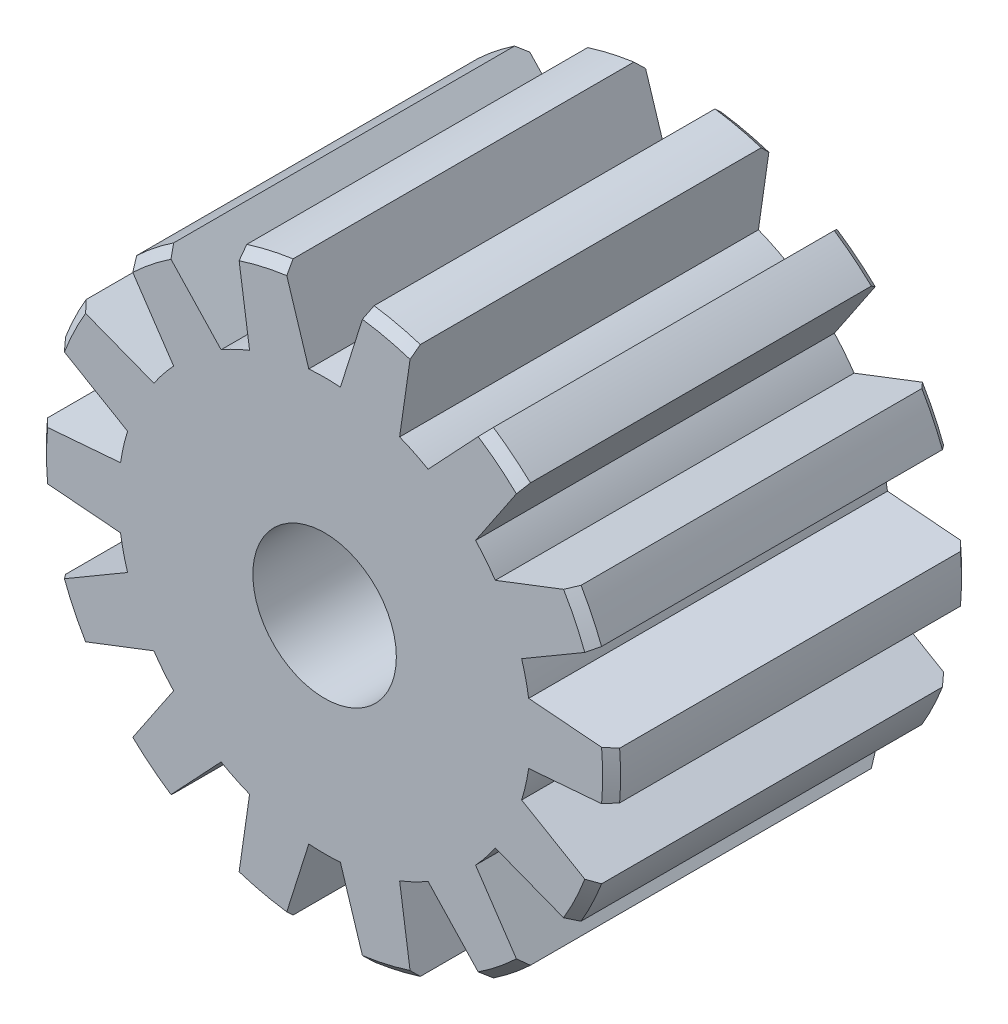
ISO-10303-21;
HEADER;
FILE_DESCRIPTION(('STEP AP214'),'2;1');
FILE_NAME('part.step','',(''),(''),'','','');
FILE_SCHEMA(('AUTOMOTIVE_DESIGN { 1 0 10303 214 1 1 1 1 }'));
ENDSEC;
DATA;
#1=APPLICATION_CONTEXT('core data for automotive mechanical design processes');
#2=APPLICATION_PROTOCOL_DEFINITION('international standard','automotive_design',2000,#1);
#3=PRODUCT_CONTEXT('',#1,'mechanical');
#4=PRODUCT('Part','Part','',(#3));
#5=PRODUCT_RELATED_PRODUCT_CATEGORY('part','',(#4));
#6=PRODUCT_DEFINITION_FORMATION('','',#4);
#7=PRODUCT_DEFINITION_CONTEXT('part definition',#1,'design');
#8=PRODUCT_DEFINITION('design','',#6,#7);
#9=PRODUCT_DEFINITION_SHAPE('','',#8);
#10=(LENGTH_UNIT() NAMED_UNIT(*) SI_UNIT(.MILLI.,.METRE.));
#11=(NAMED_UNIT(*) PLANE_ANGLE_UNIT() SI_UNIT($,.RADIAN.));
#12=(NAMED_UNIT(*) SI_UNIT($,.STERADIAN.) SOLID_ANGLE_UNIT());
#13=UNCERTAINTY_MEASURE_WITH_UNIT(LENGTH_MEASURE(1.E-05),#10,'distance_accuracy_value','');
#14=(GEOMETRIC_REPRESENTATION_CONTEXT(3) GLOBAL_UNCERTAINTY_ASSIGNED_CONTEXT((#13)) GLOBAL_UNIT_ASSIGNED_CONTEXT((#10,
#11,#12)) REPRESENTATION_CONTEXT('',''));
#15=CARTESIAN_POINT('',(0.,0.,0.));
#16=DIRECTION('',(0.,0.,1.));
#17=DIRECTION('',(1.,0.,0.));
#18=AXIS2_PLACEMENT_3D('',#15,#16,#17);
#19=CARTESIAN_POINT('',(0.,0.,2.5));
#20=DIRECTION('',(0.,0.,-1.));
#21=DIRECTION('',(-1.,0.,0.));
#22=AXIS2_PLACEMENT_3D('',#19,#20,#21);
#23=CYLINDRICAL_SURFACE('',#22,4.);
#24=CARTESIAN_POINT('',(0.,0.,2.375));
#25=DIRECTION('',(0.,0.,1.));
#26=DIRECTION('',(1.,0.,0.));
#27=AXIS2_PLACEMENT_3D('',#24,#25,#26);
#28=CIRCLE('',#27,4.);
#29=CARTESIAN_POINT('',(-2.74365282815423,2.9107334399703,2.375));
#30=VERTEX_POINT('',#29);
#31=CARTESIAN_POINT('',(-2.22723508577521,3.32256284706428,2.375));
#32=VERTEX_POINT('',#31);
#33=EDGE_CURVE('E2024',#30,#32,#28,.F.);
#34=ORIENTED_EDGE('',*,*,#33,.T.);
#35=DIRECTION('',(0.,0.,1.));
#36=VECTOR('',#35,1.);
#37=CARTESIAN_POINT('',(-2.22723508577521,3.32256284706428,-2.5));
#38=LINE('',#37,#36);
#39=CARTESIAN_POINT('',(-2.22723508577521,3.32256284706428,-2.375));
#40=VERTEX_POINT('',#39);
#41=EDGE_CURVE('E595',#40,#32,#38,.T.);
#42=ORIENTED_EDGE('',*,*,#41,.F.);
#43=CARTESIAN_POINT('',(0.,0.,-2.375));
#44=DIRECTION('',(0.,0.,1.));
#45=DIRECTION('',(1.,0.,0.));
#46=AXIS2_PLACEMENT_3D('',#43,#44,#45);
#47=CIRCLE('',#46,4.);
#48=CARTESIAN_POINT('',(-2.74365282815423,2.9107334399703,-2.375));
#49=VERTEX_POINT('',#48);
#50=EDGE_CURVE('E59',#40,#49,#47,.T.);
#51=ORIENTED_EDGE('',*,*,#50,.T.);
#52=DIRECTION('',(0.,0.,1.));
#53=VECTOR('',#52,1.);
#54=CARTESIAN_POINT('',(-2.74365282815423,2.9107334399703,-2.5));
#55=LINE('',#54,#53);
#56=EDGE_CURVE('E2026',#49,#30,#55,.T.);
#57=ORIENTED_EDGE('',*,*,#56,.T.);
#58=EDGE_LOOP('',(#34,#42,#51,#57));
#59=FACE_BOUND('',#58,.T.);
#60=ADVANCED_FACE('F31',(#59),#23,.T.);
#61=CARTESIAN_POINT('',(0.,0.,2.5));
#62=DIRECTION('',(0.,0.,-1.));
#63=DIRECTION('',(-1.,0.,0.));
#64=AXIS2_PLACEMENT_3D('',#61,#62,#63);
#65=CONICAL_SURFACE('',#64,3.875,0.785398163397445);
#66=CARTESIAN_POINT('',(-2.22737388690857,3.32271058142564,2.3748));
#67=CARTESIAN_POINT('',(-2.21286598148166,3.30726894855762,2.39570475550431));
#68=CARTESIAN_POINT('',(-2.19835647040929,3.29182560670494,2.41660713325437));
#69=CARTESIAN_POINT('',(-2.16933423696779,3.26093550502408,2.45840713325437));
#70=CARTESIAN_POINT('',(-2.15482151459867,3.24548874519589,2.47930475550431));
#71=CARTESIAN_POINT('',(-2.14030718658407,3.23004027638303,2.5002));
#72=B_SPLINE_CURVE_WITH_KNOTS('',3,(#66,#67,#68,#69,#70,#71),.UNSPECIFIED.,.F.,.F.,(4,2,4),(0.,
0.0892938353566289,0.178587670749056),.UNSPECIFIED.);
#73=CARTESIAN_POINT('',(-2.14044611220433,3.23018814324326,2.5));
#74=VERTEX_POINT('',#73);
#75=EDGE_CURVE('E604',#32,#74,#72,.T.);
#76=ORIENTED_EDGE('',*,*,#75,.F.);
#77=ORIENTED_EDGE('',*,*,#33,.F.);
#78=CARTESIAN_POINT('',(-2.67279326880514,2.80539679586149,2.5002));
#79=CARTESIAN_POINT('',(-2.68462467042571,2.82298482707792,2.47930475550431));
#80=CARTESIAN_POINT('',(-2.69645476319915,2.84057091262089,2.45840713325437));
#81=CARTESIAN_POINT('',(-2.72011233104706,2.87573919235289,2.41660713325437));
#82=CARTESIAN_POINT('',(-2.73193980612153,2.89332138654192,2.39570475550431));
#83=CARTESIAN_POINT('',(-2.74376597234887,2.9109016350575,2.3748));
#84=B_SPLINE_CURVE_WITH_KNOTS('',3,(#78,#79,#80,#81,#82,#83),.UNSPECIFIED.,.F.,.F.,(4,2,4),(0.,
0.0892938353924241,0.178587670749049),.UNSPECIFIED.);
#85=CARTESIAN_POINT('',(-2.6729065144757,2.80556514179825,2.5));
#86=VERTEX_POINT('',#85);
#87=EDGE_CURVE('E825',#86,#30,#84,.T.);
#88=ORIENTED_EDGE('',*,*,#87,.F.);
#89=CARTESIAN_POINT('',(0.,0.,2.5));
#90=DIRECTION('',(0.,0.,1.));
#91=DIRECTION('',(1.,0.,0.));
#92=AXIS2_PLACEMENT_3D('',#89,#90,#91);
#93=CIRCLE('',#92,3.875);
#94=EDGE_CURVE('E1254',#74,#86,#93,.T.);
#95=ORIENTED_EDGE('',*,*,#94,.F.);
#96=EDGE_LOOP('',(#76,#77,#88,#95));
#97=FACE_BOUND('',#96,.T.);
#98=ADVANCED_FACE('F1437',(#97),#65,.T.);
#99=CARTESIAN_POINT('',(0.,0.,-2.375));
#100=DIRECTION('',(0.,0.,1.));
#101=DIRECTION('',(1.,0.,0.));
#102=AXIS2_PLACEMENT_3D('',#99,#100,#101);
#103=CONICAL_SURFACE('',#102,4.,0.785398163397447);
#104=CARTESIAN_POINT('',(-2.14030718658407,3.23004027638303,-2.5002));
#105=CARTESIAN_POINT('',(-2.15482151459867,3.24548874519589,-2.47930475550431));
#106=CARTESIAN_POINT('',(-2.16933423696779,3.26093550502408,-2.45840713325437));
#107=CARTESIAN_POINT('',(-2.19835647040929,3.29182560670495,-2.41660713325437));
#108=CARTESIAN_POINT('',(-2.21286598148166,3.30726894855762,-2.39570475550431));
#109=CARTESIAN_POINT('',(-2.22737388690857,3.32271058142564,-2.3748));
#110=B_SPLINE_CURVE_WITH_KNOTS('',3,(#104,#105,#106,#107,#108,#109),.UNSPECIFIED.,.F.,.F.,(4,2,
4),(0.,0.0892938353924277,0.178587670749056),.UNSPECIFIED.);
#111=CARTESIAN_POINT('',(-2.14044611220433,3.23018814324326,-2.5));
#112=VERTEX_POINT('',#111);
#113=EDGE_CURVE('E11',#112,#40,#110,.T.);
#114=ORIENTED_EDGE('',*,*,#113,.F.);
#115=CARTESIAN_POINT('',(0.,0.,-2.5));
#116=DIRECTION('',(0.,0.,1.));
#117=DIRECTION('',(1.,0.,0.));
#118=AXIS2_PLACEMENT_3D('',#115,#116,#117);
#119=CIRCLE('',#118,3.875);
#120=CARTESIAN_POINT('',(-2.6729065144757,2.80556514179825,-2.5));
#121=VERTEX_POINT('',#120);
#122=EDGE_CURVE('E1271',#121,#112,#119,.F.);
#123=ORIENTED_EDGE('',*,*,#122,.F.);
#124=CARTESIAN_POINT('',(-2.74376597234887,2.9109016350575,-2.3748));
#125=CARTESIAN_POINT('',(-2.73193980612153,2.89332138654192,-2.39570475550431));
#126=CARTESIAN_POINT('',(-2.72011233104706,2.87573919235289,-2.41660713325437));
#127=CARTESIAN_POINT('',(-2.69645476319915,2.84057091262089,-2.45840713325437));
#128=CARTESIAN_POINT('',(-2.68462467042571,2.82298482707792,-2.47930475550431));
#129=CARTESIAN_POINT('',(-2.67279326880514,2.80539679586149,-2.5002));
#130=B_SPLINE_CURVE_WITH_KNOTS('',3,(#124,#125,#126,#127,#128,#129),.UNSPECIFIED.,.F.,.F.,(4,2,
4),(0.,0.0892938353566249,0.178587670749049),.UNSPECIFIED.);
#131=EDGE_CURVE('E810',#49,#121,#130,.T.);
#132=ORIENTED_EDGE('',*,*,#131,.F.);
#133=ORIENTED_EDGE('',*,*,#50,.F.);
#134=EDGE_LOOP('',(#114,#123,#132,#133));
#135=FACE_BOUND('',#134,.T.);
#136=ADVANCED_FACE('F636',(#135),#103,.T.);
#137=CARTESIAN_POINT('',(-3.73486569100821,1.43205386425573,2.375));
#138=VERTEX_POINT('',#137);
#139=CARTESIAN_POINT('',(-3.44827546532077,2.02716459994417,2.375));
#140=VERTEX_POINT('',#139);
#141=EDGE_CURVE('E2022',#138,#140,#28,.F.);
#142=ORIENTED_EDGE('',*,*,#141,.T.);
#143=DIRECTION('',(0.,0.,1.));
#144=VECTOR('',#143,1.);
#145=CARTESIAN_POINT('',(-3.44827546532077,2.02716459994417,-2.5));
#146=LINE('',#145,#144);
#147=CARTESIAN_POINT('',(-3.44827546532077,2.02716459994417,-2.375));
#148=VERTEX_POINT('',#147);
#149=EDGE_CURVE('E1922',#148,#140,#146,.T.);
#150=ORIENTED_EDGE('',*,*,#149,.F.);
#151=CARTESIAN_POINT('',(-3.73486569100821,1.43205386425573,-2.375));
#152=VERTEX_POINT('',#151);
#153=EDGE_CURVE('E1358',#148,#152,#47,.T.);
#154=ORIENTED_EDGE('',*,*,#153,.T.);
#155=DIRECTION('',(0.,0.,1.));
#156=VECTOR('',#155,1.);
#157=CARTESIAN_POINT('',(-3.73486569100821,1.43205386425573,-2.5));
#158=LINE('',#157,#156);
#159=EDGE_CURVE('E863',#152,#138,#158,.T.);
#160=ORIENTED_EDGE('',*,*,#159,.T.);
#161=EDGE_LOOP('',(#142,#150,#154,#160));
#162=FACE_BOUND('',#161,.T.);
#163=ADVANCED_FACE('F1438',(#162),#23,.T.);
#164=CARTESIAN_POINT('',(-3.44846462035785,2.02723748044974,2.3748));
#165=CARTESIAN_POINT('',(-3.42869357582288,2.01961979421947,2.39570475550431));
#166=CARTESIAN_POINT('',(-3.40892034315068,2.01200126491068,2.41660713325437));
#167=CARTESIAN_POINT('',(-3.36936950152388,1.99676252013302,2.45840713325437));
#168=CARTESIAN_POINT('',(-3.34959189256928,1.98914230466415,2.47930475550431));
#169=CARTESIAN_POINT('',(-3.32981209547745,1.98152124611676,2.5002));
#170=B_SPLINE_CURVE_WITH_KNOTS('',3,(#164,#165,#166,#167,#168,#169),.UNSPECIFIED.,.F.,.F.,(4,2,
4),(0.,0.0892938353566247,0.178587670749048),.UNSPECIFIED.);
#171=CARTESIAN_POINT('',(-3.33000142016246,1.98159419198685,2.5));
#172=VERTEX_POINT('',#171);
#173=EDGE_CURVE('E831',#140,#172,#170,.T.);
#174=ORIENTED_EDGE('',*,*,#173,.F.);
#175=ORIENTED_EDGE('',*,*,#141,.F.);
#176=CARTESIAN_POINT('',(-3.62531957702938,1.36789363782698,2.5002));
#177=CARTESIAN_POINT('',(-3.64361046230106,1.37860645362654,2.47930475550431));
#178=CARTESIAN_POINT('',(-3.66189932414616,1.38931808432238,2.45840713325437));
#179=CARTESIAN_POINT('',(-3.69847300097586,1.41073897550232,2.41660713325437));
#180=CARTESIAN_POINT('',(-3.71675781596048,1.42144823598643,2.39570475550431));
#181=CARTESIAN_POINT('',(-3.73504060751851,1.43215631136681,2.3748));
#182=B_SPLINE_CURVE_WITH_KNOTS('',3,(#176,#177,#178,#179,#180,#181),.UNSPECIFIED.,.F.,.F.,(4,2,
4),(0.,0.0892938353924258,0.178587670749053),.UNSPECIFIED.);
#183=CARTESIAN_POINT('',(-3.62549465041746,1.36799617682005,2.5));
#184=VERTEX_POINT('',#183);
#185=EDGE_CURVE('E860',#184,#138,#182,.T.);
#186=ORIENTED_EDGE('',*,*,#185,.F.);
#187=EDGE_CURVE('E1927',#172,#184,#93,.T.);
#188=ORIENTED_EDGE('',*,*,#187,.F.);
#189=EDGE_LOOP('',(#174,#175,#186,#188));
#190=FACE_BOUND('',#189,.T.);
#191=ADVANCED_FACE('F1443',(#190),#65,.T.);
#192=CARTESIAN_POINT('',(-3.32981209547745,1.98152124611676,-2.5002));
#193=CARTESIAN_POINT('',(-3.34959189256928,1.98914230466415,-2.47930475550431));
#194=CARTESIAN_POINT('',(-3.36936950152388,1.99676252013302,-2.45840713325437));
#195=CARTESIAN_POINT('',(-3.40892034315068,2.01200126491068,-2.41660713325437));
#196=CARTESIAN_POINT('',(-3.42869357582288,2.01961979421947,-2.39570475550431));
#197=CARTESIAN_POINT('',(-3.44846462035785,2.02723748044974,-2.3748));
#198=B_SPLINE_CURVE_WITH_KNOTS('',3,(#192,#193,#194,#195,#196,#197),.UNSPECIFIED.,.F.,.F.,(4,2,
4),(0.,0.0892938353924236,0.178587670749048),.UNSPECIFIED.);
#199=CARTESIAN_POINT('',(-3.33000142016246,1.98159419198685,-2.5));
#200=VERTEX_POINT('',#199);
#201=EDGE_CURVE('E625',#200,#148,#198,.T.);
#202=ORIENTED_EDGE('',*,*,#201,.F.);
#203=CARTESIAN_POINT('',(-3.62549465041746,1.36799617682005,-2.5));
#204=VERTEX_POINT('',#203);
#205=EDGE_CURVE('E1276',#204,#200,#119,.F.);
#206=ORIENTED_EDGE('',*,*,#205,.F.);
#207=CARTESIAN_POINT('',(-3.73504060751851,1.43215631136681,-2.3748));
#208=CARTESIAN_POINT('',(-3.71675781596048,1.42144823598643,-2.39570475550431));
#209=CARTESIAN_POINT('',(-3.69847300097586,1.41073897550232,-2.41660713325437));
#210=CARTESIAN_POINT('',(-3.66189932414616,1.38931808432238,-2.45840713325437));
#211=CARTESIAN_POINT('',(-3.64361046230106,1.37860645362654,-2.47930475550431));
#212=CARTESIAN_POINT('',(-3.62531957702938,1.36789363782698,-2.5002));
#213=B_SPLINE_CURVE_WITH_KNOTS('',3,(#207,#208,#209,#210,#211,#212),.UNSPECIFIED.,.F.,.F.,(4,2,
4),(0.,0.089293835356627,0.178587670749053),.UNSPECIFIED.);
#214=EDGE_CURVE('E797',#152,#204,#213,.T.);
#215=ORIENTED_EDGE('',*,*,#214,.F.);
#216=ORIENTED_EDGE('',*,*,#153,.F.);
#217=EDGE_LOOP('',(#202,#206,#215,#216));
#218=FACE_BOUND('',#217,.T.);
#219=ADVANCED_FACE('F1451',(#218),#103,.T.);
#220=CARTESIAN_POINT('',(-3.98634259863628,-0.330261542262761,2.375));
#221=VERTEX_POINT('',#220);
#222=CARTESIAN_POINT('',(-3.98634259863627,0.330261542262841,2.375));
#223=VERTEX_POINT('',#222);
#224=EDGE_CURVE('E2020',#221,#223,#28,.F.);
#225=ORIENTED_EDGE('',*,*,#224,.T.);
#226=DIRECTION('',(0.,0.,1.));
#227=VECTOR('',#226,1.);
#228=CARTESIAN_POINT('',(-3.98634259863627,0.330261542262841,-2.5));
#229=LINE('',#228,#227);
#230=CARTESIAN_POINT('',(-3.98634259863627,0.330261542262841,-2.375));
#231=VERTEX_POINT('',#230);
#232=EDGE_CURVE('E861',#231,#223,#229,.T.);
#233=ORIENTED_EDGE('',*,*,#232,.F.);
#234=CARTESIAN_POINT('',(-3.98634259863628,-0.330261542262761,-2.375));
#235=VERTEX_POINT('',#234);
#236=EDGE_CURVE('E1359',#231,#235,#47,.T.);
#237=ORIENTED_EDGE('',*,*,#236,.T.);
#238=DIRECTION('',(0.,0.,1.));
#239=VECTOR('',#238,1.);
#240=CARTESIAN_POINT('',(-3.98634259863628,-0.330261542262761,-2.5));
#241=LINE('',#240,#239);
#242=EDGE_CURVE('E2203',#235,#221,#241,.T.);
#243=ORIENTED_EDGE('',*,*,#242,.T.);
#244=EDGE_LOOP('',(#225,#233,#237,#243));
#245=FACE_BOUND('',#244,.T.);
#246=ADVANCED_FACE('F1446',(#245),#23,.T.);
#247=CARTESIAN_POINT('',(-3.98654259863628,0.330245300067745,2.37480202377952));
#248=CARTESIAN_POINT('',(-3.96542465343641,0.331960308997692,2.39570644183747));
#249=CARTESIAN_POINT('',(-3.94430437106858,0.333675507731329,2.41660848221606));
#250=CARTESIAN_POINT('',(-3.90205913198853,0.337106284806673,2.45840780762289));
#251=CARTESIAN_POINT('',(-3.88093417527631,0.338821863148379,2.47930509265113));
#252=CARTESIAN_POINT('',(-3.85980688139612,0.340537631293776,2.5002));
#253=B_SPLINE_CURVE_WITH_KNOTS('',3,(#247,#248,#249,#250,#251,#252),.UNSPECIFIED.,.F.,.F.,(4,2,
4),(0.,0.0892923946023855,0.178584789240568),.UNSPECIFIED.);
#254=CARTESIAN_POINT('',(-3.86000910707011,0.340521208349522,2.5));
#255=VERTEX_POINT('',#254);
#256=EDGE_CURVE('E871',#223,#255,#253,.T.);
#257=ORIENTED_EDGE('',*,*,#256,.F.);
#258=ORIENTED_EDGE('',*,*,#224,.F.);
#259=CARTESIAN_POINT('',(-3.85980688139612,-0.340537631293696,2.5002));
#260=CARTESIAN_POINT('',(-3.88093417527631,-0.338821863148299,2.47930509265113));
#261=CARTESIAN_POINT('',(-3.90205913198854,-0.337106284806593,2.4584078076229));
#262=CARTESIAN_POINT('',(-3.94430437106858,-0.333675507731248,2.41660848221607));
#263=CARTESIAN_POINT('',(-3.96542465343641,-0.33196030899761,2.39570644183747));
#264=CARTESIAN_POINT('',(-3.98654259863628,-0.330245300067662,2.37480202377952));
#265=B_SPLINE_CURVE_WITH_KNOTS('',3,(#259,#260,#261,#262,#263,#264),.UNSPECIFIED.,.F.,.F.,(4,2,
4),(0.,0.0892923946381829,0.178584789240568),.UNSPECIFIED.);
#266=CARTESIAN_POINT('',(-3.86000910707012,-0.340521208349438,2.5));
#267=VERTEX_POINT('',#266);
#268=EDGE_CURVE('E904',#267,#221,#265,.T.);
#269=ORIENTED_EDGE('',*,*,#268,.F.);
#270=EDGE_CURVE('E1935',#255,#267,#93,.T.);
#271=ORIENTED_EDGE('',*,*,#270,.F.);
#272=EDGE_LOOP('',(#257,#258,#269,#271));
#273=FACE_BOUND('',#272,.T.);
#274=ADVANCED_FACE('F1453',(#273),#65,.T.);
#275=CARTESIAN_POINT('',(-3.85980688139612,0.340537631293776,-2.5002));
#276=CARTESIAN_POINT('',(-3.88093417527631,0.338821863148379,-2.47930509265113));
#277=CARTESIAN_POINT('',(-3.90205913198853,0.337106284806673,-2.45840780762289));
#278=CARTESIAN_POINT('',(-3.94430437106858,0.333675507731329,-2.41660848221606));
#279=CARTESIAN_POINT('',(-3.96542465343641,0.331960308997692,-2.39570644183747));
#280=CARTESIAN_POINT('',(-3.98654259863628,0.330245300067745,-2.37480202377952));
#281=B_SPLINE_CURVE_WITH_KNOTS('',3,(#275,#276,#277,#278,#279,#280),.UNSPECIFIED.,.F.,.F.,(4,2,
4),(0.,0.0892923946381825,0.178584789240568),.UNSPECIFIED.);
#282=CARTESIAN_POINT('',(-3.86000910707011,0.340521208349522,-2.5));
#283=VERTEX_POINT('',#282);
#284=EDGE_CURVE('E804',#283,#231,#281,.T.);
#285=ORIENTED_EDGE('',*,*,#284,.F.);
#286=CARTESIAN_POINT('',(-3.86000910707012,-0.340521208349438,-2.5));
#287=VERTEX_POINT('',#286);
#288=EDGE_CURVE('E1280',#287,#283,#119,.F.);
#289=ORIENTED_EDGE('',*,*,#288,.F.);
#290=CARTESIAN_POINT('',(-3.98654259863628,-0.330245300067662,-2.37480202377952));
#291=CARTESIAN_POINT('',(-3.96542465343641,-0.33196030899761,-2.39570644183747));
#292=CARTESIAN_POINT('',(-3.94430437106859,-0.333675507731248,-2.41660848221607));
#293=CARTESIAN_POINT('',(-3.90205913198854,-0.337106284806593,-2.4584078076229));
#294=CARTESIAN_POINT('',(-3.88093417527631,-0.338821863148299,-2.47930509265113));
#295=CARTESIAN_POINT('',(-3.85980688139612,-0.340537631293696,-2.5002));
#296=B_SPLINE_CURVE_WITH_KNOTS('',3,(#290,#291,#292,#293,#294,#295),.UNSPECIFIED.,.F.,.F.,(4,2,
4),(0.,0.089292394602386,0.178584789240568),.UNSPECIFIED.);
#297=EDGE_CURVE('E783',#235,#287,#296,.T.);
#298=ORIENTED_EDGE('',*,*,#297,.F.);
#299=ORIENTED_EDGE('',*,*,#236,.F.);
#300=EDGE_LOOP('',(#285,#289,#298,#299));
#301=FACE_BOUND('',#300,.T.);
#302=ADVANCED_FACE('F1461',(#301),#103,.T.);
#303=CARTESIAN_POINT('',(-3.44827546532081,-2.0271645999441,2.375));
#304=VERTEX_POINT('',#303);
#305=CARTESIAN_POINT('',(-3.73486569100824,-1.43205386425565,2.375));
#306=VERTEX_POINT('',#305);
#307=EDGE_CURVE('E2018',#304,#306,#28,.F.);
#308=ORIENTED_EDGE('',*,*,#307,.T.);
#309=DIRECTION('',(0.,0.,1.));
#310=VECTOR('',#309,1.);
#311=CARTESIAN_POINT('',(-3.73486569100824,-1.43205386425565,-2.5));
#312=LINE('',#311,#310);
#313=CARTESIAN_POINT('',(-3.73486569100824,-1.43205386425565,-2.375));
#314=VERTEX_POINT('',#313);
#315=EDGE_CURVE('E2184',#314,#306,#312,.T.);
#316=ORIENTED_EDGE('',*,*,#315,.F.);
#317=CARTESIAN_POINT('',(-3.44827546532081,-2.0271645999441,-2.375));
#318=VERTEX_POINT('',#317);
#319=EDGE_CURVE('E1364',#314,#318,#47,.T.);
#320=ORIENTED_EDGE('',*,*,#319,.T.);
#321=DIRECTION('',(0.,0.,1.));
#322=VECTOR('',#321,1.);
#323=CARTESIAN_POINT('',(-3.44827546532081,-2.0271645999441,-2.5));
#324=LINE('',#323,#322);
#325=EDGE_CURVE('E932',#318,#304,#324,.T.);
#326=ORIENTED_EDGE('',*,*,#325,.T.);
#327=EDGE_LOOP('',(#308,#316,#320,#326));
#328=FACE_BOUND('',#327,.T.);
#329=ADVANCED_FACE('F1456',(#328),#23,.T.);
#330=CARTESIAN_POINT('',(-3.73504060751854,-1.43215631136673,2.3748));
#331=CARTESIAN_POINT('',(-3.7167578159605,-1.42144823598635,2.39570475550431));
#332=CARTESIAN_POINT('',(-3.69847300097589,-1.41073897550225,2.41660713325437));
#333=CARTESIAN_POINT('',(-3.66189932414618,-1.38931808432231,2.45840713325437));
#334=CARTESIAN_POINT('',(-3.64361046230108,-1.37860645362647,2.47930475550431));
#335=CARTESIAN_POINT('',(-3.62531957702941,-1.36789363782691,2.5002));
#336=B_SPLINE_CURVE_WITH_KNOTS('',3,(#330,#331,#332,#333,#334,#335),.UNSPECIFIED.,.F.,.F.,(4,2,
4),(0.,0.0892938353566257,0.17858767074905),.UNSPECIFIED.);
#337=CARTESIAN_POINT('',(-3.6254946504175,-1.36799617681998,2.5));
#338=VERTEX_POINT('',#337);
#339=EDGE_CURVE('E897',#306,#338,#336,.T.);
#340=ORIENTED_EDGE('',*,*,#339,.F.);
#341=ORIENTED_EDGE('',*,*,#307,.F.);
#342=CARTESIAN_POINT('',(-3.32981209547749,-1.98152124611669,2.5002));
#343=CARTESIAN_POINT('',(-3.34959189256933,-1.98914230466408,2.47930475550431));
#344=CARTESIAN_POINT('',(-3.36936950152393,-1.99676252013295,2.45840713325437));
#345=CARTESIAN_POINT('',(-3.40892034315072,-2.01200126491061,2.41660713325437));
#346=CARTESIAN_POINT('',(-3.42869357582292,-2.0196197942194,2.39570475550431));
#347=CARTESIAN_POINT('',(-3.44846462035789,-2.02723748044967,2.3748));
#348=B_SPLINE_CURVE_WITH_KNOTS('',3,(#342,#343,#344,#345,#346,#347),.UNSPECIFIED.,.F.,.F.,(4,2,
4),(0.,0.0892938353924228,0.178587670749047),.UNSPECIFIED.);
#349=CARTESIAN_POINT('',(-3.3300014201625,-1.98159419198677,2.5));
#350=VERTEX_POINT('',#349);
#351=EDGE_CURVE('E929',#350,#304,#348,.T.);
#352=ORIENTED_EDGE('',*,*,#351,.F.);
#353=EDGE_CURVE('E1936',#338,#350,#93,.T.);
#354=ORIENTED_EDGE('',*,*,#353,.F.);
#355=EDGE_LOOP('',(#340,#341,#352,#354));
#356=FACE_BOUND('',#355,.T.);
#357=ADVANCED_FACE('F1463',(#356),#65,.T.);
#358=CARTESIAN_POINT('',(-3.62531957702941,-1.36789363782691,-2.5002));
#359=CARTESIAN_POINT('',(-3.64361046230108,-1.37860645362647,-2.47930475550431));
#360=CARTESIAN_POINT('',(-3.66189932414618,-1.38931808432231,-2.45840713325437));
#361=CARTESIAN_POINT('',(-3.69847300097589,-1.41073897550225,-2.41660713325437));
#362=CARTESIAN_POINT('',(-3.7167578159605,-1.42144823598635,-2.39570475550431));
#363=CARTESIAN_POINT('',(-3.73504060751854,-1.43215631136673,-2.3748));
#364=B_SPLINE_CURVE_WITH_KNOTS('',3,(#358,#359,#360,#361,#362,#363),.UNSPECIFIED.,.F.,.F.,(4,2,
4),(0.,0.0892938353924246,0.17858767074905),.UNSPECIFIED.);
#365=CARTESIAN_POINT('',(-3.6254946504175,-1.36799617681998,-2.5));
#366=VERTEX_POINT('',#365);
#367=EDGE_CURVE('E790',#366,#314,#364,.T.);
#368=ORIENTED_EDGE('',*,*,#367,.F.);
#369=CARTESIAN_POINT('',(-3.3300014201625,-1.98159419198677,-2.5));
#370=VERTEX_POINT('',#369);
#371=EDGE_CURVE('E1284',#370,#366,#119,.F.);
#372=ORIENTED_EDGE('',*,*,#371,.F.);
#373=CARTESIAN_POINT('',(-3.44846462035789,-2.02723748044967,-2.3748));
#374=CARTESIAN_POINT('',(-3.42869357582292,-2.0196197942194,-2.39570475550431));
#375=CARTESIAN_POINT('',(-3.40892034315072,-2.01200126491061,-2.41660713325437));
#376=CARTESIAN_POINT('',(-3.36936950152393,-1.99676252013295,-2.45840713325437));
#377=CARTESIAN_POINT('',(-3.34959189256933,-1.98914230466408,-2.47930475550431));
#378=CARTESIAN_POINT('',(-3.32981209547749,-1.98152124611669,-2.5002));
#379=B_SPLINE_CURVE_WITH_KNOTS('',3,(#373,#374,#375,#376,#377,#378),.UNSPECIFIED.,.F.,.F.,(4,2,
4),(0.,0.0892938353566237,0.178587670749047),.UNSPECIFIED.);
#380=EDGE_CURVE('E769',#318,#370,#379,.T.);
#381=ORIENTED_EDGE('',*,*,#380,.F.);
#382=ORIENTED_EDGE('',*,*,#319,.F.);
#383=EDGE_LOOP('',(#368,#372,#381,#382));
#384=FACE_BOUND('',#383,.T.);
#385=ADVANCED_FACE('F1472',(#384),#103,.T.);
#386=CARTESIAN_POINT('',(-2.22723508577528,-3.32256284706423,2.375));
#387=VERTEX_POINT('',#386);
#388=CARTESIAN_POINT('',(-2.74365282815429,-2.91073343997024,2.375));
#389=VERTEX_POINT('',#388);
#390=EDGE_CURVE('E2016',#387,#389,#28,.F.);
#391=ORIENTED_EDGE('',*,*,#390,.T.);
#392=DIRECTION('',(0.,0.,1.));
#393=VECTOR('',#392,1.);
#394=CARTESIAN_POINT('',(-2.74365282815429,-2.91073343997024,-2.5));
#395=LINE('',#394,#393);
#396=CARTESIAN_POINT('',(-2.74365282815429,-2.91073343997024,-2.375));
#397=VERTEX_POINT('',#396);
#398=EDGE_CURVE('E930',#397,#389,#395,.T.);
#399=ORIENTED_EDGE('',*,*,#398,.F.);
#400=CARTESIAN_POINT('',(-2.22723508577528,-3.32256284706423,-2.375));
#401=VERTEX_POINT('',#400);
#402=EDGE_CURVE('E1370',#397,#401,#47,.T.);
#403=ORIENTED_EDGE('',*,*,#402,.T.);
#404=DIRECTION('',(0.,0.,1.));
#405=VECTOR('',#404,1.);
#406=CARTESIAN_POINT('',(-2.22723508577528,-3.32256284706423,-2.5));
#407=LINE('',#406,#405);
#408=EDGE_CURVE('E2174',#401,#387,#407,.T.);
#409=ORIENTED_EDGE('',*,*,#408,.T.);
#410=EDGE_LOOP('',(#391,#399,#403,#409));
#411=FACE_BOUND('',#410,.T.);
#412=ADVANCED_FACE('F1467',(#411),#23,.T.);
#413=CARTESIAN_POINT('',(-2.74376597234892,-2.91090163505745,2.3748));
#414=CARTESIAN_POINT('',(-2.73193980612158,-2.89332138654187,2.39570475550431));
#415=CARTESIAN_POINT('',(-2.72011233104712,-2.87573919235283,2.41660713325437));
#416=CARTESIAN_POINT('',(-2.69645476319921,-2.84057091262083,2.45840713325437));
#417=CARTESIAN_POINT('',(-2.68462467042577,-2.82298482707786,2.47930475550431));
#418=CARTESIAN_POINT('',(-2.6727932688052,-2.80539679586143,2.5002));
#419=B_SPLINE_CURVE_WITH_KNOTS('',3,(#413,#414,#415,#416,#417,#418),.UNSPECIFIED.,.F.,.F.,(4,2,
4),(0.,0.0892938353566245,0.178587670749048),.UNSPECIFIED.);
#420=CARTESIAN_POINT('',(-2.67290651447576,-2.80556514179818,2.5));
#421=VERTEX_POINT('',#420);
#422=EDGE_CURVE('E940',#389,#421,#419,.T.);
#423=ORIENTED_EDGE('',*,*,#422,.F.);
#424=ORIENTED_EDGE('',*,*,#390,.F.);
#425=CARTESIAN_POINT('',(-2.14030718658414,-3.23004027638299,2.5002));
#426=CARTESIAN_POINT('',(-2.15482151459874,-3.24548874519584,2.47930475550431));
#427=CARTESIAN_POINT('',(-2.16933423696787,-3.26093550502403,2.45840713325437));
#428=CARTESIAN_POINT('',(-2.19835647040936,-3.2918256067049,2.41660713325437));
#429=CARTESIAN_POINT('',(-2.21286598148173,-3.30726894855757,2.39570475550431));
#430=CARTESIAN_POINT('',(-2.22737388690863,-3.32271058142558,2.3748));
#431=B_SPLINE_CURVE_WITH_KNOTS('',3,(#425,#426,#427,#428,#429,#430),.UNSPECIFIED.,.F.,.F.,(4,2,
4),(0.,0.0892938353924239,0.178587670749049),.UNSPECIFIED.);
#432=CARTESIAN_POINT('',(-2.1404461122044,-3.23018814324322,2.5));
#433=VERTEX_POINT('',#432);
#434=EDGE_CURVE('E973',#433,#387,#431,.T.);
#435=ORIENTED_EDGE('',*,*,#434,.F.);
#436=EDGE_CURVE('E1941',#421,#433,#93,.T.);
#437=ORIENTED_EDGE('',*,*,#436,.F.);
#438=EDGE_LOOP('',(#423,#424,#435,#437));
#439=FACE_BOUND('',#438,.T.);
#440=ADVANCED_FACE('F1474',(#439),#65,.T.);
#441=CARTESIAN_POINT('',(-2.6727932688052,-2.80539679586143,-2.5002));
#442=CARTESIAN_POINT('',(-2.68462467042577,-2.82298482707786,-2.47930475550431));
#443=CARTESIAN_POINT('',(-2.69645476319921,-2.84057091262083,-2.45840713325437));
#444=CARTESIAN_POINT('',(-2.72011233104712,-2.87573919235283,-2.41660713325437));
#445=CARTESIAN_POINT('',(-2.73193980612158,-2.89332138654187,-2.39570475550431));
#446=CARTESIAN_POINT('',(-2.74376597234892,-2.91090163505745,-2.3748));
#447=B_SPLINE_CURVE_WITH_KNOTS('',3,(#441,#442,#443,#444,#445,#446),.UNSPECIFIED.,.F.,.F.,(4,2,
4),(0.,0.0892938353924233,0.178587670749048),.UNSPECIFIED.);
#448=CARTESIAN_POINT('',(-2.67290651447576,-2.80556514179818,-2.5));
#449=VERTEX_POINT('',#448);
#450=EDGE_CURVE('E776',#449,#397,#447,.T.);
#451=ORIENTED_EDGE('',*,*,#450,.F.);
#452=CARTESIAN_POINT('',(-2.1404461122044,-3.23018814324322,-2.5));
#453=VERTEX_POINT('',#452);
#454=EDGE_CURVE('E1288',#453,#449,#119,.F.);
#455=ORIENTED_EDGE('',*,*,#454,.F.);
#456=CARTESIAN_POINT('',(-2.22737388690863,-3.32271058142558,-2.3748));
#457=CARTESIAN_POINT('',(-2.21286598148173,-3.30726894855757,-2.39570475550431));
#458=CARTESIAN_POINT('',(-2.19835647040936,-3.2918256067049,-2.41660713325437));
#459=CARTESIAN_POINT('',(-2.16933423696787,-3.26093550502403,-2.45840713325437));
#460=CARTESIAN_POINT('',(-2.15482151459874,-3.24548874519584,-2.47930475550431));
#461=CARTESIAN_POINT('',(-2.14030718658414,-3.23004027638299,-2.5002));
#462=B_SPLINE_CURVE_WITH_KNOTS('',3,(#456,#457,#458,#459,#460,#461),.UNSPECIFIED.,.F.,.F.,(4,2,
4),(0.,0.0892938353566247,0.178587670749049),.UNSPECIFIED.);
#463=EDGE_CURVE('E755',#401,#453,#462,.T.);
#464=ORIENTED_EDGE('',*,*,#463,.F.);
#465=ORIENTED_EDGE('',*,*,#402,.F.);
#466=EDGE_LOOP('',(#451,#455,#464,#465));
#467=FACE_BOUND('',#466,.T.);
#468=ADVANCED_FACE('F1483',(#467),#103,.T.);
#469=CARTESIAN_POINT('',(-0.565063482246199,-3.95988677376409,2.375));
#470=VERTEX_POINT('',#469);
#471=CARTESIAN_POINT('',(-1.20902587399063,-3.81290656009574,2.375));
#472=VERTEX_POINT('',#471);
#473=EDGE_CURVE('E2014',#470,#472,#28,.F.);
#474=ORIENTED_EDGE('',*,*,#473,.T.);
#475=DIRECTION('',(0.,0.,1.));
#476=VECTOR('',#475,1.);
#477=CARTESIAN_POINT('',(-1.20902587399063,-3.81290656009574,-2.5));
#478=LINE('',#477,#476);
#479=CARTESIAN_POINT('',(-1.20902587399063,-3.81290656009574,-2.375));
#480=VERTEX_POINT('',#479);
#481=EDGE_CURVE('E2155',#480,#472,#478,.T.);
#482=ORIENTED_EDGE('',*,*,#481,.F.);
#483=CARTESIAN_POINT('',(-0.565063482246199,-3.9598867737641,-2.375));
#484=VERTEX_POINT('',#483);
#485=EDGE_CURVE('E1375',#480,#484,#47,.T.);
#486=ORIENTED_EDGE('',*,*,#485,.T.);
#487=DIRECTION('',(0.,0.,1.));
#488=VECTOR('',#487,1.);
#489=CARTESIAN_POINT('',(-0.565063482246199,-3.95988677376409,-2.5));
#490=LINE('',#489,#488);
#491=EDGE_CURVE('E1001',#484,#470,#490,.T.);
#492=ORIENTED_EDGE('',*,*,#491,.T.);
#493=EDGE_LOOP('',(#474,#482,#486,#492));
#494=FACE_BOUND('',#493,.T.);
#495=ADVANCED_FACE('F1478',(#494),#23,.T.);
#496=CARTESIAN_POINT('',(-1.20905474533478,-3.81310656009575,2.37480062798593));
#497=CARTESIAN_POINT('',(-1.20602753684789,-3.79213622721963,2.39570527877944));
#498=CARTESIAN_POINT('',(-1.20299999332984,-3.77116357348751,2.41660755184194));
#499=CARTESIAN_POINT('',(-1.19694423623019,-3.72921362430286,2.4584073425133));
#500=CARTESIAN_POINT('',(-1.1939160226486,-3.70823632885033,2.47930486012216));
#501=CARTESIAN_POINT('',(-1.19088747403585,-3.68725671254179,2.5002));
#502=B_SPLINE_CURVE_WITH_KNOTS('',3,(#496,#497,#498,#499,#500,#501),.UNSPECIFIED.,.F.,.F.,(4,2,
4),(0.,0.0892933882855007,0.1785867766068),.UNSPECIFIED.);
#503=CARTESIAN_POINT('',(-1.19091646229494,-3.68745752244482,2.5));
#504=VERTEX_POINT('',#503);
#505=EDGE_CURVE('E966',#472,#504,#502,.T.);
#506=ORIENTED_EDGE('',*,*,#505,.F.);
#507=ORIENTED_EDGE('',*,*,#473,.F.);
#508=CARTESIAN_POINT('',(-0.526888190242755,-3.8388102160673,2.5002));
#509=CARTESIAN_POINT('',(-0.53326265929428,-3.85902744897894,2.4793036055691));
#510=CARTESIAN_POINT('',(-0.539636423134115,-3.87924244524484,2.45840483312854));
#511=CARTESIAN_POINT('',(-0.552382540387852,-3.9196679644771,2.41660253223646));
#512=CARTESIAN_POINT('',(-0.558754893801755,-3.93987848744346,2.39569900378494));
#513=CARTESIAN_POINT('',(-0.565126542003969,-3.96008677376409,2.37479309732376));
#514=B_SPLINE_CURVE_WITH_KNOTS('',3,(#508,#509,#510,#511,#512,#513),.UNSPECIFIED.,.F.,.F.,(4,2,
4),(0.,0.0892987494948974,0.178597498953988),.UNSPECIFIED.);
#515=CARTESIAN_POINT('',(-0.526949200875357,-3.83900371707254,2.5));
#516=VERTEX_POINT('',#515);
#517=EDGE_CURVE('E998',#516,#470,#514,.T.);
#518=ORIENTED_EDGE('',*,*,#517,.F.);
#519=EDGE_CURVE('E1945',#504,#516,#93,.T.);
#520=ORIENTED_EDGE('',*,*,#519,.F.);
#521=EDGE_LOOP('',(#506,#507,#518,#520));
#522=FACE_BOUND('',#521,.T.);
#523=ADVANCED_FACE('F1485',(#522),#65,.T.);
#524=CARTESIAN_POINT('',(-1.19088747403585,-3.68725671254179,-2.5002));
#525=CARTESIAN_POINT('',(-1.1939160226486,-3.70823632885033,-2.47930486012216));
#526=CARTESIAN_POINT('',(-1.19694423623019,-3.72921362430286,-2.4584073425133));
#527=CARTESIAN_POINT('',(-1.20299999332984,-3.77116357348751,-2.41660755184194));
#528=CARTESIAN_POINT('',(-1.20602753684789,-3.79213622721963,-2.39570527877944));
#529=CARTESIAN_POINT('',(-1.20905474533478,-3.81310656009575,-2.37480062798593));
#530=B_SPLINE_CURVE_WITH_KNOTS('',3,(#524,#525,#526,#527,#528,#529),.UNSPECIFIED.,.F.,.F.,(4,2,
4),(0.,0.0892933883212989,0.1785867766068),.UNSPECIFIED.);
#531=CARTESIAN_POINT('',(-1.19091646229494,-3.68745752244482,-2.5));
#532=VERTEX_POINT('',#531);
#533=EDGE_CURVE('E762',#532,#480,#530,.T.);
#534=ORIENTED_EDGE('',*,*,#533,.F.);
#535=CARTESIAN_POINT('',(-0.526949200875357,-3.83900371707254,-2.5));
#536=VERTEX_POINT('',#535);
#537=EDGE_CURVE('E1292',#536,#532,#119,.F.);
#538=ORIENTED_EDGE('',*,*,#537,.F.);
#539=CARTESIAN_POINT('',(-0.565126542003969,-3.96008677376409,-2.37479309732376));
#540=CARTESIAN_POINT('',(-0.558754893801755,-3.93987848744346,-2.39569900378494));
#541=CARTESIAN_POINT('',(-0.552382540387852,-3.9196679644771,-2.41660253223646));
#542=CARTESIAN_POINT('',(-0.539636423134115,-3.87924244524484,-2.45840483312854));
#543=CARTESIAN_POINT('',(-0.53326265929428,-3.85902744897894,-2.4793036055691));
#544=CARTESIAN_POINT('',(-0.526888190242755,-3.8388102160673,-2.5002));
#545=B_SPLINE_CURVE_WITH_KNOTS('',3,(#539,#540,#541,#542,#543,#544),.UNSPECIFIED.,.F.,.F.,(4,2,
4),(0.,0.0892987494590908,0.178597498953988),.UNSPECIFIED.);
#546=EDGE_CURVE('E741',#484,#536,#545,.T.);
#547=ORIENTED_EDGE('',*,*,#546,.F.);
#548=ORIENTED_EDGE('',*,*,#485,.F.);
#549=EDGE_LOOP('',(#534,#538,#547,#548));
#550=FACE_BOUND('',#549,.T.);
#551=ADVANCED_FACE('F1494',(#550),#103,.T.);
#552=CARTESIAN_POINT('',(1.20902587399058,-3.81290656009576,2.375));
#553=VERTEX_POINT('',#552);
#554=CARTESIAN_POINT('',(0.565063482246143,-3.9598867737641,2.375));
#555=VERTEX_POINT('',#554);
#556=EDGE_CURVE('E2012',#553,#555,#28,.F.);
#557=ORIENTED_EDGE('',*,*,#556,.T.);
#558=DIRECTION('',(0.,0.,1.));
#559=VECTOR('',#558,1.);
#560=CARTESIAN_POINT('',(0.565063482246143,-3.9598867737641,-2.5));
#561=LINE('',#560,#559);
#562=CARTESIAN_POINT('',(0.565063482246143,-3.9598867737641,-2.375));
#563=VERTEX_POINT('',#562);
#564=EDGE_CURVE('E999',#563,#555,#561,.T.);
#565=ORIENTED_EDGE('',*,*,#564,.F.);
#566=CARTESIAN_POINT('',(1.20902587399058,-3.81290656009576,-2.375));
#567=VERTEX_POINT('',#566);
#568=EDGE_CURVE('E1381',#563,#567,#47,.T.);
#569=ORIENTED_EDGE('',*,*,#568,.T.);
#570=DIRECTION('',(0.,0.,1.));
#571=VECTOR('',#570,1.);
#572=CARTESIAN_POINT('',(1.20902587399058,-3.81290656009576,-2.5));
#573=LINE('',#572,#571);
#574=EDGE_CURVE('E2145',#567,#553,#573,.T.);
#575=ORIENTED_EDGE('',*,*,#574,.T.);
#576=EDGE_LOOP('',(#557,#565,#569,#575));
#577=FACE_BOUND('',#576,.T.);
#578=ADVANCED_FACE('F1489',(#577),#23,.T.);
#579=CARTESIAN_POINT('',(0.565126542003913,-3.9600867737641,2.37479309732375));
#580=CARTESIAN_POINT('',(0.558754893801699,-3.93987848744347,2.39569900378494));
#581=CARTESIAN_POINT('',(0.552382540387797,-3.91966796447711,2.41660253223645));
#582=CARTESIAN_POINT('',(0.539636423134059,-3.87924244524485,2.45840483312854));
#583=CARTESIAN_POINT('',(0.533262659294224,-3.85902744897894,2.4793036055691));
#584=CARTESIAN_POINT('',(0.5268881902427,-3.83881021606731,2.5002));
#585=B_SPLINE_CURVE_WITH_KNOTS('',3,(#579,#580,#581,#582,#583,#584),.UNSPECIFIED.,.F.,.F.,(4,2,
4),(0.,0.0892987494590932,0.178597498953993),.UNSPECIFIED.);
#586=CARTESIAN_POINT('',(0.526949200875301,-3.83900371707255,2.5));
#587=VERTEX_POINT('',#586);
#588=EDGE_CURVE('E1009',#555,#587,#585,.T.);
#589=ORIENTED_EDGE('',*,*,#588,.F.);
#590=ORIENTED_EDGE('',*,*,#556,.F.);
#591=CARTESIAN_POINT('',(1.1908874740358,-3.68725671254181,2.5002));
#592=CARTESIAN_POINT('',(1.19391602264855,-3.70823632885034,2.47930486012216));
#593=CARTESIAN_POINT('',(1.19694423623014,-3.72921362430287,2.4584073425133));
#594=CARTESIAN_POINT('',(1.20299999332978,-3.77116357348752,2.41660755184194));
#595=CARTESIAN_POINT('',(1.20602753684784,-3.79213622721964,2.39570527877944));
#596=CARTESIAN_POINT('',(1.20905474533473,-3.81310656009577,2.37480062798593));
#597=B_SPLINE_CURVE_WITH_KNOTS('',3,(#591,#592,#593,#594,#595,#596),.UNSPECIFIED.,.F.,.F.,(4,2,
4),(0.,0.0892933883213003,0.178586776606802),.UNSPECIFIED.);
#598=CARTESIAN_POINT('',(1.19091646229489,-3.68745752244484,2.5));
#599=VERTEX_POINT('',#598);
#600=EDGE_CURVE('E1042',#599,#553,#597,.T.);
#601=ORIENTED_EDGE('',*,*,#600,.F.);
#602=EDGE_CURVE('E1950',#587,#599,#93,.T.);
#603=ORIENTED_EDGE('',*,*,#602,.F.);
#604=EDGE_LOOP('',(#589,#590,#601,#603));
#605=FACE_BOUND('',#604,.T.);
#606=ADVANCED_FACE('F1496',(#605),#65,.T.);
#607=CARTESIAN_POINT('',(0.5268881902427,-3.83881021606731,-2.5002));
#608=CARTESIAN_POINT('',(0.533262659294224,-3.85902744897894,-2.4793036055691));
#609=CARTESIAN_POINT('',(0.539636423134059,-3.87924244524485,-2.45840483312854));
#610=CARTESIAN_POINT('',(0.552382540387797,-3.91966796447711,-2.41660253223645));
#611=CARTESIAN_POINT('',(0.558754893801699,-3.93987848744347,-2.39569900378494));
#612=CARTESIAN_POINT('',(0.565126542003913,-3.9600867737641,-2.37479309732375));
#613=B_SPLINE_CURVE_WITH_KNOTS('',3,(#607,#608,#609,#610,#611,#612),.UNSPECIFIED.,.F.,.F.,(4,2,
4),(0.,0.0892987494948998,0.178597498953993),.UNSPECIFIED.);
#614=CARTESIAN_POINT('',(0.526949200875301,-3.83900371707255,-2.5));
#615=VERTEX_POINT('',#614);
#616=EDGE_CURVE('E748',#615,#563,#613,.T.);
#617=ORIENTED_EDGE('',*,*,#616,.F.);
#618=CARTESIAN_POINT('',(1.19091646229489,-3.68745752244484,-2.5));
#619=VERTEX_POINT('',#618);
#620=EDGE_CURVE('E1296',#619,#615,#119,.F.);
#621=ORIENTED_EDGE('',*,*,#620,.F.);
#622=CARTESIAN_POINT('',(1.20905474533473,-3.81310656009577,-2.37480062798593));
#623=CARTESIAN_POINT('',(1.20602753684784,-3.79213622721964,-2.39570527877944));
#624=CARTESIAN_POINT('',(1.20299999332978,-3.77116357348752,-2.41660755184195));
#625=CARTESIAN_POINT('',(1.19694423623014,-3.72921362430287,-2.45840734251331));
#626=CARTESIAN_POINT('',(1.19391602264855,-3.70823632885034,-2.47930486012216));
#627=CARTESIAN_POINT('',(1.1908874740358,-3.6872567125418,-2.5002));
#628=B_SPLINE_CURVE_WITH_KNOTS('',3,(#622,#623,#624,#625,#626,#627),.UNSPECIFIED.,.F.,.F.,(4,2,
4),(0.,0.0892933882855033,0.178586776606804),.UNSPECIFIED.);
#629=EDGE_CURVE('E727',#567,#619,#628,.T.);
#630=ORIENTED_EDGE('',*,*,#629,.F.);
#631=ORIENTED_EDGE('',*,*,#568,.F.);
#632=EDGE_LOOP('',(#617,#621,#630,#631));
#633=FACE_BOUND('',#632,.T.);
#634=ADVANCED_FACE('F1505',(#633),#103,.T.);
#635=CARTESIAN_POINT('',(2.74365282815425,-2.91073343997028,2.375));
#636=VERTEX_POINT('',#635);
#637=CARTESIAN_POINT('',(2.22723508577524,-3.32256284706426,2.375));
#638=VERTEX_POINT('',#637);
#639=EDGE_CURVE('E2010',#636,#638,#28,.F.);
#640=ORIENTED_EDGE('',*,*,#639,.T.);
#641=DIRECTION('',(0.,0.,1.));
#642=VECTOR('',#641,1.);
#643=CARTESIAN_POINT('',(2.22723508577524,-3.32256284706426,-2.5));
#644=LINE('',#643,#642);
#645=CARTESIAN_POINT('',(2.22723508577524,-3.32256284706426,-2.375));
#646=VERTEX_POINT('',#645);
#647=EDGE_CURVE('E2126',#646,#638,#644,.T.);
#648=ORIENTED_EDGE('',*,*,#647,.F.);
#649=CARTESIAN_POINT('',(2.74365282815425,-2.91073343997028,-2.375));
#650=VERTEX_POINT('',#649);
#651=EDGE_CURVE('E1386',#646,#650,#47,.T.);
#652=ORIENTED_EDGE('',*,*,#651,.T.);
#653=DIRECTION('',(0.,0.,1.));
#654=VECTOR('',#653,1.);
#655=CARTESIAN_POINT('',(2.74365282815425,-2.91073343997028,-2.5));
#656=LINE('',#655,#654);
#657=EDGE_CURVE('E1070',#650,#636,#656,.T.);
#658=ORIENTED_EDGE('',*,*,#657,.T.);
#659=EDGE_LOOP('',(#640,#648,#652,#658));
#660=FACE_BOUND('',#659,.T.);
#661=ADVANCED_FACE('F1500',(#660),#23,.T.);
#662=CARTESIAN_POINT('',(2.22737388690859,-3.32271058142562,2.3748));
#663=CARTESIAN_POINT('',(2.21286598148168,-3.3072689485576,2.39570475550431));
#664=CARTESIAN_POINT('',(2.19835647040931,-3.29182560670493,2.41660713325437));
#665=CARTESIAN_POINT('',(2.16933423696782,-3.26093550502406,2.45840713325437));
#666=CARTESIAN_POINT('',(2.15482151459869,-3.24548874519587,2.47930475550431));
#667=CARTESIAN_POINT('',(2.1403071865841,-3.23004027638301,2.5002));
#668=B_SPLINE_CURVE_WITH_KNOTS('',3,(#662,#663,#664,#665,#666,#667),.UNSPECIFIED.,.F.,.F.,(4,2,
4),(0.,0.0892938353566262,0.178587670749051),.UNSPECIFIED.);
#669=CARTESIAN_POINT('',(2.14044611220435,-3.23018814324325,2.5));
#670=VERTEX_POINT('',#669);
#671=EDGE_CURVE('E1035',#638,#670,#668,.T.);
#672=ORIENTED_EDGE('',*,*,#671,.F.);
#673=ORIENTED_EDGE('',*,*,#639,.F.);
#674=CARTESIAN_POINT('',(2.67279326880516,-2.80539679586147,2.5002));
#675=CARTESIAN_POINT('',(2.68462467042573,-2.82298482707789,2.47930475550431));
#676=CARTESIAN_POINT('',(2.69645476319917,-2.84057091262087,2.45840713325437));
#677=CARTESIAN_POINT('',(2.72011233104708,-2.87573919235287,2.41660713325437));
#678=CARTESIAN_POINT('',(2.73193980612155,-2.8933213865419,2.39570475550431));
#679=CARTESIAN_POINT('',(2.74376597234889,-2.91090163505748,2.3748));
#680=B_SPLINE_CURVE_WITH_KNOTS('',3,(#674,#675,#676,#677,#678,#679),.UNSPECIFIED.,.F.,.F.,(4,2,
4),(0.,0.089293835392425,0.178587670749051),.UNSPECIFIED.);
#681=CARTESIAN_POINT('',(2.67290651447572,-2.80556514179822,2.5));
#682=VERTEX_POINT('',#681);
#683=EDGE_CURVE('E1067',#682,#636,#680,.T.);
#684=ORIENTED_EDGE('',*,*,#683,.F.);
#685=EDGE_CURVE('E1954',#670,#682,#93,.T.);
#686=ORIENTED_EDGE('',*,*,#685,.F.);
#687=EDGE_LOOP('',(#672,#673,#684,#686));
#688=FACE_BOUND('',#687,.T.);
#689=ADVANCED_FACE('F1507',(#688),#65,.T.);
#690=CARTESIAN_POINT('',(2.1403071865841,-3.23004027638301,-2.5002));
#691=CARTESIAN_POINT('',(2.15482151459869,-3.24548874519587,-2.47930475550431));
#692=CARTESIAN_POINT('',(2.16933423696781,-3.26093550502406,-2.45840713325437));
#693=CARTESIAN_POINT('',(2.19835647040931,-3.29182560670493,-2.41660713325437));
#694=CARTESIAN_POINT('',(2.21286598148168,-3.3072689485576,-2.39570475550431));
#695=CARTESIAN_POINT('',(2.22737388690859,-3.32271058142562,-2.3748));
#696=B_SPLINE_CURVE_WITH_KNOTS('',3,(#690,#691,#692,#693,#694,#695),.UNSPECIFIED.,.F.,.F.,(4,2,
4),(0.,0.0892938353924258,0.178587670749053),.UNSPECIFIED.);
#697=CARTESIAN_POINT('',(2.14044611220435,-3.23018814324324,-2.5));
#698=VERTEX_POINT('',#697);
#699=EDGE_CURVE('E734',#698,#646,#696,.T.);
#700=ORIENTED_EDGE('',*,*,#699,.F.);
#701=CARTESIAN_POINT('',(2.67290651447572,-2.80556514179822,-2.5));
#702=VERTEX_POINT('',#701);
#703=EDGE_CURVE('E1300',#702,#698,#119,.F.);
#704=ORIENTED_EDGE('',*,*,#703,.F.);
#705=CARTESIAN_POINT('',(2.74376597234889,-2.91090163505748,-2.3748));
#706=CARTESIAN_POINT('',(2.73193980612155,-2.8933213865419,-2.39570475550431));
#707=CARTESIAN_POINT('',(2.72011233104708,-2.87573919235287,-2.41660713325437));
#708=CARTESIAN_POINT('',(2.69645476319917,-2.84057091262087,-2.45840713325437));
#709=CARTESIAN_POINT('',(2.68462467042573,-2.82298482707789,-2.47930475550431));
#710=CARTESIAN_POINT('',(2.67279326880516,-2.80539679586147,-2.5002));
#711=B_SPLINE_CURVE_WITH_KNOTS('',3,(#705,#706,#707,#708,#709,#710),.UNSPECIFIED.,.F.,.F.,(4,2,
4),(0.,0.0892938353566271,0.178587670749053),.UNSPECIFIED.);
#712=EDGE_CURVE('E713',#650,#702,#711,.T.);
#713=ORIENTED_EDGE('',*,*,#712,.F.);
#714=ORIENTED_EDGE('',*,*,#651,.F.);
#715=EDGE_LOOP('',(#700,#704,#713,#714));
#716=FACE_BOUND('',#715,.T.);
#717=ADVANCED_FACE('F1516',(#716),#103,.T.);
#718=CARTESIAN_POINT('',(3.73486569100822,-1.4320538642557,2.375));
#719=VERTEX_POINT('',#718);
#720=CARTESIAN_POINT('',(3.44827546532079,-2.02716459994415,2.375));
#721=VERTEX_POINT('',#720);
#722=EDGE_CURVE('E2008',#719,#721,#28,.F.);
#723=ORIENTED_EDGE('',*,*,#722,.T.);
#724=DIRECTION('',(0.,0.,1.));
#725=VECTOR('',#724,1.);
#726=CARTESIAN_POINT('',(3.44827546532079,-2.02716459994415,-2.5));
#727=LINE('',#726,#725);
#728=CARTESIAN_POINT('',(3.44827546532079,-2.02716459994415,-2.375));
#729=VERTEX_POINT('',#728);
#730=EDGE_CURVE('E1068',#729,#721,#727,.T.);
#731=ORIENTED_EDGE('',*,*,#730,.F.);
#732=CARTESIAN_POINT('',(3.73486569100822,-1.4320538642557,-2.375));
#733=VERTEX_POINT('',#732);
#734=EDGE_CURVE('E1392',#729,#733,#47,.T.);
#735=ORIENTED_EDGE('',*,*,#734,.T.);
#736=DIRECTION('',(0.,0.,1.));
#737=VECTOR('',#736,1.);
#738=CARTESIAN_POINT('',(3.73486569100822,-1.4320538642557,-2.5));
#739=LINE('',#738,#737);
#740=EDGE_CURVE('E2068',#733,#719,#739,.T.);
#741=ORIENTED_EDGE('',*,*,#740,.T.);
#742=EDGE_LOOP('',(#723,#731,#735,#741));
#743=FACE_BOUND('',#742,.T.);
#744=ADVANCED_FACE('F1511',(#743),#23,.T.);
#745=CARTESIAN_POINT('',(3.44846462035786,-2.02723748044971,2.3748));
#746=CARTESIAN_POINT('',(3.4286935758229,-2.01961979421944,2.39570475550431));
#747=CARTESIAN_POINT('',(3.4089203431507,-2.01200126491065,2.41660713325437));
#748=CARTESIAN_POINT('',(3.3693695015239,-1.99676252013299,2.45840713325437));
#749=CARTESIAN_POINT('',(3.3495918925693,-1.98914230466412,2.47930475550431));
#750=CARTESIAN_POINT('',(3.32981209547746,-1.98152124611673,2.5002));
#751=B_SPLINE_CURVE_WITH_KNOTS('',3,(#745,#746,#747,#748,#749,#750),.UNSPECIFIED.,.F.,.F.,(4,2,
4),(0.,0.0892938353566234,0.178587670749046),.UNSPECIFIED.);
#752=CARTESIAN_POINT('',(3.33000142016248,-1.98159419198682,2.5));
#753=VERTEX_POINT('',#752);
#754=EDGE_CURVE('E1078',#721,#753,#751,.T.);
#755=ORIENTED_EDGE('',*,*,#754,.F.);
#756=ORIENTED_EDGE('',*,*,#722,.F.);
#757=CARTESIAN_POINT('',(3.62531957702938,-1.36789363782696,2.5002));
#758=CARTESIAN_POINT('',(3.64361046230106,-1.37860645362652,2.47930475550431));
#759=CARTESIAN_POINT('',(3.66189932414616,-1.38931808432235,2.45840713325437));
#760=CARTESIAN_POINT('',(3.69847300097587,-1.41073897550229,2.41660713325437));
#761=CARTESIAN_POINT('',(3.71675781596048,-1.4214482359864,2.39570475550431));
#762=CARTESIAN_POINT('',(3.73504060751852,-1.43215631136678,2.3748));
#763=B_SPLINE_CURVE_WITH_KNOTS('',3,(#757,#758,#759,#760,#761,#762),.UNSPECIFIED.,.F.,.F.,(4,2,
4),(0.,0.0892938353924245,0.17858767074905),.UNSPECIFIED.);
#764=CARTESIAN_POINT('',(3.62549465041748,-1.36799617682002,2.5));
#765=VERTEX_POINT('',#764);
#766=EDGE_CURVE('E1111',#765,#719,#763,.T.);
#767=ORIENTED_EDGE('',*,*,#766,.F.);
#768=EDGE_CURVE('E1959',#753,#765,#93,.T.);
#769=ORIENTED_EDGE('',*,*,#768,.F.);
#770=EDGE_LOOP('',(#755,#756,#767,#769));
#771=FACE_BOUND('',#770,.T.);
#772=ADVANCED_FACE('F1518',(#771),#65,.T.);
#773=CARTESIAN_POINT('',(3.32981209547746,-1.98152124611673,-2.5002));
#774=CARTESIAN_POINT('',(3.3495918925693,-1.98914230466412,-2.47930475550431));
#775=CARTESIAN_POINT('',(3.3693695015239,-1.99676252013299,-2.45840713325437));
#776=CARTESIAN_POINT('',(3.4089203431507,-2.01200126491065,-2.41660713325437));
#777=CARTESIAN_POINT('',(3.4286935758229,-2.01961979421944,-2.39570475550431));
#778=CARTESIAN_POINT('',(3.44846462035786,-2.02723748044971,-2.3748));
#779=B_SPLINE_CURVE_WITH_KNOTS('',3,(#773,#774,#775,#776,#777,#778),.UNSPECIFIED.,.F.,.F.,(4,2,
4),(0.,0.0892938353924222,0.178587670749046),.UNSPECIFIED.);
#780=CARTESIAN_POINT('',(3.33000142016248,-1.98159419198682,-2.5));
#781=VERTEX_POINT('',#780);
#782=EDGE_CURVE('E720',#781,#729,#779,.T.);
#783=ORIENTED_EDGE('',*,*,#782,.F.);
#784=CARTESIAN_POINT('',(3.62549465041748,-1.36799617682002,-2.5));
#785=VERTEX_POINT('',#784);
#786=EDGE_CURVE('E1304',#785,#781,#119,.F.);
#787=ORIENTED_EDGE('',*,*,#786,.F.);
#788=CARTESIAN_POINT('',(3.73504060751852,-1.43215631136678,-2.3748));
#789=CARTESIAN_POINT('',(3.71675781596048,-1.4214482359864,-2.39570475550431));
#790=CARTESIAN_POINT('',(3.69847300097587,-1.41073897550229,-2.41660713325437));
#791=CARTESIAN_POINT('',(3.66189932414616,-1.38931808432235,-2.45840713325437));
#792=CARTESIAN_POINT('',(3.64361046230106,-1.37860645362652,-2.47930475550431));
#793=CARTESIAN_POINT('',(3.62531957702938,-1.36789363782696,-2.5002));
#794=B_SPLINE_CURVE_WITH_KNOTS('',3,(#788,#789,#790,#791,#792,#793),.UNSPECIFIED.,.F.,.F.,(4,2,
4),(0.,0.0892938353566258,0.17858767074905),.UNSPECIFIED.);
#795=EDGE_CURVE('E699',#733,#785,#794,.T.);
#796=ORIENTED_EDGE('',*,*,#795,.F.);
#797=ORIENTED_EDGE('',*,*,#734,.F.);
#798=EDGE_LOOP('',(#783,#787,#796,#797));
#799=FACE_BOUND('',#798,.T.);
#800=ADVANCED_FACE('F1527',(#799),#103,.T.);
#801=CARTESIAN_POINT('',(3.98634259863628,0.330261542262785,2.375));
#802=VERTEX_POINT('',#801);
#803=CARTESIAN_POINT('',(3.98634259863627,-0.330261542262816,2.375));
#804=VERTEX_POINT('',#803);
#805=EDGE_CURVE('E2006',#802,#804,#28,.F.);
#806=ORIENTED_EDGE('',*,*,#805,.T.);
#807=DIRECTION('',(0.,0.,1.));
#808=VECTOR('',#807,1.);
#809=CARTESIAN_POINT('',(3.98634259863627,-0.330261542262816,-2.5));
#810=LINE('',#809,#808);
#811=CARTESIAN_POINT('',(3.98634259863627,-0.330261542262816,-2.375));
#812=VERTEX_POINT('',#811);
#813=EDGE_CURVE('E2064',#812,#804,#810,.T.);
#814=ORIENTED_EDGE('',*,*,#813,.F.);
#815=CARTESIAN_POINT('',(3.98634259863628,0.330261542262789,-2.375));
#816=VERTEX_POINT('',#815);
#817=EDGE_CURVE('E1397',#812,#816,#47,.T.);
#818=ORIENTED_EDGE('',*,*,#817,.T.);
#819=DIRECTION('',(0.,0.,1.));
#820=VECTOR('',#819,1.);
#821=CARTESIAN_POINT('',(3.98634259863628,0.330261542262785,-2.5));
#822=LINE('',#821,#820);
#823=EDGE_CURVE('E1139',#816,#802,#822,.T.);
#824=ORIENTED_EDGE('',*,*,#823,.T.);
#825=EDGE_LOOP('',(#806,#814,#818,#824));
#826=FACE_BOUND('',#825,.T.);
#827=ADVANCED_FACE('F1522',(#826),#23,.T.);
#828=CARTESIAN_POINT('',(3.98654259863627,-0.330245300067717,2.37480202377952));
#829=CARTESIAN_POINT('',(3.96542465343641,-0.331960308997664,2.39570644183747));
#830=CARTESIAN_POINT('',(3.94430437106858,-0.333675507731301,2.41660848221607));
#831=CARTESIAN_POINT('',(3.90205913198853,-0.337106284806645,2.4584078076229));
#832=CARTESIAN_POINT('',(3.88093417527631,-0.338821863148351,2.47930509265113));
#833=CARTESIAN_POINT('',(3.85980688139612,-0.340537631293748,2.5002));
#834=B_SPLINE_CURVE_WITH_KNOTS('',3,(#828,#829,#830,#831,#832,#833),.UNSPECIFIED.,.F.,.F.,(4,2,
4),(0.,0.0892923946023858,0.178584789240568),.UNSPECIFIED.);
#835=CARTESIAN_POINT('',(3.86000910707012,-0.340521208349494,2.5));
#836=VERTEX_POINT('',#835);
#837=EDGE_CURVE('E1104',#804,#836,#834,.T.);
#838=ORIENTED_EDGE('',*,*,#837,.F.);
#839=ORIENTED_EDGE('',*,*,#805,.F.);
#840=CARTESIAN_POINT('',(3.85980688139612,0.340537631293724,2.5002));
#841=CARTESIAN_POINT('',(3.88093417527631,0.338821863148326,2.47930509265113));
#842=CARTESIAN_POINT('',(3.90205913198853,0.337106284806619,2.4584078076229));
#843=CARTESIAN_POINT('',(3.94430437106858,0.333675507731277,2.41660848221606));
#844=CARTESIAN_POINT('',(3.96542465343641,0.331960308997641,2.39570644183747));
#845=CARTESIAN_POINT('',(3.98654259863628,0.330245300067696,2.37480202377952));
#846=B_SPLINE_CURVE_WITH_KNOTS('',3,(#840,#841,#842,#843,#844,#845),.UNSPECIFIED.,.F.,.F.,(4,2,
4),(0.,0.0892923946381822,0.178584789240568),.UNSPECIFIED.);
#847=CARTESIAN_POINT('',(3.86000910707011,0.34052120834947,2.5));
#848=VERTEX_POINT('',#847);
#849=EDGE_CURVE('E1136',#848,#802,#846,.T.);
#850=ORIENTED_EDGE('',*,*,#849,.F.);
#851=EDGE_CURVE('E1963',#836,#848,#93,.T.);
#852=ORIENTED_EDGE('',*,*,#851,.F.);
#853=EDGE_LOOP('',(#838,#839,#850,#852));
#854=FACE_BOUND('',#853,.T.);
#855=ADVANCED_FACE('F1529',(#854),#65,.T.);
#856=CARTESIAN_POINT('',(3.85980688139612,-0.340537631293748,-2.5002));
#857=CARTESIAN_POINT('',(3.88093417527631,-0.338821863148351,-2.47930509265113));
#858=CARTESIAN_POINT('',(3.90205913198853,-0.337106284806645,-2.4584078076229));
#859=CARTESIAN_POINT('',(3.94430437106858,-0.333675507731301,-2.41660848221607));
#860=CARTESIAN_POINT('',(3.96542465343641,-0.331960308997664,-2.39570644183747));
#861=CARTESIAN_POINT('',(3.98654259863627,-0.330245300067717,-2.37480202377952));
#862=B_SPLINE_CURVE_WITH_KNOTS('',3,(#856,#857,#858,#859,#860,#861),.UNSPECIFIED.,.F.,.F.,(4,2,
4),(0.,0.0892923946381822,0.178584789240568),.UNSPECIFIED.);
#863=CARTESIAN_POINT('',(3.86000910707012,-0.340521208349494,-2.5));
#864=VERTEX_POINT('',#863);
#865=EDGE_CURVE('E706',#864,#812,#862,.T.);
#866=ORIENTED_EDGE('',*,*,#865,.F.);
#867=CARTESIAN_POINT('',(3.86000910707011,0.34052120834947,-2.5));
#868=VERTEX_POINT('',#867);
#869=EDGE_CURVE('E1308',#868,#864,#119,.F.);
#870=ORIENTED_EDGE('',*,*,#869,.F.);
#871=CARTESIAN_POINT('',(3.98654259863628,0.330245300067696,-2.37480202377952));
#872=CARTESIAN_POINT('',(3.96542465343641,0.331960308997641,-2.39570644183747));
#873=CARTESIAN_POINT('',(3.94430437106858,0.333675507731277,-2.41660848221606));
#874=CARTESIAN_POINT('',(3.90205913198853,0.337106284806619,-2.4584078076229));
#875=CARTESIAN_POINT('',(3.88093417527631,0.338821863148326,-2.47930509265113));
#876=CARTESIAN_POINT('',(3.85980688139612,0.340537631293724,-2.5002));
#877=B_SPLINE_CURVE_WITH_KNOTS('',3,(#871,#872,#873,#874,#875,#876),.UNSPECIFIED.,.F.,.F.,(4,2,
4),(0.,0.0892923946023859,0.178584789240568),.UNSPECIFIED.);
#878=EDGE_CURVE('E685',#816,#868,#877,.T.);
#879=ORIENTED_EDGE('',*,*,#878,.F.);
#880=ORIENTED_EDGE('',*,*,#817,.F.);
#881=EDGE_LOOP('',(#866,#870,#879,#880));
#882=FACE_BOUND('',#881,.T.);
#883=ADVANCED_FACE('F1538',(#882),#103,.T.);
#884=CARTESIAN_POINT('',(3.4482754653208,2.02716459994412,2.375));
#885=VERTEX_POINT('',#884);
#886=CARTESIAN_POINT('',(3.73486569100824,1.43205386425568,2.375));
#887=VERTEX_POINT('',#886);
#888=EDGE_CURVE('E2005',#885,#887,#28,.F.);
#889=ORIENTED_EDGE('',*,*,#888,.T.);
#890=DIRECTION('',(0.,0.,1.));
#891=VECTOR('',#890,1.);
#892=CARTESIAN_POINT('',(3.73486569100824,1.43205386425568,-2.5));
#893=LINE('',#892,#891);
#894=CARTESIAN_POINT('',(3.73486569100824,1.43205386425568,-2.375));
#895=VERTEX_POINT('',#894);
#896=EDGE_CURVE('E1137',#895,#887,#893,.T.);
#897=ORIENTED_EDGE('',*,*,#896,.F.);
#898=CARTESIAN_POINT('',(3.4482754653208,2.02716459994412,-2.375));
#899=VERTEX_POINT('',#898);
#900=EDGE_CURVE('E1326',#895,#899,#47,.T.);
#901=ORIENTED_EDGE('',*,*,#900,.T.);
#902=DIRECTION('',(0.,0.,1.));
#903=VECTOR('',#902,1.);
#904=CARTESIAN_POINT('',(3.4482754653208,2.02716459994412,-2.5));
#905=LINE('',#904,#903);
#906=EDGE_CURVE('E2116',#899,#885,#905,.T.);
#907=ORIENTED_EDGE('',*,*,#906,.T.);
#908=EDGE_LOOP('',(#889,#897,#901,#907));
#909=FACE_BOUND('',#908,.T.);
#910=ADVANCED_FACE('F1533',(#909),#23,.T.);
#911=CARTESIAN_POINT('',(3.73504060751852,1.43215631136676,2.3748));
#912=CARTESIAN_POINT('',(3.71675781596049,1.42144823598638,2.39570475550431));
#913=CARTESIAN_POINT('',(3.69847300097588,1.41073897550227,2.41660713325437));
#914=CARTESIAN_POINT('',(3.66189932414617,1.38931808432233,2.45840713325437));
#915=CARTESIAN_POINT('',(3.64361046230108,1.37860645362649,2.47930475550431));
#916=CARTESIAN_POINT('',(3.6253195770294,1.36789363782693,2.5002));
#917=B_SPLINE_CURVE_WITH_KNOTS('',3,(#911,#912,#913,#914,#915,#916),.UNSPECIFIED.,.F.,.F.,(4,2,
4),(0.,0.0892938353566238,0.178587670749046),.UNSPECIFIED.);
#918=CARTESIAN_POINT('',(3.62549465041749,1.36799617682,2.5));
#919=VERTEX_POINT('',#918);
#920=EDGE_CURVE('E1147',#887,#919,#917,.T.);
#921=ORIENTED_EDGE('',*,*,#920,.F.);
#922=ORIENTED_EDGE('',*,*,#888,.F.);
#923=CARTESIAN_POINT('',(3.32981209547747,1.98152124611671,2.5002));
#924=CARTESIAN_POINT('',(3.34959189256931,1.9891423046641,2.47930475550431));
#925=CARTESIAN_POINT('',(3.36936950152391,1.99676252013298,2.45840713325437));
#926=CARTESIAN_POINT('',(3.40892034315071,2.01200126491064,2.41660713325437));
#927=CARTESIAN_POINT('',(3.42869357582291,2.01961979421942,2.39570475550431));
#928=CARTESIAN_POINT('',(3.44846462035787,2.02723748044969,2.3748));
#929=B_SPLINE_CURVE_WITH_KNOTS('',3,(#923,#924,#925,#926,#927,#928),.UNSPECIFIED.,.F.,.F.,(4,2,
4),(0.,0.089293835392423,0.178587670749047),.UNSPECIFIED.);
#930=CARTESIAN_POINT('',(3.33000142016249,1.9815941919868,2.5));
#931=VERTEX_POINT('',#930);
#932=EDGE_CURVE('E1180',#931,#885,#929,.T.);
#933=ORIENTED_EDGE('',*,*,#932,.F.);
#934=EDGE_CURVE('E1968',#919,#931,#93,.T.);
#935=ORIENTED_EDGE('',*,*,#934,.F.);
#936=EDGE_LOOP('',(#921,#922,#933,#935));
#937=FACE_BOUND('',#936,.T.);
#938=ADVANCED_FACE('F1540',(#937),#65,.T.);
#939=CARTESIAN_POINT('',(3.6253195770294,1.36789363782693,-2.5002));
#940=CARTESIAN_POINT('',(3.64361046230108,1.37860645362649,-2.47930475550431));
#941=CARTESIAN_POINT('',(3.66189932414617,1.38931808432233,-2.45840713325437));
#942=CARTESIAN_POINT('',(3.69847300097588,1.41073897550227,-2.41660713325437));
#943=CARTESIAN_POINT('',(3.71675781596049,1.42144823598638,-2.39570475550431));
#944=CARTESIAN_POINT('',(3.73504060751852,1.43215631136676,-2.3748));
#945=B_SPLINE_CURVE_WITH_KNOTS('',3,(#939,#940,#941,#942,#943,#944),.UNSPECIFIED.,.F.,.F.,(4,2,
4),(0.,0.0892938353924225,0.178587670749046),.UNSPECIFIED.);
#946=CARTESIAN_POINT('',(3.62549465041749,1.36799617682,-2.5));
#947=VERTEX_POINT('',#946);
#948=EDGE_CURVE('E692',#947,#895,#945,.T.);
#949=ORIENTED_EDGE('',*,*,#948,.F.);
#950=CARTESIAN_POINT('',(3.33000142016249,1.9815941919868,-2.5));
#951=VERTEX_POINT('',#950);
#952=EDGE_CURVE('E1270',#951,#947,#119,.F.);
#953=ORIENTED_EDGE('',*,*,#952,.F.);
#954=CARTESIAN_POINT('',(3.44846462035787,2.02723748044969,-2.3748));
#955=CARTESIAN_POINT('',(3.42869357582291,2.01961979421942,-2.39570475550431));
#956=CARTESIAN_POINT('',(3.40892034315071,2.01200126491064,-2.41660713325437));
#957=CARTESIAN_POINT('',(3.36936950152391,1.99676252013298,-2.45840713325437));
#958=CARTESIAN_POINT('',(3.34959189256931,1.9891423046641,-2.47930475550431));
#959=CARTESIAN_POINT('',(3.32981209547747,1.98152124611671,-2.5002));
#960=B_SPLINE_CURVE_WITH_KNOTS('',3,(#954,#955,#956,#957,#958,#959),.UNSPECIFIED.,.F.,.F.,(4,2,
4),(0.,0.0892938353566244,0.178587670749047),.UNSPECIFIED.);
#961=EDGE_CURVE('E671',#899,#951,#960,.T.);
#962=ORIENTED_EDGE('',*,*,#961,.F.);
#963=ORIENTED_EDGE('',*,*,#900,.F.);
#964=EDGE_LOOP('',(#949,#953,#962,#963));
#965=FACE_BOUND('',#964,.T.);
#966=ADVANCED_FACE('F1324',(#965),#103,.T.);
#967=CARTESIAN_POINT('',(2.22723508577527,3.32256284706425,2.375));
#968=VERTEX_POINT('',#967);
#969=CARTESIAN_POINT('',(2.74365282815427,2.91073343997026,2.375));
#970=VERTEX_POINT('',#969);
#971=EDGE_CURVE('E1262',#968,#970,#28,.F.);
#972=ORIENTED_EDGE('',*,*,#971,.T.);
#973=DIRECTION('',(0.,0.,1.));
#974=VECTOR('',#973,1.);
#975=CARTESIAN_POINT('',(2.74365282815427,2.91073343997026,-2.5));
#976=LINE('',#975,#974);
#977=CARTESIAN_POINT('',(2.74365282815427,2.91073343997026,-2.375));
#978=VERTEX_POINT('',#977);
#979=EDGE_CURVE('E2114',#978,#970,#976,.T.);
#980=ORIENTED_EDGE('',*,*,#979,.F.);
#981=CARTESIAN_POINT('',(2.22723508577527,3.32256284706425,-2.375));
#982=VERTEX_POINT('',#981);
#983=EDGE_CURVE('E1406',#978,#982,#47,.T.);
#984=ORIENTED_EDGE('',*,*,#983,.T.);
#985=DIRECTION('',(0.,0.,1.));
#986=VECTOR('',#985,1.);
#987=CARTESIAN_POINT('',(2.22723508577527,3.32256284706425,-2.5));
#988=LINE('',#987,#986);
#989=EDGE_CURVE('E1208',#982,#968,#988,.T.);
#990=ORIENTED_EDGE('',*,*,#989,.T.);
#991=EDGE_LOOP('',(#972,#980,#984,#990));
#992=FACE_BOUND('',#991,.T.);
#993=ADVANCED_FACE('F1544',(#992),#23,.T.);
#994=CARTESIAN_POINT('',(2.74376597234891,2.91090163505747,2.3748));
#995=CARTESIAN_POINT('',(2.73193980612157,2.89332138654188,2.39570475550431));
#996=CARTESIAN_POINT('',(2.7201123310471,2.87573919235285,2.41660713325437));
#997=CARTESIAN_POINT('',(2.69645476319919,2.84057091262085,2.45840713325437));
#998=CARTESIAN_POINT('',(2.68462467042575,2.82298482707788,2.47930475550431));
#999=CARTESIAN_POINT('',(2.67279326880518,2.80539679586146,2.5002));
#1000=B_SPLINE_CURVE_WITH_KNOTS('',3,(#994,#995,#996,#997,#998,#999),.UNSPECIFIED.,.F.,.F.,(4,2,
4),(0.,0.0892938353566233,0.178587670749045),.UNSPECIFIED.);
#1001=CARTESIAN_POINT('',(2.67290651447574,2.8055651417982,2.5));
#1002=VERTEX_POINT('',#1001);
#1003=EDGE_CURVE('E1173',#970,#1002,#1000,.T.);
#1004=ORIENTED_EDGE('',*,*,#1003,.F.);
#1005=ORIENTED_EDGE('',*,*,#971,.F.);
#1006=CARTESIAN_POINT('',(2.14030718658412,3.230040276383,2.5002));
#1007=CARTESIAN_POINT('',(2.15482151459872,3.24548874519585,2.47930475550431));
#1008=CARTESIAN_POINT('',(2.16933423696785,3.26093550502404,2.45840713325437));
#1009=CARTESIAN_POINT('',(2.19835647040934,3.29182560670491,2.41660713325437));
#1010=CARTESIAN_POINT('',(2.21286598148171,3.30726894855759,2.39570475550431));
#1011=CARTESIAN_POINT('',(2.22737388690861,3.32271058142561,2.3748));
#1012=B_SPLINE_CURVE_WITH_KNOTS('',3,(#1006,#1007,#1008,#1009,#1010,#1011),.UNSPECIFIED.,.F.,
.F.,(4,2,4),(0.,0.0892938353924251,0.178587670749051),.UNSPECIFIED.);
#1013=CARTESIAN_POINT('',(2.14044611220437,3.23018814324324,2.5));
#1014=VERTEX_POINT('',#1013);
#1015=EDGE_CURVE('E1205',#1014,#968,#1012,.T.);
#1016=ORIENTED_EDGE('',*,*,#1015,.F.);
#1017=EDGE_CURVE('E1972',#1002,#1014,#93,.T.);
#1018=ORIENTED_EDGE('',*,*,#1017,.F.);
#1019=EDGE_LOOP('',(#1004,#1005,#1016,#1018));
#1020=FACE_BOUND('',#1019,.T.);
#1021=ADVANCED_FACE('F1433',(#1020),#65,.T.);
#1022=CARTESIAN_POINT('',(2.67279326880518,2.80539679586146,-2.5002));
#1023=CARTESIAN_POINT('',(2.68462467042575,2.82298482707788,-2.47930475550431));
#1024=CARTESIAN_POINT('',(2.69645476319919,2.84057091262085,-2.45840713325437));
#1025=CARTESIAN_POINT('',(2.7201123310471,2.87573919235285,-2.41660713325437));
#1026=CARTESIAN_POINT('',(2.73193980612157,2.89332138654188,-2.39570475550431));
#1027=CARTESIAN_POINT('',(2.74376597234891,2.91090163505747,-2.3748));
#1028=B_SPLINE_CURVE_WITH_KNOTS('',3,(#1022,#1023,#1024,#1025,#1026,#1027),.UNSPECIFIED.,.F.,
.F.,(4,2,4),(0.,0.0892938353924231,0.178587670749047),.UNSPECIFIED.);
#1029=CARTESIAN_POINT('',(2.67290651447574,2.8055651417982,-2.5));
#1030=VERTEX_POINT('',#1029);
#1031=EDGE_CURVE('E678',#1030,#978,#1028,.T.);
#1032=ORIENTED_EDGE('',*,*,#1031,.F.);
#1033=CARTESIAN_POINT('',(2.14044611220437,3.23018814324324,-2.5));
#1034=VERTEX_POINT('',#1033);
#1035=EDGE_CURVE('E1265',#1034,#1030,#119,.F.);
#1036=ORIENTED_EDGE('',*,*,#1035,.F.);
#1037=CARTESIAN_POINT('',(2.22737388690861,3.32271058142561,-2.3748));
#1038=CARTESIAN_POINT('',(2.21286598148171,3.30726894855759,-2.39570475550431));
#1039=CARTESIAN_POINT('',(2.19835647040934,3.29182560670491,-2.41660713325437));
#1040=CARTESIAN_POINT('',(2.16933423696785,3.26093550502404,-2.45840713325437));
#1041=CARTESIAN_POINT('',(2.15482151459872,3.24548874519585,-2.47930475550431));
#1042=CARTESIAN_POINT('',(2.14030718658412,3.230040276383,-2.5002));
#1043=B_SPLINE_CURVE_WITH_KNOTS('',3,(#1037,#1038,#1039,#1040,#1041,#1042),.UNSPECIFIED.,.F.,
.F.,(4,2,4),(0.,0.0892938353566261,0.178587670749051),.UNSPECIFIED.);
#1044=EDGE_CURVE('E657',#982,#1034,#1043,.T.);
#1045=ORIENTED_EDGE('',*,*,#1044,.F.);
#1046=ORIENTED_EDGE('',*,*,#983,.F.);
#1047=EDGE_LOOP('',(#1032,#1036,#1045,#1046));
#1048=FACE_BOUND('',#1047,.T.);
#1049=ADVANCED_FACE('F1427',(#1048),#103,.T.);
#1050=CARTESIAN_POINT('',(0.565063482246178,3.9598867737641,2.375));
#1051=VERTEX_POINT('',#1050);
#1052=CARTESIAN_POINT('',(1.20902587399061,3.81290656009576,2.375));
#1053=VERTEX_POINT('',#1052);
#1054=EDGE_CURVE('E1259',#1051,#1053,#28,.F.);
#1055=ORIENTED_EDGE('',*,*,#1054,.T.);
#1056=DIRECTION('',(0.,0.,1.));
#1057=VECTOR('',#1056,1.);
#1058=CARTESIAN_POINT('',(1.20902587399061,3.81290656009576,-2.5));
#1059=LINE('',#1058,#1057);
#1060=CARTESIAN_POINT('',(1.20902587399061,3.81290656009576,-2.375));
#1061=VERTEX_POINT('',#1060);
#1062=EDGE_CURVE('E1206',#1061,#1053,#1059,.T.);
#1063=ORIENTED_EDGE('',*,*,#1062,.F.);
#1064=CARTESIAN_POINT('',(0.565063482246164,3.9598867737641,-2.375));
#1065=VERTEX_POINT('',#1064);
#1066=EDGE_CURVE('E1253',#1061,#1065,#47,.T.);
#1067=ORIENTED_EDGE('',*,*,#1066,.T.);
#1068=DIRECTION('',(0.,0.,1.));
#1069=VECTOR('',#1068,1.);
#1070=CARTESIAN_POINT('',(0.565063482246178,3.9598867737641,-2.5));
#1071=LINE('',#1070,#1069);
#1072=EDGE_CURVE('E1352',#1065,#1051,#1071,.T.);
#1073=ORIENTED_EDGE('',*,*,#1072,.T.);
#1074=EDGE_LOOP('',(#1055,#1063,#1067,#1073));
#1075=FACE_BOUND('',#1074,.T.);
#1076=ADVANCED_FACE('F1415',(#1075),#23,.T.);
#1077=CARTESIAN_POINT('',(1.20905474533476,3.81310656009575,2.37480062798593));
#1078=CARTESIAN_POINT('',(1.20602753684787,3.79213622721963,2.39570527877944));
#1079=CARTESIAN_POINT('',(1.20299999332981,3.77116357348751,2.41660755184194));
#1080=CARTESIAN_POINT('',(1.19694423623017,3.72921362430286,2.4584073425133));
#1081=CARTESIAN_POINT('',(1.19391602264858,3.70823632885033,2.47930486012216));
#1082=CARTESIAN_POINT('',(1.19088747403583,3.6872567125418,2.5002));
#1083=B_SPLINE_CURVE_WITH_KNOTS('',3,(#1077,#1078,#1079,#1080,#1081,#1082),.UNSPECIFIED.,.F.,
.F.,(4,2,4),(0.,0.0892933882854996,0.178586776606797),.UNSPECIFIED.);
#1084=CARTESIAN_POINT('',(1.19091646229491,3.68745752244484,2.5));
#1085=VERTEX_POINT('',#1084);
#1086=EDGE_CURVE('E1216',#1053,#1085,#1083,.T.);
#1087=ORIENTED_EDGE('',*,*,#1086,.F.);
#1088=ORIENTED_EDGE('',*,*,#1054,.F.);
#1089=CARTESIAN_POINT('',(0.526888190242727,3.83881021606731,2.5002));
#1090=CARTESIAN_POINT('',(0.533262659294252,3.85902744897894,2.4793036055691));
#1091=CARTESIAN_POINT('',(0.539636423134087,3.87924244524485,2.45840483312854));
#1092=CARTESIAN_POINT('',(0.552382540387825,3.91966796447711,2.41660253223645));
#1093=CARTESIAN_POINT('',(0.558754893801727,3.93987848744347,2.39569900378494));
#1094=CARTESIAN_POINT('',(0.565126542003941,3.9600867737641,2.37479309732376));
#1095=B_SPLINE_CURVE_WITH_KNOTS('',3,(#1089,#1090,#1091,#1092,#1093,#1094),.UNSPECIFIED.,.F.,
.F.,(4,2,4),(0.,0.0892987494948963,0.178597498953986),.UNSPECIFIED.);
#1096=CARTESIAN_POINT('',(0.526949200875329,3.83900371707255,2.5));
#1097=VERTEX_POINT('',#1096);
#1098=EDGE_CURVE('E1247',#1097,#1051,#1095,.T.);
#1099=ORIENTED_EDGE('',*,*,#1098,.F.);
#1100=EDGE_CURVE('E1246',#1085,#1097,#93,.T.);
#1101=ORIENTED_EDGE('',*,*,#1100,.F.);
#1102=EDGE_LOOP('',(#1087,#1088,#1099,#1101));
#1103=FACE_BOUND('',#1102,.T.);
#1104=ADVANCED_FACE('F1426',(#1103),#65,.T.);
#1105=CARTESIAN_POINT('',(1.19088747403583,3.6872567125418,-2.5002));
#1106=CARTESIAN_POINT('',(1.19391602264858,3.70823632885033,-2.47930486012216));
#1107=CARTESIAN_POINT('',(1.19694423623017,3.72921362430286,-2.4584073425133));
#1108=CARTESIAN_POINT('',(1.20299999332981,3.77116357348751,-2.41660755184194));
#1109=CARTESIAN_POINT('',(1.20602753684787,3.79213622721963,-2.39570527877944));
#1110=CARTESIAN_POINT('',(1.20905474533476,3.81310656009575,-2.37480062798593));
#1111=B_SPLINE_CURVE_WITH_KNOTS('',3,(#1105,#1106,#1107,#1108,#1109,#1110),.UNSPECIFIED.,.F.,
.F.,(4,2,4),(0.,0.0892933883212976,0.178586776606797),.UNSPECIFIED.);
#1112=CARTESIAN_POINT('',(1.19091646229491,3.68745752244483,-2.5));
#1113=VERTEX_POINT('',#1112);
#1114=EDGE_CURVE('E664',#1113,#1061,#1111,.T.);
#1115=ORIENTED_EDGE('',*,*,#1114,.F.);
#1116=CARTESIAN_POINT('',(0.526949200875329,3.83900371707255,-2.5));
#1117=VERTEX_POINT('',#1116);
#1118=EDGE_CURVE('E1263',#1117,#1113,#119,.F.);
#1119=ORIENTED_EDGE('',*,*,#1118,.F.);
#1120=CARTESIAN_POINT('',(0.565126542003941,3.9600867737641,-2.37479309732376));
#1121=CARTESIAN_POINT('',(0.558754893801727,3.93987848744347,-2.39569900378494));
#1122=CARTESIAN_POINT('',(0.552382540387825,3.91966796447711,-2.41660253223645));
#1123=CARTESIAN_POINT('',(0.539636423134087,3.87924244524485,-2.45840483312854));
#1124=CARTESIAN_POINT('',(0.533262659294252,3.85902744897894,-2.4793036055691));
#1125=CARTESIAN_POINT('',(0.526888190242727,3.83881021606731,-2.5002));
#1126=B_SPLINE_CURVE_WITH_KNOTS('',3,(#1120,#1121,#1122,#1123,#1124,#1125),.UNSPECIFIED.,.F.,
.F.,(4,2,4),(0.,0.0892987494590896,0.178597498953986),.UNSPECIFIED.);
#1127=EDGE_CURVE('E642',#1065,#1117,#1126,.T.);
#1128=ORIENTED_EDGE('',*,*,#1127,.F.);
#1129=ORIENTED_EDGE('',*,*,#1066,.F.);
#1130=EDGE_LOOP('',(#1115,#1119,#1128,#1129));
#1131=FACE_BOUND('',#1130,.T.);
#1132=ADVANCED_FACE('F637',(#1131),#103,.T.);
#1133=CARTESIAN_POINT('',(-0.565063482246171,3.9598867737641,-2.375));
#1134=VERTEX_POINT('',#1133);
#1135=CARTESIAN_POINT('',(-1.20902587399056,3.81290656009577,-2.375));
#1136=VERTEX_POINT('',#1135);
#1137=EDGE_CURVE('E1255',#1134,#1136,#47,.T.);
#1138=ORIENTED_EDGE('',*,*,#1137,.T.);
#1139=DIRECTION('',(0.,0.,1.));
#1140=VECTOR('',#1139,1.);
#1141=CARTESIAN_POINT('',(-1.20902587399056,3.81290656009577,-2.5));
#1142=LINE('',#1141,#1140);
#1143=CARTESIAN_POINT('',(-1.20902587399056,3.81290656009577,2.375));
#1144=VERTEX_POINT('',#1143);
#1145=EDGE_CURVE('E51',#1136,#1144,#1142,.T.);
#1146=ORIENTED_EDGE('',*,*,#1145,.T.);
#1147=CARTESIAN_POINT('',(-0.565063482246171,3.9598867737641,2.375));
#1148=VERTEX_POINT('',#1147);
#1149=EDGE_CURVE('E1258',#1144,#1148,#28,.F.);
#1150=ORIENTED_EDGE('',*,*,#1149,.T.);
#1151=DIRECTION('',(0.,0.,1.));
#1152=VECTOR('',#1151,1.);
#1153=CARTESIAN_POINT('',(-0.565063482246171,3.9598867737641,-2.5));
#1154=LINE('',#1153,#1152);
#1155=EDGE_CURVE('E1345',#1134,#1148,#1154,.T.);
#1156=ORIENTED_EDGE('',*,*,#1155,.F.);
#1157=EDGE_LOOP('',(#1138,#1146,#1150,#1156));
#1158=FACE_BOUND('',#1157,.T.);
#1159=ADVANCED_FACE('F33',(#1158),#23,.T.);
#1160=CARTESIAN_POINT('',(0.,0.,2.5));
#1161=DIRECTION('',(0.,0.,1.));
#1162=DIRECTION('',(1.,0.,0.));
#1163=AXIS2_PLACEMENT_3D('',#1160,#1161,#1162);
#1164=PLANE('',#1163);
#1165=CARTESIAN_POINT('',(0.,0.,2.5));
#1166=DIRECTION('',(0.,0.,1.));
#1167=DIRECTION('',(1.,0.,0.));
#1168=AXIS2_PLACEMENT_3D('',#1165,#1166,#1167);
#1169=CIRCLE('',#1168,1.);
#1170=CARTESIAN_POINT('',(1.,0.,2.5));
#1171=VERTEX_POINT('',#1170);
#1172=EDGE_CURVE('E1916',#1171,#1171,#1169,.T.);
#1173=ORIENTED_EDGE('',*,*,#1172,.F.);
#1174=EDGE_LOOP('',(#1173));
#1175=FACE_BOUND('',#1174,.T.);
#1176=DIRECTION('',(0.684728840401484,-0.728797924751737,0.));
#1177=VECTOR('',#1176,1.);
#1178=CARTESIAN_POINT('',(-1.44226117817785,2.48706809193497,2.5));
#1179=LINE('',#1178,#1177);
#1180=CARTESIAN_POINT('',(-1.44226117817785,2.48706809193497,2.5));
#1181=VERTEX_POINT('',#1180);
#1182=EDGE_CURVE('E583',#74,#1181,#1179,.T.);
#1183=ORIENTED_EDGE('',*,*,#1182,.F.);
#1184=ORIENTED_EDGE('',*,*,#94,.T.);
#1185=DIRECTION('',(-0.558158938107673,0.829734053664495,0.));
#1186=VECTOR('',#1185,1.);
#1187=CARTESIAN_POINT('',(-2.10377879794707,1.9595253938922,2.5));
#1188=LINE('',#1187,#1186);
#1189=CARTESIAN_POINT('',(-2.10377879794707,1.9595253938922,2.5));
#1190=VERTEX_POINT('',#1189);
#1191=EDGE_CURVE('E1932',#1190,#86,#1188,.T.);
#1192=ORIENTED_EDGE('',*,*,#1191,.F.);
#1193=CARTESIAN_POINT('',(0.,0.,2.5));
#1194=DIRECTION('',(0.,0.,-1.));
#1195=DIRECTION('',(0.623489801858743,0.781831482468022,0.));
#1196=AXIS2_PLACEMENT_3D('',#1193,#1194,#1195);
#1197=CIRCLE('',#1196,2.875);
#1198=CARTESIAN_POINT('',(-2.37853082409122,1.61499725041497,2.5));
#1199=VERTEX_POINT('',#1198);
#1200=EDGE_CURVE('E1930',#1199,#1190,#1197,.T.);
#1201=ORIENTED_EDGE('',*,*,#1200,.F.);
#1202=DIRECTION('',(0.933132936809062,-0.359531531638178,0.));
#1203=VECTOR('',#1202,1.);
#1204=CARTESIAN_POINT('',(-2.37853082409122,1.61499725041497,2.5));
#1205=LINE('',#1204,#1203);
#1206=EDGE_CURVE('E1920',#172,#1199,#1205,.T.);
#1207=ORIENTED_EDGE('',*,*,#1206,.F.);
#1208=ORIENTED_EDGE('',*,*,#187,.T.);
#1209=DIRECTION('',(-0.862891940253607,0.505388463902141,0.));
#1210=VECTOR('',#1209,1.);
#1211=CARTESIAN_POINT('',(-2.74564540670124,0.85267596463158,2.5));
#1212=LINE('',#1211,#1210);
#1213=CARTESIAN_POINT('',(-2.74564540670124,0.85267596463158,2.5));
#1214=VERTEX_POINT('',#1213);
#1215=EDGE_CURVE('E842',#1214,#184,#1212,.T.);
#1216=ORIENTED_EDGE('',*,*,#1215,.F.);
#1217=CARTESIAN_POINT('',(0.,0.,2.5));
#1218=DIRECTION('',(0.,0.,-1.));
#1219=DIRECTION('',(0.222520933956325,0.974927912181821,0.));
#1220=AXIS2_PLACEMENT_3D('',#1217,#1218,#1219);
#1221=CIRCLE('',#1220,2.875);
#1222=CARTESIAN_POINT('',(-2.84370326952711,0.423056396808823,2.5));
#1223=VERTEX_POINT('',#1222);
#1224=EDGE_CURVE('E839',#1223,#1214,#1221,.T.);
#1225=ORIENTED_EDGE('',*,*,#1224,.F.);
#1226=DIRECTION('',(0.996718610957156,0.0809444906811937,0.));
#1227=VECTOR('',#1226,1.);
#1228=CARTESIAN_POINT('',(-2.84370326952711,0.423056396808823,2.5));
#1229=LINE('',#1228,#1227);
#1230=EDGE_CURVE('E845',#255,#1223,#1229,.T.);
#1231=ORIENTED_EDGE('',*,*,#1230,.F.);
#1232=ORIENTED_EDGE('',*,*,#270,.T.);
#1233=DIRECTION('',(-0.996718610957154,0.0809444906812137,0.));
#1234=VECTOR('',#1233,1.);
#1235=CARTESIAN_POINT('',(-2.84370326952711,-0.423056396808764,2.5));
#1236=LINE('',#1235,#1234);
#1237=CARTESIAN_POINT('',(-2.84370326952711,-0.423056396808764,2.5));
#1238=VERTEX_POINT('',#1237);
#1239=EDGE_CURVE('E2189',#1238,#267,#1236,.T.);
#1240=ORIENTED_EDGE('',*,*,#1239,.F.);
#1241=CARTESIAN_POINT('',(0.,0.,2.5));
#1242=DIRECTION('',(0.,0.,-1.));
#1243=DIRECTION('',(-0.222520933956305,0.974927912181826,0.));
#1244=AXIS2_PLACEMENT_3D('',#1241,#1242,#1243);
#1245=CIRCLE('',#1244,2.875);
#1246=CARTESIAN_POINT('',(-2.74564540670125,-0.852675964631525,2.5));
#1247=VERTEX_POINT('',#1246);
#1248=EDGE_CURVE('E2187',#1247,#1238,#1245,.T.);
#1249=ORIENTED_EDGE('',*,*,#1248,.F.);
#1250=DIRECTION('',(0.862891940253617,0.505388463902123,0.));
#1251=VECTOR('',#1250,1.);
#1252=CARTESIAN_POINT('',(-2.74564540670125,-0.852675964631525,2.5));
#1253=LINE('',#1252,#1251);
#1254=EDGE_CURVE('E2182',#338,#1247,#1253,.T.);
#1255=ORIENTED_EDGE('',*,*,#1254,.F.);
#1256=ORIENTED_EDGE('',*,*,#353,.T.);
#1257=DIRECTION('',(-0.93313293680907,-0.359531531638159,0.));
#1258=VECTOR('',#1257,1.);
#1259=CARTESIAN_POINT('',(-2.37853082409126,-1.61499725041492,2.5));
#1260=LINE('',#1259,#1258);
#1261=CARTESIAN_POINT('',(-2.37853082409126,-1.61499725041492,2.5));
#1262=VERTEX_POINT('',#1261);
#1263=EDGE_CURVE('E911',#1262,#350,#1260,.T.);
#1264=ORIENTED_EDGE('',*,*,#1263,.F.);
#1265=CARTESIAN_POINT('',(0.,0.,2.5));
#1266=DIRECTION('',(0.,0.,-1.));
#1267=DIRECTION('',(-0.623489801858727,0.781831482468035,0.));
#1268=AXIS2_PLACEMENT_3D('',#1265,#1266,#1267);
#1269=CIRCLE('',#1268,2.875);
#1270=CARTESIAN_POINT('',(-2.10377879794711,-1.95952539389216,2.5));
#1271=VERTEX_POINT('',#1270);
#1272=EDGE_CURVE('E903',#1271,#1262,#1269,.T.);
#1273=ORIENTED_EDGE('',*,*,#1272,.F.);
#1274=DIRECTION('',(0.55815893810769,0.829734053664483,0.));
#1275=VECTOR('',#1274,1.);
#1276=CARTESIAN_POINT('',(-2.10377879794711,-1.95952539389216,2.5));
#1277=LINE('',#1276,#1275);
#1278=EDGE_CURVE('E914',#421,#1271,#1277,.T.);
#1279=ORIENTED_EDGE('',*,*,#1278,.F.);
#1280=ORIENTED_EDGE('',*,*,#436,.T.);
#1281=DIRECTION('',(-0.6847288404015,-0.728797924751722,0.));
#1282=VECTOR('',#1281,1.);
#1283=CARTESIAN_POINT('',(-1.44226117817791,-2.48706809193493,2.5));
#1284=LINE('',#1283,#1282);
#1285=CARTESIAN_POINT('',(-1.44226117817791,-2.48706809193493,2.5));
#1286=VERTEX_POINT('',#1285);
#1287=EDGE_CURVE('E2160',#1286,#433,#1284,.T.);
#1288=ORIENTED_EDGE('',*,*,#1287,.F.);
#1289=CARTESIAN_POINT('',(0.,0.,2.5));
#1290=DIRECTION('',(0.,0.,-1.));
#1291=DIRECTION('',(-0.900968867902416,0.433883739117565,0.));
#1292=AXIS2_PLACEMENT_3D('',#1289,#1290,#1291);
#1293=CIRCLE('',#1292,2.875);
#1294=CARTESIAN_POINT('',(-1.04523299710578,-2.67826678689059,2.5));
#1295=VERTEX_POINT('',#1294);
#1296=EDGE_CURVE('E2158',#1295,#1286,#1293,.T.);
#1297=ORIENTED_EDGE('',*,*,#1296,.F.);
#1298=DIRECTION('',(0.142875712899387,0.989740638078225,0.));
#1299=VECTOR('',#1298,1.);
#1300=CARTESIAN_POINT('',(-1.04523299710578,-2.67826678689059,2.5));
#1301=LINE('',#1300,#1299);
#1302=EDGE_CURVE('E2153',#504,#1295,#1301,.T.);
#1303=ORIENTED_EDGE('',*,*,#1302,.F.);
#1304=ORIENTED_EDGE('',*,*,#519,.T.);
#1305=DIRECTION('',(-0.300705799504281,-0.953716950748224,0.));
#1306=VECTOR('',#1305,1.);
#1307=CARTESIAN_POINT('',(-0.220334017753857,-2.86654459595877,2.5));
#1308=LINE('',#1307,#1306);
#1309=CARTESIAN_POINT('',(-0.220334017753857,-2.86654459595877,2.5));
#1310=VERTEX_POINT('',#1309);
#1311=EDGE_CURVE('E980',#1310,#516,#1308,.T.);
#1312=ORIENTED_EDGE('',*,*,#1311,.F.);
#1313=CARTESIAN_POINT('',(0.,0.,2.5));
#1314=DIRECTION('',(0.,0.,-1.));
#1315=DIRECTION('',(-1.,0.,0.));
#1316=AXIS2_PLACEMENT_3D('',#1313,#1314,#1315);
#1317=CIRCLE('',#1316,2.875);
#1318=CARTESIAN_POINT('',(0.220334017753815,-2.86654459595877,2.5));
#1319=VERTEX_POINT('',#1318);
#1320=EDGE_CURVE('E972',#1319,#1310,#1317,.T.);
#1321=ORIENTED_EDGE('',*,*,#1320,.F.);
#1322=DIRECTION('',(-0.300705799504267,0.953716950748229,0.));
#1323=VECTOR('',#1322,1.);
#1324=CARTESIAN_POINT('',(0.220334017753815,-2.86654459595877,2.5));
#1325=LINE('',#1324,#1323);
#1326=EDGE_CURVE('E983',#587,#1319,#1325,.T.);
#1327=ORIENTED_EDGE('',*,*,#1326,.F.);
#1328=ORIENTED_EDGE('',*,*,#602,.T.);
#1329=DIRECTION('',(0.142875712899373,-0.989740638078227,0.));
#1330=VECTOR('',#1329,1.);
#1331=CARTESIAN_POINT('',(1.04523299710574,-2.6782667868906,2.5));
#1332=LINE('',#1331,#1330);
#1333=CARTESIAN_POINT('',(1.04523299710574,-2.6782667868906,2.5));
#1334=VERTEX_POINT('',#1333);
#1335=EDGE_CURVE('E2131',#1334,#599,#1332,.T.);
#1336=ORIENTED_EDGE('',*,*,#1335,.F.);
#1337=CARTESIAN_POINT('',(0.,0.,2.5));
#1338=DIRECTION('',(0.,0.,-1.));
#1339=DIRECTION('',(-0.900968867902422,-0.433883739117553,0.));
#1340=AXIS2_PLACEMENT_3D('',#1337,#1338,#1339);
#1341=CIRCLE('',#1340,2.875);
#1342=CARTESIAN_POINT('',(1.44226117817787,-2.48706809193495,2.5));
#1343=VERTEX_POINT('',#1342);
#1344=EDGE_CURVE('E2129',#1343,#1334,#1341,.T.);
#1345=ORIENTED_EDGE('',*,*,#1344,.F.);
#1346=DIRECTION('',(-0.68472884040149,0.728797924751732,0.));
#1347=VECTOR('',#1346,1.);
#1348=CARTESIAN_POINT('',(1.44226117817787,-2.48706809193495,2.5));
#1349=LINE('',#1348,#1347);
#1350=EDGE_CURVE('E2124',#670,#1343,#1349,.T.);
#1351=ORIENTED_EDGE('',*,*,#1350,.F.);
#1352=ORIENTED_EDGE('',*,*,#685,.T.);
#1353=DIRECTION('',(0.558158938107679,-0.829734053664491,0.));
#1354=VECTOR('',#1353,1.);
#1355=CARTESIAN_POINT('',(2.10377879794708,-1.95952539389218,2.5));
#1356=LINE('',#1355,#1354);
#1357=CARTESIAN_POINT('',(2.10377879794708,-1.95952539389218,2.5));
#1358=VERTEX_POINT('',#1357);
#1359=EDGE_CURVE('E1049',#1358,#682,#1356,.T.);
#1360=ORIENTED_EDGE('',*,*,#1359,.F.);
#1361=CARTESIAN_POINT('',(0.,0.,2.5));
#1362=DIRECTION('',(0.,0.,-1.));
#1363=DIRECTION('',(-0.623489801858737,-0.781831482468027,0.));
#1364=AXIS2_PLACEMENT_3D('',#1361,#1362,#1363);
#1365=CIRCLE('',#1364,2.875);
#1366=CARTESIAN_POINT('',(2.37853082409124,-1.61499725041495,2.5));
#1367=VERTEX_POINT('',#1366);
#1368=EDGE_CURVE('E1041',#1367,#1358,#1365,.T.);
#1369=ORIENTED_EDGE('',*,*,#1368,.F.);
#1370=DIRECTION('',(-0.933132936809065,0.359531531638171,0.));
#1371=VECTOR('',#1370,1.);
#1372=CARTESIAN_POINT('',(2.37853082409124,-1.61499725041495,2.5));
#1373=LINE('',#1372,#1371);
#1374=EDGE_CURVE('E1052',#753,#1367,#1373,.T.);
#1375=ORIENTED_EDGE('',*,*,#1374,.F.);
#1376=ORIENTED_EDGE('',*,*,#768,.T.);
#1377=DIRECTION('',(0.86289194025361,-0.505388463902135,0.));
#1378=VECTOR('',#1377,1.);
#1379=CARTESIAN_POINT('',(2.74564540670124,-0.852675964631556,2.5));
#1380=LINE('',#1379,#1378);
#1381=CARTESIAN_POINT('',(2.74564540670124,-0.852675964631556,2.5));
#1382=VERTEX_POINT('',#1381);
#1383=EDGE_CURVE('E2085',#1382,#765,#1380,.T.);
#1384=ORIENTED_EDGE('',*,*,#1383,.F.);
#1385=CARTESIAN_POINT('',(0.,0.,2.5));
#1386=DIRECTION('',(0.,0.,-1.));
#1387=DIRECTION('',(-0.222520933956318,-0.974927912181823,0.));
#1388=AXIS2_PLACEMENT_3D('',#1385,#1386,#1387);
#1389=CIRCLE('',#1388,2.875);
#1390=CARTESIAN_POINT('',(2.84370326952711,-0.423056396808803,2.5));
#1391=VERTEX_POINT('',#1390);
#1392=EDGE_CURVE('E2086',#1391,#1382,#1389,.T.);
#1393=ORIENTED_EDGE('',*,*,#1392,.F.);
#1394=DIRECTION('',(-0.996718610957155,-0.0809444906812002,0.));
#1395=VECTOR('',#1394,1.);
#1396=CARTESIAN_POINT('',(2.84370326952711,-0.423056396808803,2.5));
#1397=LINE('',#1396,#1395);
#1398=EDGE_CURVE('E2083',#836,#1391,#1397,.T.);
#1399=ORIENTED_EDGE('',*,*,#1398,.F.);
#1400=ORIENTED_EDGE('',*,*,#851,.T.);
#1401=DIRECTION('',(0.996718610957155,-0.0809444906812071,0.));
#1402=VECTOR('',#1401,1.);
#1403=CARTESIAN_POINT('',(2.84370326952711,0.423056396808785,2.5));
#1404=LINE('',#1403,#1402);
#1405=CARTESIAN_POINT('',(2.84370326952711,0.423056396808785,2.5));
#1406=VERTEX_POINT('',#1405);
#1407=EDGE_CURVE('E1118',#1406,#848,#1404,.T.);
#1408=ORIENTED_EDGE('',*,*,#1407,.F.);
#1409=CARTESIAN_POINT('',(0.,0.,2.5));
#1410=DIRECTION('',(0.,0.,-1.));
#1411=DIRECTION('',(0.222520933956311,-0.974927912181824,0.));
#1412=AXIS2_PLACEMENT_3D('',#1409,#1410,#1411);
#1413=CIRCLE('',#1412,2.875);
#1414=CARTESIAN_POINT('',(2.74564540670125,0.852675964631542,2.5));
#1415=VERTEX_POINT('',#1414);
#1416=EDGE_CURVE('E1110',#1415,#1406,#1413,.T.);
#1417=ORIENTED_EDGE('',*,*,#1416,.F.);
#1418=DIRECTION('',(-0.862891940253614,-0.505388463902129,0.));
#1419=VECTOR('',#1418,1.);
#1420=CARTESIAN_POINT('',(2.74564540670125,0.852675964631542,2.5));
#1421=LINE('',#1420,#1419);
#1422=EDGE_CURVE('E1121',#919,#1415,#1421,.T.);
#1423=ORIENTED_EDGE('',*,*,#1422,.F.);
#1424=ORIENTED_EDGE('',*,*,#934,.T.);
#1425=DIRECTION('',(0.933132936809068,0.359531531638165,0.));
#1426=VECTOR('',#1425,1.);
#1427=CARTESIAN_POINT('',(2.37853082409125,1.61499725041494,2.5));
#1428=LINE('',#1427,#1426);
#1429=CARTESIAN_POINT('',(2.37853082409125,1.61499725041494,2.5));
#1430=VERTEX_POINT('',#1429);
#1431=EDGE_CURVE('E2098',#1430,#931,#1428,.T.);
#1432=ORIENTED_EDGE('',*,*,#1431,.F.);
#1433=CARTESIAN_POINT('',(0.,0.,2.5));
#1434=DIRECTION('',(0.,0.,-1.));
#1435=DIRECTION('',(0.623489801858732,-0.781831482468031,0.));
#1436=AXIS2_PLACEMENT_3D('',#1433,#1434,#1435);
#1437=CIRCLE('',#1436,2.875);
#1438=CARTESIAN_POINT('',(2.1037787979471,1.95952539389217,2.5));
#1439=VERTEX_POINT('',#1438);
#1440=EDGE_CURVE('E2096',#1439,#1430,#1437,.T.);
#1441=ORIENTED_EDGE('',*,*,#1440,.F.);
#1442=DIRECTION('',(-0.558158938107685,-0.829734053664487,0.));
#1443=VECTOR('',#1442,1.);
#1444=CARTESIAN_POINT('',(2.1037787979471,1.95952539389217,2.5));
#1445=LINE('',#1444,#1443);
#1446=EDGE_CURVE('E2101',#1002,#1439,#1445,.T.);
#1447=ORIENTED_EDGE('',*,*,#1446,.F.);
#1448=ORIENTED_EDGE('',*,*,#1017,.T.);
#1449=DIRECTION('',(0.684728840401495,0.728797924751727,0.));
#1450=VECTOR('',#1449,1.);
#1451=CARTESIAN_POINT('',(1.4422611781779,2.48706809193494,2.5));
#1452=LINE('',#1451,#1450);
#1453=CARTESIAN_POINT('',(1.4422611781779,2.48706809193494,2.5));
#1454=VERTEX_POINT('',#1453);
#1455=EDGE_CURVE('E1187',#1454,#1014,#1452,.T.);
#1456=ORIENTED_EDGE('',*,*,#1455,.F.);
#1457=CARTESIAN_POINT('',(0.,0.,2.5));
#1458=DIRECTION('',(0.,0.,-1.));
#1459=DIRECTION('',(0.900968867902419,-0.433883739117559,0.));
#1460=AXIS2_PLACEMENT_3D('',#1457,#1458,#1459);
#1461=CIRCLE('',#1460,2.875);
#1462=CARTESIAN_POINT('',(1.04523299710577,2.6782667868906,2.5));
#1463=VERTEX_POINT('',#1462);
#1464=EDGE_CURVE('E1179',#1463,#1454,#1461,.T.);
#1465=ORIENTED_EDGE('',*,*,#1464,.F.);
#1466=DIRECTION('',(-0.14287571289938,-0.989740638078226,0.));
#1467=VECTOR('',#1466,1.);
#1468=CARTESIAN_POINT('',(1.04523299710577,2.6782667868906,2.5));
#1469=LINE('',#1468,#1467);
#1470=EDGE_CURVE('E1190',#1085,#1463,#1469,.T.);
#1471=ORIENTED_EDGE('',*,*,#1470,.F.);
#1472=ORIENTED_EDGE('',*,*,#1100,.T.);
#1473=DIRECTION('',(0.300705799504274,0.953716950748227,0.));
#1474=VECTOR('',#1473,1.);
#1475=CARTESIAN_POINT('',(0.220334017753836,2.86654459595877,2.5));
#1476=LINE('',#1475,#1474);
#1477=CARTESIAN_POINT('',(0.220334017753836,2.86654459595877,2.5));
#1478=VERTEX_POINT('',#1477);
#1479=EDGE_CURVE('E1984',#1478,#1097,#1476,.T.);
#1480=ORIENTED_EDGE('',*,*,#1479,.F.);
#1481=CARTESIAN_POINT('',(0.,0.,2.5));
#1482=DIRECTION('',(0.,0.,-1.));
#1483=DIRECTION('',(1.,0.,0.));
#1484=AXIS2_PLACEMENT_3D('',#1481,#1482,#1483);
#1485=CIRCLE('',#1484,2.875);
#1486=CARTESIAN_POINT('',(-0.220334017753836,2.86654459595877,2.5));
#1487=VERTEX_POINT('',#1486);
#1488=EDGE_CURVE('E1989',#1487,#1478,#1485,.T.);
#1489=ORIENTED_EDGE('',*,*,#1488,.F.);
#1490=DIRECTION('',(0.300705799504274,-0.953716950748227,0.));
#1491=VECTOR('',#1490,1.);
#1492=CARTESIAN_POINT('',(-0.220334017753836,2.86654459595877,2.5));
#1493=LINE('',#1492,#1491);
#1494=CARTESIAN_POINT('',(-0.526949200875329,3.83900371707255,2.5));
#1495=VERTEX_POINT('',#1494);
#1496=EDGE_CURVE('E1988',#1495,#1487,#1493,.T.);
#1497=ORIENTED_EDGE('',*,*,#1496,.F.);
#1498=CARTESIAN_POINT('',(-1.19091646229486,3.68745752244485,2.5));
#1499=VERTEX_POINT('',#1498);
#1500=EDGE_CURVE('E582',#1495,#1499,#93,.T.);
#1501=ORIENTED_EDGE('',*,*,#1500,.T.);
#1502=DIRECTION('',(-0.142875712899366,0.989740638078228,0.));
#1503=VECTOR('',#1502,1.);
#1504=CARTESIAN_POINT('',(-1.04523299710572,2.67826678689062,2.5));
#1505=LINE('',#1504,#1503);
#1506=CARTESIAN_POINT('',(-1.04523299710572,2.67826678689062,2.5));
#1507=VERTEX_POINT('',#1506);
#1508=EDGE_CURVE('E560',#1507,#1499,#1505,.T.);
#1509=ORIENTED_EDGE('',*,*,#1508,.F.);
#1510=CARTESIAN_POINT('',(0.,0.,2.5));
#1511=DIRECTION('',(0.,0.,-1.));
#1512=DIRECTION('',(0.900968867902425,0.433883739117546,0.));
#1513=AXIS2_PLACEMENT_3D('',#1510,#1511,#1512);
#1514=CIRCLE('',#1513,2.875);
#1515=EDGE_CURVE('E571',#1181,#1507,#1514,.T.);
#1516=ORIENTED_EDGE('',*,*,#1515,.F.);
#1517=EDGE_LOOP('',(#1183,#1184,#1192,#1201,#1207,#1208,#1216,#1225,#1231,#1232,#1240,#1249,
#1255,#1256,#1264,#1273,#1279,#1280,#1288,#1297,#1303,#1304,#1312,#1321,#1327,#1328,#1336,#1345,
#1351,#1352,#1360,#1369,#1375,#1376,#1384,#1393,#1399,#1400,#1408,#1417,#1423,#1424,#1432,#1441,
#1447,#1448,#1456,#1465,#1471,#1472,#1480,#1489,#1497,#1501,#1509,#1516));
#1518=FACE_BOUND('',#1517,.T.);
#1519=ADVANCED_FACE('F579',(#1175,#1518),#1164,.T.);
#1520=CARTESIAN_POINT('',(0.,0.,-2.5));
#1521=DIRECTION('',(0.,0.,1.));
#1522=DIRECTION('',(1.,0.,0.));
#1523=AXIS2_PLACEMENT_3D('',#1520,#1521,#1522);
#1524=PLANE('',#1523);
#1525=CARTESIAN_POINT('',(0.,0.,-2.5));
#1526=DIRECTION('',(0.,0.,1.));
#1527=DIRECTION('',(1.,0.,0.));
#1528=AXIS2_PLACEMENT_3D('',#1525,#1526,#1527);
#1529=CIRCLE('',#1528,1.);
#1530=CARTESIAN_POINT('',(1.,0.,-2.5));
#1531=VERTEX_POINT('',#1530);
#1532=EDGE_CURVE('E576',#1531,#1531,#1529,.T.);
#1533=ORIENTED_EDGE('',*,*,#1532,.T.);
#1534=EDGE_LOOP('',(#1533));
#1535=FACE_BOUND('',#1534,.T.);
#1536=ORIENTED_EDGE('',*,*,#122,.T.);
#1537=DIRECTION('',(0.684728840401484,-0.728797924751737,0.));
#1538=VECTOR('',#1537,1.);
#1539=CARTESIAN_POINT('',(-1.44226117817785,2.48706809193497,-2.5));
#1540=LINE('',#1539,#1538);
#1541=CARTESIAN_POINT('',(-1.44226117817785,2.48706809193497,-2.5));
#1542=VERTEX_POINT('',#1541);
#1543=EDGE_CURVE('E567',#112,#1542,#1540,.T.);
#1544=ORIENTED_EDGE('',*,*,#1543,.T.);
#1545=CARTESIAN_POINT('',(0.,0.,-2.5));
#1546=DIRECTION('',(0.,0.,-1.));
#1547=DIRECTION('',(0.900968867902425,0.433883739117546,0.));
#1548=AXIS2_PLACEMENT_3D('',#1545,#1546,#1547);
#1549=CIRCLE('',#1548,2.875);
#1550=CARTESIAN_POINT('',(-1.04523299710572,2.67826678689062,-2.5));
#1551=VERTEX_POINT('',#1550);
#1552=EDGE_CURVE('E585',#1542,#1551,#1549,.T.);
#1553=ORIENTED_EDGE('',*,*,#1552,.T.);
#1554=DIRECTION('',(-0.142875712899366,0.989740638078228,0.));
#1555=VECTOR('',#1554,1.);
#1556=CARTESIAN_POINT('',(-1.04523299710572,2.67826678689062,-2.5));
#1557=LINE('',#1556,#1555);
#1558=CARTESIAN_POINT('',(-1.19091646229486,3.68745752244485,-2.5));
#1559=VERTEX_POINT('',#1558);
#1560=EDGE_CURVE('E563',#1551,#1559,#1557,.T.);
#1561=ORIENTED_EDGE('',*,*,#1560,.T.);
#1562=CARTESIAN_POINT('',(-0.526949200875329,3.83900371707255,-2.5));
#1563=VERTEX_POINT('',#1562);
#1564=EDGE_CURVE('E1261',#1559,#1563,#119,.F.);
#1565=ORIENTED_EDGE('',*,*,#1564,.T.);
#1566=DIRECTION('',(0.300705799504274,-0.953716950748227,0.));
#1567=VECTOR('',#1566,1.);
#1568=CARTESIAN_POINT('',(-0.220334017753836,2.86654459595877,-2.5));
#1569=LINE('',#1568,#1567);
#1570=CARTESIAN_POINT('',(-0.220334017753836,2.86654459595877,-2.5));
#1571=VERTEX_POINT('',#1570);
#1572=EDGE_CURVE('E1347',#1563,#1571,#1569,.T.);
#1573=ORIENTED_EDGE('',*,*,#1572,.T.);
#1574=CARTESIAN_POINT('',(0.,0.,-2.5));
#1575=DIRECTION('',(0.,0.,-1.));
#1576=DIRECTION('',(1.,0.,0.));
#1577=AXIS2_PLACEMENT_3D('',#1574,#1575,#1576);
#1578=CIRCLE('',#1577,2.875);
#1579=CARTESIAN_POINT('',(0.220334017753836,2.86654459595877,-2.5));
#1580=VERTEX_POINT('',#1579);
#1581=EDGE_CURVE('E1998',#1571,#1580,#1578,.T.);
#1582=ORIENTED_EDGE('',*,*,#1581,.T.);
#1583=DIRECTION('',(0.300705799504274,0.953716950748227,0.));
#1584=VECTOR('',#1583,1.);
#1585=CARTESIAN_POINT('',(0.220334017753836,2.86654459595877,-2.5));
#1586=LINE('',#1585,#1584);
#1587=EDGE_CURVE('E1996',#1580,#1117,#1586,.T.);
#1588=ORIENTED_EDGE('',*,*,#1587,.T.);
#1589=ORIENTED_EDGE('',*,*,#1118,.T.);
#1590=DIRECTION('',(-0.14287571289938,-0.989740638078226,0.));
#1591=VECTOR('',#1590,1.);
#1592=CARTESIAN_POINT('',(1.04523299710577,2.6782667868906,-2.5));
#1593=LINE('',#1592,#1591);
#1594=CARTESIAN_POINT('',(1.04523299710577,2.6782667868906,-2.5));
#1595=VERTEX_POINT('',#1594);
#1596=EDGE_CURVE('E1198',#1113,#1595,#1593,.T.);
#1597=ORIENTED_EDGE('',*,*,#1596,.T.);
#1598=CARTESIAN_POINT('',(0.,0.,-2.5));
#1599=DIRECTION('',(0.,0.,-1.));
#1600=DIRECTION('',(0.900968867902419,-0.433883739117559,0.));
#1601=AXIS2_PLACEMENT_3D('',#1598,#1599,#1600);
#1602=CIRCLE('',#1601,2.875);
#1603=CARTESIAN_POINT('',(1.4422611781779,2.48706809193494,-2.5));
#1604=VERTEX_POINT('',#1603);
#1605=EDGE_CURVE('E1192',#1595,#1604,#1602,.T.);
#1606=ORIENTED_EDGE('',*,*,#1605,.T.);
#1607=DIRECTION('',(0.684728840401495,0.728797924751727,0.));
#1608=VECTOR('',#1607,1.);
#1609=CARTESIAN_POINT('',(1.4422611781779,2.48706809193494,-2.5));
#1610=LINE('',#1609,#1608);
#1611=EDGE_CURVE('E1195',#1604,#1034,#1610,.T.);
#1612=ORIENTED_EDGE('',*,*,#1611,.T.);
#1613=ORIENTED_EDGE('',*,*,#1035,.T.);
#1614=DIRECTION('',(-0.558158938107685,-0.829734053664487,0.));
#1615=VECTOR('',#1614,1.);
#1616=CARTESIAN_POINT('',(2.1037787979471,1.95952539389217,-2.5));
#1617=LINE('',#1616,#1615);
#1618=CARTESIAN_POINT('',(2.1037787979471,1.95952539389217,-2.5));
#1619=VERTEX_POINT('',#1618);
#1620=EDGE_CURVE('E2108',#1030,#1619,#1617,.T.);
#1621=ORIENTED_EDGE('',*,*,#1620,.T.);
#1622=CARTESIAN_POINT('',(0.,0.,-2.5));
#1623=DIRECTION('',(0.,0.,-1.));
#1624=DIRECTION('',(0.623489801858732,-0.781831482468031,0.));
#1625=AXIS2_PLACEMENT_3D('',#1622,#1623,#1624);
#1626=CIRCLE('',#1625,2.875);
#1627=CARTESIAN_POINT('',(2.37853082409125,1.61499725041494,-2.5));
#1628=VERTEX_POINT('',#1627);
#1629=EDGE_CURVE('E2105',#1619,#1628,#1626,.T.);
#1630=ORIENTED_EDGE('',*,*,#1629,.T.);
#1631=DIRECTION('',(0.933132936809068,0.359531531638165,0.));
#1632=VECTOR('',#1631,1.);
#1633=CARTESIAN_POINT('',(2.37853082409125,1.61499725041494,-2.5));
#1634=LINE('',#1633,#1632);
#1635=EDGE_CURVE('E1320',#1628,#951,#1634,.T.);
#1636=ORIENTED_EDGE('',*,*,#1635,.T.);
#1637=ORIENTED_EDGE('',*,*,#952,.T.);
#1638=DIRECTION('',(-0.862891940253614,-0.505388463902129,0.));
#1639=VECTOR('',#1638,1.);
#1640=CARTESIAN_POINT('',(2.74564540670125,0.852675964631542,-2.5));
#1641=LINE('',#1640,#1639);
#1642=CARTESIAN_POINT('',(2.74564540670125,0.852675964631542,-2.5));
#1643=VERTEX_POINT('',#1642);
#1644=EDGE_CURVE('E1129',#947,#1643,#1641,.T.);
#1645=ORIENTED_EDGE('',*,*,#1644,.T.);
#1646=CARTESIAN_POINT('',(0.,0.,-2.5));
#1647=DIRECTION('',(0.,0.,-1.));
#1648=DIRECTION('',(0.222520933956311,-0.974927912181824,0.));
#1649=AXIS2_PLACEMENT_3D('',#1646,#1647,#1648);
#1650=CIRCLE('',#1649,2.875);
#1651=CARTESIAN_POINT('',(2.84370326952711,0.423056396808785,-2.5));
#1652=VERTEX_POINT('',#1651);
#1653=EDGE_CURVE('E1123',#1643,#1652,#1650,.T.);
#1654=ORIENTED_EDGE('',*,*,#1653,.T.);
#1655=DIRECTION('',(0.996718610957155,-0.0809444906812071,0.));
#1656=VECTOR('',#1655,1.);
#1657=CARTESIAN_POINT('',(2.84370326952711,0.423056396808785,-2.5));
#1658=LINE('',#1657,#1656);
#1659=EDGE_CURVE('E1126',#1652,#868,#1658,.T.);
#1660=ORIENTED_EDGE('',*,*,#1659,.T.);
#1661=ORIENTED_EDGE('',*,*,#869,.T.);
#1662=DIRECTION('',(-0.996718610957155,-0.0809444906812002,0.));
#1663=VECTOR('',#1662,1.);
#1664=CARTESIAN_POINT('',(2.84370326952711,-0.423056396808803,-2.5));
#1665=LINE('',#1664,#1663);
#1666=CARTESIAN_POINT('',(2.84370326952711,-0.423056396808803,-2.5));
#1667=VERTEX_POINT('',#1666);
#1668=EDGE_CURVE('E2066',#864,#1667,#1665,.T.);
#1669=ORIENTED_EDGE('',*,*,#1668,.T.);
#1670=CARTESIAN_POINT('',(0.,0.,-2.5));
#1671=DIRECTION('',(0.,0.,-1.));
#1672=DIRECTION('',(-0.222520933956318,-0.974927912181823,0.));
#1673=AXIS2_PLACEMENT_3D('',#1670,#1671,#1672);
#1674=CIRCLE('',#1673,2.875);
#1675=CARTESIAN_POINT('',(2.74564540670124,-0.852675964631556,-2.5));
#1676=VERTEX_POINT('',#1675);
#1677=EDGE_CURVE('E2079',#1667,#1676,#1674,.T.);
#1678=ORIENTED_EDGE('',*,*,#1677,.T.);
#1679=DIRECTION('',(0.86289194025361,-0.505388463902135,0.));
#1680=VECTOR('',#1679,1.);
#1681=CARTESIAN_POINT('',(2.74564540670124,-0.852675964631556,-2.5));
#1682=LINE('',#1681,#1680);
#1683=EDGE_CURVE('E2077',#1676,#785,#1682,.T.);
#1684=ORIENTED_EDGE('',*,*,#1683,.T.);
#1685=ORIENTED_EDGE('',*,*,#786,.T.);
#1686=DIRECTION('',(-0.933132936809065,0.359531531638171,0.));
#1687=VECTOR('',#1686,1.);
#1688=CARTESIAN_POINT('',(2.37853082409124,-1.61499725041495,-2.5));
#1689=LINE('',#1688,#1687);
#1690=CARTESIAN_POINT('',(2.37853082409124,-1.61499725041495,-2.5));
#1691=VERTEX_POINT('',#1690);
#1692=EDGE_CURVE('E1060',#781,#1691,#1689,.T.);
#1693=ORIENTED_EDGE('',*,*,#1692,.T.);
#1694=CARTESIAN_POINT('',(0.,0.,-2.5));
#1695=DIRECTION('',(0.,0.,-1.));
#1696=DIRECTION('',(-0.623489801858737,-0.781831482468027,0.));
#1697=AXIS2_PLACEMENT_3D('',#1694,#1695,#1696);
#1698=CIRCLE('',#1697,2.875);
#1699=CARTESIAN_POINT('',(2.10377879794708,-1.95952539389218,-2.5));
#1700=VERTEX_POINT('',#1699);
#1701=EDGE_CURVE('E1054',#1691,#1700,#1698,.T.);
#1702=ORIENTED_EDGE('',*,*,#1701,.T.);
#1703=DIRECTION('',(0.558158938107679,-0.829734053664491,0.));
#1704=VECTOR('',#1703,1.);
#1705=CARTESIAN_POINT('',(2.10377879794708,-1.95952539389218,-2.5));
#1706=LINE('',#1705,#1704);
#1707=EDGE_CURVE('E1057',#1700,#702,#1706,.T.);
#1708=ORIENTED_EDGE('',*,*,#1707,.T.);
#1709=ORIENTED_EDGE('',*,*,#703,.T.);
#1710=DIRECTION('',(-0.68472884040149,0.728797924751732,0.));
#1711=VECTOR('',#1710,1.);
#1712=CARTESIAN_POINT('',(1.44226117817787,-2.48706809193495,-2.5));
#1713=LINE('',#1712,#1711);
#1714=CARTESIAN_POINT('',(1.44226117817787,-2.48706809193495,-2.5));
#1715=VERTEX_POINT('',#1714);
#1716=EDGE_CURVE('E2139',#698,#1715,#1713,.T.);
#1717=ORIENTED_EDGE('',*,*,#1716,.T.);
#1718=CARTESIAN_POINT('',(0.,0.,-2.5));
#1719=DIRECTION('',(0.,0.,-1.));
#1720=DIRECTION('',(-0.900968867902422,-0.433883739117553,0.));
#1721=AXIS2_PLACEMENT_3D('',#1718,#1719,#1720);
#1722=CIRCLE('',#1721,2.875);
#1723=CARTESIAN_POINT('',(1.04523299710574,-2.6782667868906,-2.5));
#1724=VERTEX_POINT('',#1723);
#1725=EDGE_CURVE('E2130',#1715,#1724,#1722,.T.);
#1726=ORIENTED_EDGE('',*,*,#1725,.T.);
#1727=DIRECTION('',(0.142875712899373,-0.989740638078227,0.));
#1728=VECTOR('',#1727,1.);
#1729=CARTESIAN_POINT('',(1.04523299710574,-2.6782667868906,-2.5));
#1730=LINE('',#1729,#1728);
#1731=EDGE_CURVE('E2134',#1724,#619,#1730,.T.);
#1732=ORIENTED_EDGE('',*,*,#1731,.T.);
#1733=ORIENTED_EDGE('',*,*,#620,.T.);
#1734=DIRECTION('',(-0.300705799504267,0.953716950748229,0.));
#1735=VECTOR('',#1734,1.);
#1736=CARTESIAN_POINT('',(0.220334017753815,-2.86654459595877,-2.5));
#1737=LINE('',#1736,#1735);
#1738=CARTESIAN_POINT('',(0.220334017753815,-2.86654459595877,-2.5));
#1739=VERTEX_POINT('',#1738);
#1740=EDGE_CURVE('E991',#615,#1739,#1737,.T.);
#1741=ORIENTED_EDGE('',*,*,#1740,.T.);
#1742=CARTESIAN_POINT('',(0.,0.,-2.5));
#1743=DIRECTION('',(0.,0.,-1.));
#1744=DIRECTION('',(-1.,0.,0.));
#1745=AXIS2_PLACEMENT_3D('',#1742,#1743,#1744);
#1746=CIRCLE('',#1745,2.875);
#1747=CARTESIAN_POINT('',(-0.220334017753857,-2.86654459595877,-2.5));
#1748=VERTEX_POINT('',#1747);
#1749=EDGE_CURVE('E985',#1739,#1748,#1746,.T.);
#1750=ORIENTED_EDGE('',*,*,#1749,.T.);
#1751=DIRECTION('',(-0.300705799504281,-0.953716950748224,0.));
#1752=VECTOR('',#1751,1.);
#1753=CARTESIAN_POINT('',(-0.220334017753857,-2.86654459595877,-2.5));
#1754=LINE('',#1753,#1752);
#1755=EDGE_CURVE('E988',#1748,#536,#1754,.T.);
#1756=ORIENTED_EDGE('',*,*,#1755,.T.);
#1757=ORIENTED_EDGE('',*,*,#537,.T.);
#1758=DIRECTION('',(0.142875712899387,0.989740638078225,0.));
#1759=VECTOR('',#1758,1.);
#1760=CARTESIAN_POINT('',(-1.04523299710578,-2.67826678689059,-2.5));
#1761=LINE('',#1760,#1759);
#1762=CARTESIAN_POINT('',(-1.04523299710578,-2.67826678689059,-2.5));
#1763=VERTEX_POINT('',#1762);
#1764=EDGE_CURVE('E2168',#532,#1763,#1761,.T.);
#1765=ORIENTED_EDGE('',*,*,#1764,.T.);
#1766=CARTESIAN_POINT('',(0.,0.,-2.5));
#1767=DIRECTION('',(0.,0.,-1.));
#1768=DIRECTION('',(-0.900968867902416,0.433883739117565,0.));
#1769=AXIS2_PLACEMENT_3D('',#1766,#1767,#1768);
#1770=CIRCLE('',#1769,2.875);
#1771=CARTESIAN_POINT('',(-1.44226117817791,-2.48706809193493,-2.5));
#1772=VERTEX_POINT('',#1771);
#1773=EDGE_CURVE('E2159',#1763,#1772,#1770,.T.);
#1774=ORIENTED_EDGE('',*,*,#1773,.T.);
#1775=DIRECTION('',(-0.6847288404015,-0.728797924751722,0.));
#1776=VECTOR('',#1775,1.);
#1777=CARTESIAN_POINT('',(-1.44226117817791,-2.48706809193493,-2.5));
#1778=LINE('',#1777,#1776);
#1779=EDGE_CURVE('E2163',#1772,#453,#1778,.T.);
#1780=ORIENTED_EDGE('',*,*,#1779,.T.);
#1781=ORIENTED_EDGE('',*,*,#454,.T.);
#1782=DIRECTION('',(0.55815893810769,0.829734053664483,0.));
#1783=VECTOR('',#1782,1.);
#1784=CARTESIAN_POINT('',(-2.10377879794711,-1.95952539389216,-2.5));
#1785=LINE('',#1784,#1783);
#1786=CARTESIAN_POINT('',(-2.10377879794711,-1.95952539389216,-2.5));
#1787=VERTEX_POINT('',#1786);
#1788=EDGE_CURVE('E922',#449,#1787,#1785,.T.);
#1789=ORIENTED_EDGE('',*,*,#1788,.T.);
#1790=CARTESIAN_POINT('',(0.,0.,-2.5));
#1791=DIRECTION('',(0.,0.,-1.));
#1792=DIRECTION('',(-0.623489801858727,0.781831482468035,0.));
#1793=AXIS2_PLACEMENT_3D('',#1790,#1791,#1792);
#1794=CIRCLE('',#1793,2.875);
#1795=CARTESIAN_POINT('',(-2.37853082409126,-1.61499725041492,-2.5));
#1796=VERTEX_POINT('',#1795);
#1797=EDGE_CURVE('E916',#1787,#1796,#1794,.T.);
#1798=ORIENTED_EDGE('',*,*,#1797,.T.);
#1799=DIRECTION('',(-0.93313293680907,-0.359531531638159,0.));
#1800=VECTOR('',#1799,1.);
#1801=CARTESIAN_POINT('',(-2.37853082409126,-1.61499725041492,-2.5));
#1802=LINE('',#1801,#1800);
#1803=EDGE_CURVE('E919',#1796,#370,#1802,.T.);
#1804=ORIENTED_EDGE('',*,*,#1803,.T.);
#1805=ORIENTED_EDGE('',*,*,#371,.T.);
#1806=DIRECTION('',(0.862891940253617,0.505388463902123,0.));
#1807=VECTOR('',#1806,1.);
#1808=CARTESIAN_POINT('',(-2.74564540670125,-0.852675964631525,-2.5));
#1809=LINE('',#1808,#1807);
#1810=CARTESIAN_POINT('',(-2.74564540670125,-0.852675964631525,-2.5));
#1811=VERTEX_POINT('',#1810);
#1812=EDGE_CURVE('E2197',#366,#1811,#1809,.T.);
#1813=ORIENTED_EDGE('',*,*,#1812,.T.);
#1814=CARTESIAN_POINT('',(0.,0.,-2.5));
#1815=DIRECTION('',(0.,0.,-1.));
#1816=DIRECTION('',(-0.222520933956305,0.974927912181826,0.));
#1817=AXIS2_PLACEMENT_3D('',#1814,#1815,#1816);
#1818=CIRCLE('',#1817,2.875);
#1819=CARTESIAN_POINT('',(-2.84370326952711,-0.423056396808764,-2.5));
#1820=VERTEX_POINT('',#1819);
#1821=EDGE_CURVE('E2188',#1811,#1820,#1818,.T.);
#1822=ORIENTED_EDGE('',*,*,#1821,.T.);
#1823=DIRECTION('',(-0.996718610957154,0.0809444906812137,0.));
#1824=VECTOR('',#1823,1.);
#1825=CARTESIAN_POINT('',(-2.84370326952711,-0.423056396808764,-2.5));
#1826=LINE('',#1825,#1824);
#1827=EDGE_CURVE('E2192',#1820,#287,#1826,.T.);
#1828=ORIENTED_EDGE('',*,*,#1827,.T.);
#1829=ORIENTED_EDGE('',*,*,#288,.T.);
#1830=DIRECTION('',(0.996718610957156,0.0809444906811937,0.));
#1831=VECTOR('',#1830,1.);
#1832=CARTESIAN_POINT('',(-2.84370326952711,0.423056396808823,-2.5));
#1833=LINE('',#1832,#1831);
#1834=CARTESIAN_POINT('',(-2.84370326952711,0.423056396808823,-2.5));
#1835=VERTEX_POINT('',#1834);
#1836=EDGE_CURVE('E853',#283,#1835,#1833,.T.);
#1837=ORIENTED_EDGE('',*,*,#1836,.T.);
#1838=CARTESIAN_POINT('',(0.,0.,-2.5));
#1839=DIRECTION('',(0.,0.,-1.));
#1840=DIRECTION('',(0.222520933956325,0.974927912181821,0.));
#1841=AXIS2_PLACEMENT_3D('',#1838,#1839,#1840);
#1842=CIRCLE('',#1841,2.875);
#1843=CARTESIAN_POINT('',(-2.74564540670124,0.85267596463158,-2.5));
#1844=VERTEX_POINT('',#1843);
#1845=EDGE_CURVE('E847',#1835,#1844,#1842,.T.);
#1846=ORIENTED_EDGE('',*,*,#1845,.T.);
#1847=DIRECTION('',(-0.862891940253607,0.505388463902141,0.));
#1848=VECTOR('',#1847,1.);
#1849=CARTESIAN_POINT('',(-2.74564540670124,0.85267596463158,-2.5));
#1850=LINE('',#1849,#1848);
#1851=EDGE_CURVE('E850',#1844,#204,#1850,.T.);
#1852=ORIENTED_EDGE('',*,*,#1851,.T.);
#1853=ORIENTED_EDGE('',*,*,#205,.T.);
#1854=DIRECTION('',(0.933132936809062,-0.359531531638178,0.));
#1855=VECTOR('',#1854,1.);
#1856=CARTESIAN_POINT('',(-2.37853082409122,1.61499725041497,-2.5));
#1857=LINE('',#1856,#1855);
#1858=CARTESIAN_POINT('',(-2.37853082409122,1.61499725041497,-2.5));
#1859=VERTEX_POINT('',#1858);
#1860=EDGE_CURVE('E2037',#200,#1859,#1857,.T.);
#1861=ORIENTED_EDGE('',*,*,#1860,.T.);
#1862=CARTESIAN_POINT('',(0.,0.,-2.5));
#1863=DIRECTION('',(0.,0.,-1.));
#1864=DIRECTION('',(0.623489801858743,0.781831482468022,0.));
#1865=AXIS2_PLACEMENT_3D('',#1862,#1863,#1864);
#1866=CIRCLE('',#1865,2.875);
#1867=CARTESIAN_POINT('',(-2.10377879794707,1.9595253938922,-2.5));
#1868=VERTEX_POINT('',#1867);
#1869=EDGE_CURVE('E1931',#1859,#1868,#1866,.T.);
#1870=ORIENTED_EDGE('',*,*,#1869,.T.);
#1871=DIRECTION('',(-0.558158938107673,0.829734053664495,0.));
#1872=VECTOR('',#1871,1.);
#1873=CARTESIAN_POINT('',(-2.10377879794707,1.9595253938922,-2.5));
#1874=LINE('',#1873,#1872);
#1875=EDGE_CURVE('E2035',#1868,#121,#1874,.T.);
#1876=ORIENTED_EDGE('',*,*,#1875,.T.);
#1877=EDGE_LOOP('',(#1536,#1544,#1553,#1561,#1565,#1573,#1582,#1588,#1589,#1597,#1606,#1612,
#1613,#1621,#1630,#1636,#1637,#1645,#1654,#1660,#1661,#1669,#1678,#1684,#1685,#1693,#1702,#1708,
#1709,#1717,#1726,#1732,#1733,#1741,#1750,#1756,#1757,#1765,#1774,#1780,#1781,#1789,#1798,#1804,
#1805,#1813,#1822,#1828,#1829,#1837,#1846,#1852,#1853,#1861,#1870,#1876));
#1878=FACE_BOUND('',#1877,.T.);
#1879=ADVANCED_FACE('F1317',(#1535,#1878),#1524,.F.);
#1880=CARTESIAN_POINT('',(-1.19088747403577,3.68725671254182,2.5002));
#1881=CARTESIAN_POINT('',(-1.19391602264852,3.70823632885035,2.47930486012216));
#1882=CARTESIAN_POINT('',(-1.19694423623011,3.72921362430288,2.4584073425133));
#1883=CARTESIAN_POINT('',(-1.20299999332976,3.77116357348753,2.41660755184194));
#1884=CARTESIAN_POINT('',(-1.20602753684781,3.79213622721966,2.39570527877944));
#1885=CARTESIAN_POINT('',(-1.2090547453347,3.81310656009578,2.37480062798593));
#1886=B_SPLINE_CURVE_WITH_KNOTS('',3,(#1880,#1881,#1882,#1883,#1884,#1885),.UNSPECIFIED.,.F.,
.F.,(4,2,4),(0.,0.0892933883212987,0.1785867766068),.UNSPECIFIED.);
#1887=EDGE_CURVE('E594',#1499,#1144,#1886,.T.);
#1888=ORIENTED_EDGE('',*,*,#1887,.F.);
#1889=ORIENTED_EDGE('',*,*,#1500,.F.);
#1890=CARTESIAN_POINT('',(-0.565126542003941,3.9600867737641,2.37479309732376));
#1891=CARTESIAN_POINT('',(-0.558754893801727,3.93987848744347,2.39569900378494));
#1892=CARTESIAN_POINT('',(-0.552382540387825,3.91966796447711,2.41660253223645));
#1893=CARTESIAN_POINT('',(-0.539636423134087,3.87924244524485,2.45840483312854));
#1894=CARTESIAN_POINT('',(-0.533262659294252,3.85902744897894,2.4793036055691));
#1895=CARTESIAN_POINT('',(-0.526888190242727,3.83881021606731,2.5002));
#1896=B_SPLINE_CURVE_WITH_KNOTS('',3,(#1890,#1891,#1892,#1893,#1894,#1895),.UNSPECIFIED.,.F.,
.F.,(4,2,4),(0.,0.0892987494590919,0.178597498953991),.UNSPECIFIED.);
#1897=EDGE_CURVE('E1240',#1148,#1495,#1896,.T.);
#1898=ORIENTED_EDGE('',*,*,#1897,.F.);
#1899=ORIENTED_EDGE('',*,*,#1149,.F.);
#1900=EDGE_LOOP('',(#1888,#1889,#1898,#1899));
#1901=FACE_BOUND('',#1900,.T.);
#1902=ADVANCED_FACE('F609',(#1901),#65,.T.);
#1903=CARTESIAN_POINT('',(-1.2090547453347,3.81310656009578,-2.37480062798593));
#1904=CARTESIAN_POINT('',(-1.20602753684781,3.79213622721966,-2.39570527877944));
#1905=CARTESIAN_POINT('',(-1.20299999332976,3.77116357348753,-2.41660755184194));
#1906=CARTESIAN_POINT('',(-1.19694423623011,3.72921362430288,-2.4584073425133));
#1907=CARTESIAN_POINT('',(-1.19391602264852,3.70823632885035,-2.47930486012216));
#1908=CARTESIAN_POINT('',(-1.19088747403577,3.68725671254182,-2.5002));
#1909=B_SPLINE_CURVE_WITH_KNOTS('',3,(#1903,#1904,#1905,#1906,#1907,#1908),.UNSPECIFIED.,.F.,
.F.,(4,2,4),(0.,0.0892933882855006,0.1785867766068),.UNSPECIFIED.);
#1910=EDGE_CURVE('E44',#1136,#1559,#1909,.T.);
#1911=ORIENTED_EDGE('',*,*,#1910,.F.);
#1912=ORIENTED_EDGE('',*,*,#1137,.F.);
#1913=CARTESIAN_POINT('',(-0.526888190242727,3.83881021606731,-2.5002));
#1914=CARTESIAN_POINT('',(-0.533262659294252,3.85902744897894,-2.4793036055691));
#1915=CARTESIAN_POINT('',(-0.539636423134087,3.87924244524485,-2.45840483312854));
#1916=CARTESIAN_POINT('',(-0.552382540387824,3.91966796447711,-2.41660253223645));
#1917=CARTESIAN_POINT('',(-0.558754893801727,3.93987848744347,-2.39569900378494));
#1918=CARTESIAN_POINT('',(-0.565126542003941,3.9600867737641,-2.37479309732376));
#1919=B_SPLINE_CURVE_WITH_KNOTS('',3,(#1913,#1914,#1915,#1916,#1917,#1918),.UNSPECIFIED.,.F.,
.F.,(4,2,4),(0.,0.0892987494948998,0.178597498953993),.UNSPECIFIED.);
#1920=EDGE_CURVE('E650',#1563,#1134,#1919,.T.);
#1921=ORIENTED_EDGE('',*,*,#1920,.F.);
#1922=ORIENTED_EDGE('',*,*,#1564,.F.);
#1923=EDGE_LOOP('',(#1911,#1912,#1921,#1922));
#1924=FACE_BOUND('',#1923,.T.);
#1925=ADVANCED_FACE('F630',(#1924),#103,.T.);
#1926=CARTESIAN_POINT('',(0.,0.,-2.5));
#1927=DIRECTION('',(0.,0.,1.));
#1928=DIRECTION('',(1.,0.,0.));
#1929=AXIS2_PLACEMENT_3D('',#1926,#1927,#1928);
#1930=CYLINDRICAL_SURFACE('',#1929,2.875);
#1931=DIRECTION('',(0.,0.,1.));
#1932=VECTOR('',#1931,1.);
#1933=CARTESIAN_POINT('',(0.220334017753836,2.86654459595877,-2.5));
#1934=LINE('',#1933,#1932);
#1935=EDGE_CURVE('E1423',#1580,#1478,#1934,.T.);
#1936=ORIENTED_EDGE('',*,*,#1935,.F.);
#1937=ORIENTED_EDGE('',*,*,#1581,.F.);
#1938=DIRECTION('',(0.,0.,1.));
#1939=VECTOR('',#1938,1.);
#1940=CARTESIAN_POINT('',(-0.220334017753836,2.86654459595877,-2.5));
#1941=LINE('',#1940,#1939);
#1942=EDGE_CURVE('E1351',#1571,#1487,#1941,.T.);
#1943=ORIENTED_EDGE('',*,*,#1942,.T.);
#1944=ORIENTED_EDGE('',*,*,#1488,.T.);
#1945=EDGE_LOOP('',(#1936,#1937,#1943,#1944));
#1946=FACE_BOUND('',#1945,.T.);
#1947=ADVANCED_FACE('F634',(#1946),#1930,.T.);
#1948=CARTESIAN_POINT('',(-0.220334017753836,2.86654459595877,-2.5));
#1949=DIRECTION('',(-0.953716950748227,-0.300705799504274,0.));
#1950=DIRECTION('',(0.300705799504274,-0.953716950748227,0.));
#1951=AXIS2_PLACEMENT_3D('',#1948,#1949,#1950);
#1952=PLANE('',#1951);
#1953=ORIENTED_EDGE('',*,*,#1897,.T.);
#1954=ORIENTED_EDGE('',*,*,#1496,.T.);
#1955=ORIENTED_EDGE('',*,*,#1942,.F.);
#1956=ORIENTED_EDGE('',*,*,#1572,.F.);
#1957=ORIENTED_EDGE('',*,*,#1920,.T.);
#1958=ORIENTED_EDGE('',*,*,#1155,.T.);
#1959=EDGE_LOOP('',(#1953,#1954,#1955,#1956,#1957,#1958));
#1960=FACE_BOUND('',#1959,.T.);
#1961=ADVANCED_FACE('F1233',(#1960),#1952,.F.);
#1962=CARTESIAN_POINT('',(0.220334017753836,2.86654459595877,-2.5));
#1963=DIRECTION('',(0.953716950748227,-0.300705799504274,0.));
#1964=DIRECTION('',(0.300705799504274,0.953716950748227,0.));
#1965=AXIS2_PLACEMENT_3D('',#1962,#1963,#1964);
#1966=PLANE('',#1965);
#1967=ORIENTED_EDGE('',*,*,#1098,.T.);
#1968=ORIENTED_EDGE('',*,*,#1072,.F.);
#1969=ORIENTED_EDGE('',*,*,#1127,.T.);
#1970=ORIENTED_EDGE('',*,*,#1587,.F.);
#1971=ORIENTED_EDGE('',*,*,#1935,.T.);
#1972=ORIENTED_EDGE('',*,*,#1479,.T.);
#1973=EDGE_LOOP('',(#1967,#1968,#1969,#1970,#1971,#1972));
#1974=FACE_BOUND('',#1973,.T.);
#1975=ADVANCED_FACE('F1231',(#1974),#1966,.F.);
#1976=CARTESIAN_POINT('',(0.,0.,-2.5));
#1977=DIRECTION('',(0.,0.,1.));
#1978=DIRECTION('',(1.,0.,0.));
#1979=AXIS2_PLACEMENT_3D('',#1976,#1977,#1978);
#1980=CYLINDRICAL_SURFACE('',#1979,2.875);
#1981=DIRECTION('',(0.,0.,1.));
#1982=VECTOR('',#1981,1.);
#1983=CARTESIAN_POINT('',(1.4422611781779,2.48706809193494,-2.5));
#1984=LINE('',#1983,#1982);
#1985=EDGE_CURVE('E1201',#1604,#1454,#1984,.T.);
#1986=ORIENTED_EDGE('',*,*,#1985,.F.);
#1987=ORIENTED_EDGE('',*,*,#1605,.F.);
#1988=DIRECTION('',(0.,0.,1.));
#1989=VECTOR('',#1988,1.);
#1990=CARTESIAN_POINT('',(1.04523299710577,2.6782667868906,-2.5));
#1991=LINE('',#1990,#1989);
#1992=EDGE_CURVE('E1202',#1595,#1463,#1991,.T.);
#1993=ORIENTED_EDGE('',*,*,#1992,.T.);
#1994=ORIENTED_EDGE('',*,*,#1464,.T.);
#1995=EDGE_LOOP('',(#1986,#1987,#1993,#1994));
#1996=FACE_BOUND('',#1995,.T.);
#1997=ADVANCED_FACE('F1228',(#1996),#1980,.T.);
#1998=CARTESIAN_POINT('',(1.04523299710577,2.6782667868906,-2.5));
#1999=DIRECTION('',(-0.989740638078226,0.14287571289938,0.));
#2000=DIRECTION('',(-0.14287571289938,-0.989740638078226,0.));
#2001=AXIS2_PLACEMENT_3D('',#1998,#1999,#2000);
#2002=PLANE('',#2001);
#2003=ORIENTED_EDGE('',*,*,#1086,.T.);
#2004=ORIENTED_EDGE('',*,*,#1470,.T.);
#2005=ORIENTED_EDGE('',*,*,#1992,.F.);
#2006=ORIENTED_EDGE('',*,*,#1596,.F.);
#2007=ORIENTED_EDGE('',*,*,#1114,.T.);
#2008=ORIENTED_EDGE('',*,*,#1062,.T.);
#2009=EDGE_LOOP('',(#2003,#2004,#2005,#2006,#2007,#2008));
#2010=FACE_BOUND('',#2009,.T.);
#2011=ADVANCED_FACE('F1225',(#2010),#2002,.F.);
#2012=CARTESIAN_POINT('',(1.4422611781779,2.48706809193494,-2.5));
#2013=DIRECTION('',(0.728797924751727,-0.684728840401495,0.));
#2014=DIRECTION('',(0.684728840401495,0.728797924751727,0.));
#2015=AXIS2_PLACEMENT_3D('',#2012,#2013,#2014);
#2016=PLANE('',#2015);
#2017=ORIENTED_EDGE('',*,*,#1015,.T.);
#2018=ORIENTED_EDGE('',*,*,#989,.F.);
#2019=ORIENTED_EDGE('',*,*,#1044,.T.);
#2020=ORIENTED_EDGE('',*,*,#1611,.F.);
#2021=ORIENTED_EDGE('',*,*,#1985,.T.);
#2022=ORIENTED_EDGE('',*,*,#1455,.T.);
#2023=EDGE_LOOP('',(#2017,#2018,#2019,#2020,#2021,#2022));
#2024=FACE_BOUND('',#2023,.T.);
#2025=ADVANCED_FACE('F1221',(#2024),#2016,.F.);
#2026=CARTESIAN_POINT('',(0.,0.,-2.5));
#2027=DIRECTION('',(0.,0.,1.));
#2028=DIRECTION('',(1.,0.,0.));
#2029=AXIS2_PLACEMENT_3D('',#2026,#2027,#2028);
#2030=CYLINDRICAL_SURFACE('',#2029,2.875);
#2031=DIRECTION('',(0.,0.,1.));
#2032=VECTOR('',#2031,1.);
#2033=CARTESIAN_POINT('',(2.37853082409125,1.61499725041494,-2.5));
#2034=LINE('',#2033,#2032);
#2035=EDGE_CURVE('E2111',#1628,#1430,#2034,.T.);
#2036=ORIENTED_EDGE('',*,*,#2035,.F.);
#2037=ORIENTED_EDGE('',*,*,#1629,.F.);
#2038=DIRECTION('',(0.,0.,1.));
#2039=VECTOR('',#2038,1.);
#2040=CARTESIAN_POINT('',(2.1037787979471,1.95952539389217,-2.5));
#2041=LINE('',#2040,#2039);
#2042=EDGE_CURVE('E2112',#1619,#1439,#2041,.T.);
#2043=ORIENTED_EDGE('',*,*,#2042,.T.);
#2044=ORIENTED_EDGE('',*,*,#1440,.T.);
#2045=EDGE_LOOP('',(#2036,#2037,#2043,#2044));
#2046=FACE_BOUND('',#2045,.T.);
#2047=ADVANCED_FACE('F1167',(#2046),#2030,.T.);
#2048=CARTESIAN_POINT('',(2.1037787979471,1.95952539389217,-2.5));
#2049=DIRECTION('',(-0.829734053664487,0.558158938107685,0.));
#2050=DIRECTION('',(-0.558158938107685,-0.829734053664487,0.));
#2051=AXIS2_PLACEMENT_3D('',#2048,#2049,#2050);
#2052=PLANE('',#2051);
#2053=ORIENTED_EDGE('',*,*,#1003,.T.);
#2054=ORIENTED_EDGE('',*,*,#1446,.T.);
#2055=ORIENTED_EDGE('',*,*,#2042,.F.);
#2056=ORIENTED_EDGE('',*,*,#1620,.F.);
#2057=ORIENTED_EDGE('',*,*,#1031,.T.);
#2058=ORIENTED_EDGE('',*,*,#979,.T.);
#2059=EDGE_LOOP('',(#2053,#2054,#2055,#2056,#2057,#2058));
#2060=FACE_BOUND('',#2059,.T.);
#2061=ADVANCED_FACE('F1164',(#2060),#2052,.F.);
#2062=CARTESIAN_POINT('',(2.37853082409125,1.61499725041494,-2.5));
#2063=DIRECTION('',(0.359531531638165,-0.933132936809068,0.));
#2064=DIRECTION('',(0.933132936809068,0.359531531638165,0.));
#2065=AXIS2_PLACEMENT_3D('',#2062,#2063,#2064);
#2066=PLANE('',#2065);
#2067=ORIENTED_EDGE('',*,*,#932,.T.);
#2068=ORIENTED_EDGE('',*,*,#906,.F.);
#2069=ORIENTED_EDGE('',*,*,#961,.T.);
#2070=ORIENTED_EDGE('',*,*,#1635,.F.);
#2071=ORIENTED_EDGE('',*,*,#2035,.T.);
#2072=ORIENTED_EDGE('',*,*,#1431,.T.);
#2073=EDGE_LOOP('',(#2067,#2068,#2069,#2070,#2071,#2072));
#2074=FACE_BOUND('',#2073,.T.);
#2075=ADVANCED_FACE('F1162',(#2074),#2066,.F.);
#2076=CARTESIAN_POINT('',(0.,0.,-2.5));
#2077=DIRECTION('',(0.,0.,1.));
#2078=DIRECTION('',(1.,0.,0.));
#2079=AXIS2_PLACEMENT_3D('',#2076,#2077,#2078);
#2080=CYLINDRICAL_SURFACE('',#2079,2.875);
#2081=DIRECTION('',(0.,0.,1.));
#2082=VECTOR('',#2081,1.);
#2083=CARTESIAN_POINT('',(2.84370326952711,0.423056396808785,-2.5));
#2084=LINE('',#2083,#2082);
#2085=EDGE_CURVE('E1132',#1652,#1406,#2084,.T.);
#2086=ORIENTED_EDGE('',*,*,#2085,.F.);
#2087=ORIENTED_EDGE('',*,*,#1653,.F.);
#2088=DIRECTION('',(0.,0.,1.));
#2089=VECTOR('',#2088,1.);
#2090=CARTESIAN_POINT('',(2.74564540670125,0.852675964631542,-2.5));
#2091=LINE('',#2090,#2089);
#2092=EDGE_CURVE('E1133',#1643,#1415,#2091,.T.);
#2093=ORIENTED_EDGE('',*,*,#2092,.T.);
#2094=ORIENTED_EDGE('',*,*,#1416,.T.);
#2095=EDGE_LOOP('',(#2086,#2087,#2093,#2094));
#2096=FACE_BOUND('',#2095,.T.);
#2097=ADVANCED_FACE('F1159',(#2096),#2080,.T.);
#2098=CARTESIAN_POINT('',(2.74564540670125,0.852675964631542,-2.5));
#2099=DIRECTION('',(-0.505388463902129,0.862891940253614,0.));
#2100=DIRECTION('',(-0.862891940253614,-0.505388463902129,0.));
#2101=AXIS2_PLACEMENT_3D('',#2098,#2099,#2100);
#2102=PLANE('',#2101);
#2103=ORIENTED_EDGE('',*,*,#920,.T.);
#2104=ORIENTED_EDGE('',*,*,#1422,.T.);
#2105=ORIENTED_EDGE('',*,*,#2092,.F.);
#2106=ORIENTED_EDGE('',*,*,#1644,.F.);
#2107=ORIENTED_EDGE('',*,*,#948,.T.);
#2108=ORIENTED_EDGE('',*,*,#896,.T.);
#2109=EDGE_LOOP('',(#2103,#2104,#2105,#2106,#2107,#2108));
#2110=FACE_BOUND('',#2109,.T.);
#2111=ADVANCED_FACE('F1156',(#2110),#2102,.F.);
#2112=CARTESIAN_POINT('',(2.84370326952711,0.423056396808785,-2.5));
#2113=DIRECTION('',(-0.0809444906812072,-0.996718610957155,0.));
#2114=DIRECTION('',(0.996718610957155,-0.0809444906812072,0.));
#2115=AXIS2_PLACEMENT_3D('',#2112,#2113,#2114);
#2116=PLANE('',#2115);
#2117=ORIENTED_EDGE('',*,*,#849,.T.);
#2118=ORIENTED_EDGE('',*,*,#823,.F.);
#2119=ORIENTED_EDGE('',*,*,#878,.T.);
#2120=ORIENTED_EDGE('',*,*,#1659,.F.);
#2121=ORIENTED_EDGE('',*,*,#2085,.T.);
#2122=ORIENTED_EDGE('',*,*,#1407,.T.);
#2123=EDGE_LOOP('',(#2117,#2118,#2119,#2120,#2121,#2122));
#2124=FACE_BOUND('',#2123,.T.);
#2125=ADVANCED_FACE('F1152',(#2124),#2116,.F.);
#2126=CARTESIAN_POINT('',(0.,0.,-2.5));
#2127=DIRECTION('',(0.,0.,1.));
#2128=DIRECTION('',(1.,0.,0.));
#2129=AXIS2_PLACEMENT_3D('',#2126,#2127,#2128);
#2130=CYLINDRICAL_SURFACE('',#2129,2.875);
#2131=DIRECTION('',(0.,0.,1.));
#2132=VECTOR('',#2131,1.);
#2133=CARTESIAN_POINT('',(2.74564540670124,-0.852675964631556,-2.5));
#2134=LINE('',#2133,#2132);
#2135=EDGE_CURVE('E2072',#1676,#1382,#2134,.T.);
#2136=ORIENTED_EDGE('',*,*,#2135,.F.);
#2137=ORIENTED_EDGE('',*,*,#1677,.F.);
#2138=DIRECTION('',(0.,0.,1.));
#2139=VECTOR('',#2138,1.);
#2140=CARTESIAN_POINT('',(2.84370326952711,-0.423056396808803,-2.5));
#2141=LINE('',#2140,#2139);
#2142=EDGE_CURVE('E2067',#1667,#1391,#2141,.T.);
#2143=ORIENTED_EDGE('',*,*,#2142,.T.);
#2144=ORIENTED_EDGE('',*,*,#1392,.T.);
#2145=EDGE_LOOP('',(#2136,#2137,#2143,#2144));
#2146=FACE_BOUND('',#2145,.T.);
#2147=ADVANCED_FACE('F1098',(#2146),#2130,.T.);
#2148=CARTESIAN_POINT('',(2.84370326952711,-0.423056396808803,-2.5));
#2149=DIRECTION('',(-0.0809444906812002,0.996718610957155,0.));
#2150=DIRECTION('',(-0.996718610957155,-0.0809444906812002,0.));
#2151=AXIS2_PLACEMENT_3D('',#2148,#2149,#2150);
#2152=PLANE('',#2151);
#2153=ORIENTED_EDGE('',*,*,#837,.T.);
#2154=ORIENTED_EDGE('',*,*,#1398,.T.);
#2155=ORIENTED_EDGE('',*,*,#2142,.F.);
#2156=ORIENTED_EDGE('',*,*,#1668,.F.);
#2157=ORIENTED_EDGE('',*,*,#865,.T.);
#2158=ORIENTED_EDGE('',*,*,#813,.T.);
#2159=EDGE_LOOP('',(#2153,#2154,#2155,#2156,#2157,#2158));
#2160=FACE_BOUND('',#2159,.T.);
#2161=ADVANCED_FACE('F1095',(#2160),#2152,.F.);
#2162=CARTESIAN_POINT('',(2.74564540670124,-0.852675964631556,-2.5));
#2163=DIRECTION('',(-0.505388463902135,-0.86289194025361,0.));
#2164=DIRECTION('',(0.86289194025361,-0.505388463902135,0.));
#2165=AXIS2_PLACEMENT_3D('',#2162,#2163,#2164);
#2166=PLANE('',#2165);
#2167=ORIENTED_EDGE('',*,*,#766,.T.);
#2168=ORIENTED_EDGE('',*,*,#740,.F.);
#2169=ORIENTED_EDGE('',*,*,#795,.T.);
#2170=ORIENTED_EDGE('',*,*,#1683,.F.);
#2171=ORIENTED_EDGE('',*,*,#2135,.T.);
#2172=ORIENTED_EDGE('',*,*,#1383,.T.);
#2173=EDGE_LOOP('',(#2167,#2168,#2169,#2170,#2171,#2172));
#2174=FACE_BOUND('',#2173,.T.);
#2175=ADVANCED_FACE('F1093',(#2174),#2166,.F.);
#2176=CARTESIAN_POINT('',(0.,0.,-2.5));
#2177=DIRECTION('',(0.,0.,1.));
#2178=DIRECTION('',(1.,0.,0.));
#2179=AXIS2_PLACEMENT_3D('',#2176,#2177,#2178);
#2180=CYLINDRICAL_SURFACE('',#2179,2.875);
#2181=DIRECTION('',(0.,0.,1.));
#2182=VECTOR('',#2181,1.);
#2183=CARTESIAN_POINT('',(2.10377879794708,-1.95952539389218,-2.5));
#2184=LINE('',#2183,#2182);
#2185=EDGE_CURVE('E1063',#1700,#1358,#2184,.T.);
#2186=ORIENTED_EDGE('',*,*,#2185,.F.);
#2187=ORIENTED_EDGE('',*,*,#1701,.F.);
#2188=DIRECTION('',(0.,0.,1.));
#2189=VECTOR('',#2188,1.);
#2190=CARTESIAN_POINT('',(2.37853082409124,-1.61499725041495,-2.5));
#2191=LINE('',#2190,#2189);
#2192=EDGE_CURVE('E1064',#1691,#1367,#2191,.T.);
#2193=ORIENTED_EDGE('',*,*,#2192,.T.);
#2194=ORIENTED_EDGE('',*,*,#1368,.T.);
#2195=EDGE_LOOP('',(#2186,#2187,#2193,#2194));
#2196=FACE_BOUND('',#2195,.T.);
#2197=ADVANCED_FACE('F1090',(#2196),#2180,.T.);
#2198=CARTESIAN_POINT('',(2.37853082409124,-1.61499725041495,-2.5));
#2199=DIRECTION('',(0.359531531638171,0.933132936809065,0.));
#2200=DIRECTION('',(-0.933132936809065,0.359531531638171,0.));
#2201=AXIS2_PLACEMENT_3D('',#2198,#2199,#2200);
#2202=PLANE('',#2201);
#2203=ORIENTED_EDGE('',*,*,#754,.T.);
#2204=ORIENTED_EDGE('',*,*,#1374,.T.);
#2205=ORIENTED_EDGE('',*,*,#2192,.F.);
#2206=ORIENTED_EDGE('',*,*,#1692,.F.);
#2207=ORIENTED_EDGE('',*,*,#782,.T.);
#2208=ORIENTED_EDGE('',*,*,#730,.T.);
#2209=EDGE_LOOP('',(#2203,#2204,#2205,#2206,#2207,#2208));
#2210=FACE_BOUND('',#2209,.T.);
#2211=ADVANCED_FACE('F1087',(#2210),#2202,.F.);
#2212=CARTESIAN_POINT('',(2.10377879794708,-1.95952539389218,-2.5));
#2213=DIRECTION('',(-0.829734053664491,-0.558158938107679,0.));
#2214=DIRECTION('',(0.558158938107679,-0.829734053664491,0.));
#2215=AXIS2_PLACEMENT_3D('',#2212,#2213,#2214);
#2216=PLANE('',#2215);
#2217=ORIENTED_EDGE('',*,*,#683,.T.);
#2218=ORIENTED_EDGE('',*,*,#657,.F.);
#2219=ORIENTED_EDGE('',*,*,#712,.T.);
#2220=ORIENTED_EDGE('',*,*,#1707,.F.);
#2221=ORIENTED_EDGE('',*,*,#2185,.T.);
#2222=ORIENTED_EDGE('',*,*,#1359,.T.);
#2223=EDGE_LOOP('',(#2217,#2218,#2219,#2220,#2221,#2222));
#2224=FACE_BOUND('',#2223,.T.);
#2225=ADVANCED_FACE('F1083',(#2224),#2216,.F.);
#2226=CARTESIAN_POINT('',(0.,0.,-2.5));
#2227=DIRECTION('',(0.,0.,1.));
#2228=DIRECTION('',(1.,0.,0.));
#2229=AXIS2_PLACEMENT_3D('',#2226,#2227,#2228);
#2230=CYLINDRICAL_SURFACE('',#2229,2.875);
#2231=DIRECTION('',(0.,0.,1.));
#2232=VECTOR('',#2231,1.);
#2233=CARTESIAN_POINT('',(1.04523299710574,-2.6782667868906,-2.5));
#2234=LINE('',#2233,#2232);
#2235=EDGE_CURVE('E2141',#1724,#1334,#2234,.T.);
#2236=ORIENTED_EDGE('',*,*,#2235,.F.);
#2237=ORIENTED_EDGE('',*,*,#1725,.F.);
#2238=DIRECTION('',(0.,0.,1.));
#2239=VECTOR('',#2238,1.);
#2240=CARTESIAN_POINT('',(1.44226117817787,-2.48706809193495,-2.5));
#2241=LINE('',#2240,#2239);
#2242=EDGE_CURVE('E2142',#1715,#1343,#2241,.T.);
#2243=ORIENTED_EDGE('',*,*,#2242,.T.);
#2244=ORIENTED_EDGE('',*,*,#1344,.T.);
#2245=EDGE_LOOP('',(#2236,#2237,#2243,#2244));
#2246=FACE_BOUND('',#2245,.T.);
#2247=ADVANCED_FACE('F1029',(#2246),#2230,.T.);
#2248=CARTESIAN_POINT('',(1.44226117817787,-2.48706809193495,-2.5));
#2249=DIRECTION('',(0.728797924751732,0.68472884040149,0.));
#2250=DIRECTION('',(-0.68472884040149,0.728797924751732,0.));
#2251=AXIS2_PLACEMENT_3D('',#2248,#2249,#2250);
#2252=PLANE('',#2251);
#2253=ORIENTED_EDGE('',*,*,#671,.T.);
#2254=ORIENTED_EDGE('',*,*,#1350,.T.);
#2255=ORIENTED_EDGE('',*,*,#2242,.F.);
#2256=ORIENTED_EDGE('',*,*,#1716,.F.);
#2257=ORIENTED_EDGE('',*,*,#699,.T.);
#2258=ORIENTED_EDGE('',*,*,#647,.T.);
#2259=EDGE_LOOP('',(#2253,#2254,#2255,#2256,#2257,#2258));
#2260=FACE_BOUND('',#2259,.T.);
#2261=ADVANCED_FACE('F1026',(#2260),#2252,.F.);
#2262=CARTESIAN_POINT('',(1.04523299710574,-2.6782667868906,-2.5));
#2263=DIRECTION('',(-0.989740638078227,-0.142875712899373,0.));
#2264=DIRECTION('',(0.142875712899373,-0.989740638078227,0.));
#2265=AXIS2_PLACEMENT_3D('',#2262,#2263,#2264);
#2266=PLANE('',#2265);
#2267=ORIENTED_EDGE('',*,*,#600,.T.);
#2268=ORIENTED_EDGE('',*,*,#574,.F.);
#2269=ORIENTED_EDGE('',*,*,#629,.T.);
#2270=ORIENTED_EDGE('',*,*,#1731,.F.);
#2271=ORIENTED_EDGE('',*,*,#2235,.T.);
#2272=ORIENTED_EDGE('',*,*,#1335,.T.);
#2273=EDGE_LOOP('',(#2267,#2268,#2269,#2270,#2271,#2272));
#2274=FACE_BOUND('',#2273,.T.);
#2275=ADVANCED_FACE('F1024',(#2274),#2266,.F.);
#2276=CARTESIAN_POINT('',(0.,0.,-2.5));
#2277=DIRECTION('',(0.,0.,1.));
#2278=DIRECTION('',(1.,0.,0.));
#2279=AXIS2_PLACEMENT_3D('',#2276,#2277,#2278);
#2280=CYLINDRICAL_SURFACE('',#2279,2.875);
#2281=DIRECTION('',(0.,0.,1.));
#2282=VECTOR('',#2281,1.);
#2283=CARTESIAN_POINT('',(-0.220334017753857,-2.86654459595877,-2.5));
#2284=LINE('',#2283,#2282);
#2285=EDGE_CURVE('E994',#1748,#1310,#2284,.T.);
#2286=ORIENTED_EDGE('',*,*,#2285,.F.);
#2287=ORIENTED_EDGE('',*,*,#1749,.F.);
#2288=DIRECTION('',(0.,0.,1.));
#2289=VECTOR('',#2288,1.);
#2290=CARTESIAN_POINT('',(0.220334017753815,-2.86654459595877,-2.5));
#2291=LINE('',#2290,#2289);
#2292=EDGE_CURVE('E995',#1739,#1319,#2291,.T.);
#2293=ORIENTED_EDGE('',*,*,#2292,.T.);
#2294=ORIENTED_EDGE('',*,*,#1320,.T.);
#2295=EDGE_LOOP('',(#2286,#2287,#2293,#2294));
#2296=FACE_BOUND('',#2295,.T.);
#2297=ADVANCED_FACE('F1021',(#2296),#2280,.T.);
#2298=CARTESIAN_POINT('',(0.220334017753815,-2.86654459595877,-2.5));
#2299=DIRECTION('',(0.953716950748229,0.300705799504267,0.));
#2300=DIRECTION('',(-0.300705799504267,0.953716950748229,0.));
#2301=AXIS2_PLACEMENT_3D('',#2298,#2299,#2300);
#2302=PLANE('',#2301);
#2303=ORIENTED_EDGE('',*,*,#588,.T.);
#2304=ORIENTED_EDGE('',*,*,#1326,.T.);
#2305=ORIENTED_EDGE('',*,*,#2292,.F.);
#2306=ORIENTED_EDGE('',*,*,#1740,.F.);
#2307=ORIENTED_EDGE('',*,*,#616,.T.);
#2308=ORIENTED_EDGE('',*,*,#564,.T.);
#2309=EDGE_LOOP('',(#2303,#2304,#2305,#2306,#2307,#2308));
#2310=FACE_BOUND('',#2309,.T.);
#2311=ADVANCED_FACE('F1018',(#2310),#2302,.F.);
#2312=CARTESIAN_POINT('',(-0.220334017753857,-2.86654459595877,-2.5));
#2313=DIRECTION('',(-0.953716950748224,0.300705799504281,0.));
#2314=DIRECTION('',(-0.300705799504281,-0.953716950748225,0.));
#2315=AXIS2_PLACEMENT_3D('',#2312,#2313,#2314);
#2316=PLANE('',#2315);
#2317=ORIENTED_EDGE('',*,*,#517,.T.);
#2318=ORIENTED_EDGE('',*,*,#491,.F.);
#2319=ORIENTED_EDGE('',*,*,#546,.T.);
#2320=ORIENTED_EDGE('',*,*,#1755,.F.);
#2321=ORIENTED_EDGE('',*,*,#2285,.T.);
#2322=ORIENTED_EDGE('',*,*,#1311,.T.);
#2323=EDGE_LOOP('',(#2317,#2318,#2319,#2320,#2321,#2322));
#2324=FACE_BOUND('',#2323,.T.);
#2325=ADVANCED_FACE('F1014',(#2324),#2316,.F.);
#2326=CARTESIAN_POINT('',(0.,0.,-2.5));
#2327=DIRECTION('',(0.,0.,1.));
#2328=DIRECTION('',(1.,0.,0.));
#2329=AXIS2_PLACEMENT_3D('',#2326,#2327,#2328);
#2330=CYLINDRICAL_SURFACE('',#2329,2.875);
#2331=DIRECTION('',(0.,0.,1.));
#2332=VECTOR('',#2331,1.);
#2333=CARTESIAN_POINT('',(-1.44226117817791,-2.48706809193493,-2.5));
#2334=LINE('',#2333,#2332);
#2335=EDGE_CURVE('E2170',#1772,#1286,#2334,.T.);
#2336=ORIENTED_EDGE('',*,*,#2335,.F.);
#2337=ORIENTED_EDGE('',*,*,#1773,.F.);
#2338=DIRECTION('',(0.,0.,1.));
#2339=VECTOR('',#2338,1.);
#2340=CARTESIAN_POINT('',(-1.04523299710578,-2.67826678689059,-2.5));
#2341=LINE('',#2340,#2339);
#2342=EDGE_CURVE('E2171',#1763,#1295,#2341,.T.);
#2343=ORIENTED_EDGE('',*,*,#2342,.T.);
#2344=ORIENTED_EDGE('',*,*,#1296,.T.);
#2345=EDGE_LOOP('',(#2336,#2337,#2343,#2344));
#2346=FACE_BOUND('',#2345,.T.);
#2347=ADVANCED_FACE('F960',(#2346),#2330,.T.);
#2348=CARTESIAN_POINT('',(-1.04523299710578,-2.67826678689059,-2.5));
#2349=DIRECTION('',(0.989740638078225,-0.142875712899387,0.));
#2350=DIRECTION('',(0.142875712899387,0.989740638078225,0.));
#2351=AXIS2_PLACEMENT_3D('',#2348,#2349,#2350);
#2352=PLANE('',#2351);
#2353=ORIENTED_EDGE('',*,*,#505,.T.);
#2354=ORIENTED_EDGE('',*,*,#1302,.T.);
#2355=ORIENTED_EDGE('',*,*,#2342,.F.);
#2356=ORIENTED_EDGE('',*,*,#1764,.F.);
#2357=ORIENTED_EDGE('',*,*,#533,.T.);
#2358=ORIENTED_EDGE('',*,*,#481,.T.);
#2359=EDGE_LOOP('',(#2353,#2354,#2355,#2356,#2357,#2358));
#2360=FACE_BOUND('',#2359,.T.);
#2361=ADVANCED_FACE('F957',(#2360),#2352,.F.);
#2362=CARTESIAN_POINT('',(-1.44226117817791,-2.48706809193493,-2.5));
#2363=DIRECTION('',(-0.728797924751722,0.6847288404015,0.));
#2364=DIRECTION('',(-0.6847288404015,-0.728797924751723,0.));
#2365=AXIS2_PLACEMENT_3D('',#2362,#2363,#2364);
#2366=PLANE('',#2365);
#2367=ORIENTED_EDGE('',*,*,#434,.T.);
#2368=ORIENTED_EDGE('',*,*,#408,.F.);
#2369=ORIENTED_EDGE('',*,*,#463,.T.);
#2370=ORIENTED_EDGE('',*,*,#1779,.F.);
#2371=ORIENTED_EDGE('',*,*,#2335,.T.);
#2372=ORIENTED_EDGE('',*,*,#1287,.T.);
#2373=EDGE_LOOP('',(#2367,#2368,#2369,#2370,#2371,#2372));
#2374=FACE_BOUND('',#2373,.T.);
#2375=ADVANCED_FACE('F955',(#2374),#2366,.F.);
#2376=CARTESIAN_POINT('',(0.,0.,-2.5));
#2377=DIRECTION('',(0.,0.,1.));
#2378=DIRECTION('',(1.,0.,0.));
#2379=AXIS2_PLACEMENT_3D('',#2376,#2377,#2378);
#2380=CYLINDRICAL_SURFACE('',#2379,2.875);
#2381=DIRECTION('',(0.,0.,1.));
#2382=VECTOR('',#2381,1.);
#2383=CARTESIAN_POINT('',(-2.37853082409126,-1.61499725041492,-2.5));
#2384=LINE('',#2383,#2382);
#2385=EDGE_CURVE('E925',#1796,#1262,#2384,.T.);
#2386=ORIENTED_EDGE('',*,*,#2385,.F.);
#2387=ORIENTED_EDGE('',*,*,#1797,.F.);
#2388=DIRECTION('',(0.,0.,1.));
#2389=VECTOR('',#2388,1.);
#2390=CARTESIAN_POINT('',(-2.10377879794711,-1.95952539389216,-2.5));
#2391=LINE('',#2390,#2389);
#2392=EDGE_CURVE('E926',#1787,#1271,#2391,.T.);
#2393=ORIENTED_EDGE('',*,*,#2392,.T.);
#2394=ORIENTED_EDGE('',*,*,#1272,.T.);
#2395=EDGE_LOOP('',(#2386,#2387,#2393,#2394));
#2396=FACE_BOUND('',#2395,.T.);
#2397=ADVANCED_FACE('F952',(#2396),#2380,.T.);
#2398=CARTESIAN_POINT('',(-2.10377879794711,-1.95952539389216,-2.5));
#2399=DIRECTION('',(0.829734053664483,-0.55815893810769,0.));
#2400=DIRECTION('',(0.55815893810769,0.829734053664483,0.));
#2401=AXIS2_PLACEMENT_3D('',#2398,#2399,#2400);
#2402=PLANE('',#2401);
#2403=ORIENTED_EDGE('',*,*,#422,.T.);
#2404=ORIENTED_EDGE('',*,*,#1278,.T.);
#2405=ORIENTED_EDGE('',*,*,#2392,.F.);
#2406=ORIENTED_EDGE('',*,*,#1788,.F.);
#2407=ORIENTED_EDGE('',*,*,#450,.T.);
#2408=ORIENTED_EDGE('',*,*,#398,.T.);
#2409=EDGE_LOOP('',(#2403,#2404,#2405,#2406,#2407,#2408));
#2410=FACE_BOUND('',#2409,.T.);
#2411=ADVANCED_FACE('F949',(#2410),#2402,.F.);
#2412=CARTESIAN_POINT('',(-2.37853082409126,-1.61499725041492,-2.5));
#2413=DIRECTION('',(-0.359531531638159,0.93313293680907,0.));
#2414=DIRECTION('',(-0.93313293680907,-0.359531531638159,0.));
#2415=AXIS2_PLACEMENT_3D('',#2412,#2413,#2414);
#2416=PLANE('',#2415);
#2417=ORIENTED_EDGE('',*,*,#351,.T.);
#2418=ORIENTED_EDGE('',*,*,#325,.F.);
#2419=ORIENTED_EDGE('',*,*,#380,.T.);
#2420=ORIENTED_EDGE('',*,*,#1803,.F.);
#2421=ORIENTED_EDGE('',*,*,#2385,.T.);
#2422=ORIENTED_EDGE('',*,*,#1263,.T.);
#2423=EDGE_LOOP('',(#2417,#2418,#2419,#2420,#2421,#2422));
#2424=FACE_BOUND('',#2423,.T.);
#2425=ADVANCED_FACE('F945',(#2424),#2416,.F.);
#2426=CARTESIAN_POINT('',(0.,0.,-2.5));
#2427=DIRECTION('',(0.,0.,1.));
#2428=DIRECTION('',(1.,0.,0.));
#2429=AXIS2_PLACEMENT_3D('',#2426,#2427,#2428);
#2430=CYLINDRICAL_SURFACE('',#2429,2.875);
#2431=DIRECTION('',(0.,0.,1.));
#2432=VECTOR('',#2431,1.);
#2433=CARTESIAN_POINT('',(-2.84370326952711,-0.423056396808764,-2.5));
#2434=LINE('',#2433,#2432);
#2435=EDGE_CURVE('E2199',#1820,#1238,#2434,.T.);
#2436=ORIENTED_EDGE('',*,*,#2435,.F.);
#2437=ORIENTED_EDGE('',*,*,#1821,.F.);
#2438=DIRECTION('',(0.,0.,1.));
#2439=VECTOR('',#2438,1.);
#2440=CARTESIAN_POINT('',(-2.74564540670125,-0.852675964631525,-2.5));
#2441=LINE('',#2440,#2439);
#2442=EDGE_CURVE('E2200',#1811,#1247,#2441,.T.);
#2443=ORIENTED_EDGE('',*,*,#2442,.T.);
#2444=ORIENTED_EDGE('',*,*,#1248,.T.);
#2445=EDGE_LOOP('',(#2436,#2437,#2443,#2444));
#2446=FACE_BOUND('',#2445,.T.);
#2447=ADVANCED_FACE('F891',(#2446),#2430,.T.);
#2448=CARTESIAN_POINT('',(-2.74564540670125,-0.852675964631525,-2.5));
#2449=DIRECTION('',(0.505388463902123,-0.862891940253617,0.));
#2450=DIRECTION('',(0.862891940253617,0.505388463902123,0.));
#2451=AXIS2_PLACEMENT_3D('',#2448,#2449,#2450);
#2452=PLANE('',#2451);
#2453=ORIENTED_EDGE('',*,*,#339,.T.);
#2454=ORIENTED_EDGE('',*,*,#1254,.T.);
#2455=ORIENTED_EDGE('',*,*,#2442,.F.);
#2456=ORIENTED_EDGE('',*,*,#1812,.F.);
#2457=ORIENTED_EDGE('',*,*,#367,.T.);
#2458=ORIENTED_EDGE('',*,*,#315,.T.);
#2459=EDGE_LOOP('',(#2453,#2454,#2455,#2456,#2457,#2458));
#2460=FACE_BOUND('',#2459,.T.);
#2461=ADVANCED_FACE('F888',(#2460),#2452,.F.);
#2462=CARTESIAN_POINT('',(-2.84370326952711,-0.423056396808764,-2.5));
#2463=DIRECTION('',(0.0809444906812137,0.996718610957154,0.));
#2464=DIRECTION('',(-0.996718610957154,0.0809444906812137,0.));
#2465=AXIS2_PLACEMENT_3D('',#2462,#2463,#2464);
#2466=PLANE('',#2465);
#2467=ORIENTED_EDGE('',*,*,#268,.T.);
#2468=ORIENTED_EDGE('',*,*,#242,.F.);
#2469=ORIENTED_EDGE('',*,*,#297,.T.);
#2470=ORIENTED_EDGE('',*,*,#1827,.F.);
#2471=ORIENTED_EDGE('',*,*,#2435,.T.);
#2472=ORIENTED_EDGE('',*,*,#1239,.T.);
#2473=EDGE_LOOP('',(#2467,#2468,#2469,#2470,#2471,#2472));
#2474=FACE_BOUND('',#2473,.T.);
#2475=ADVANCED_FACE('F886',(#2474),#2466,.F.);
#2476=CARTESIAN_POINT('',(0.,0.,-2.5));
#2477=DIRECTION('',(0.,0.,1.));
#2478=DIRECTION('',(1.,0.,0.));
#2479=AXIS2_PLACEMENT_3D('',#2476,#2477,#2478);
#2480=CYLINDRICAL_SURFACE('',#2479,2.875);
#2481=DIRECTION('',(0.,0.,1.));
#2482=VECTOR('',#2481,1.);
#2483=CARTESIAN_POINT('',(-2.74564540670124,0.85267596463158,-2.5));
#2484=LINE('',#2483,#2482);
#2485=EDGE_CURVE('E856',#1844,#1214,#2484,.T.);
#2486=ORIENTED_EDGE('',*,*,#2485,.F.);
#2487=ORIENTED_EDGE('',*,*,#1845,.F.);
#2488=DIRECTION('',(0.,0.,1.));
#2489=VECTOR('',#2488,1.);
#2490=CARTESIAN_POINT('',(-2.84370326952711,0.423056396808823,-2.5));
#2491=LINE('',#2490,#2489);
#2492=EDGE_CURVE('E857',#1835,#1223,#2491,.T.);
#2493=ORIENTED_EDGE('',*,*,#2492,.T.);
#2494=ORIENTED_EDGE('',*,*,#1224,.T.);
#2495=EDGE_LOOP('',(#2486,#2487,#2493,#2494));
#2496=FACE_BOUND('',#2495,.T.);
#2497=ADVANCED_FACE('F883',(#2496),#2480,.T.);
#2498=CARTESIAN_POINT('',(-2.84370326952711,0.423056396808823,-2.5));
#2499=DIRECTION('',(0.0809444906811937,-0.996718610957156,0.));
#2500=DIRECTION('',(0.996718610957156,0.0809444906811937,0.));
#2501=AXIS2_PLACEMENT_3D('',#2498,#2499,#2500);
#2502=PLANE('',#2501);
#2503=ORIENTED_EDGE('',*,*,#256,.T.);
#2504=ORIENTED_EDGE('',*,*,#1230,.T.);
#2505=ORIENTED_EDGE('',*,*,#2492,.F.);
#2506=ORIENTED_EDGE('',*,*,#1836,.F.);
#2507=ORIENTED_EDGE('',*,*,#284,.T.);
#2508=ORIENTED_EDGE('',*,*,#232,.T.);
#2509=EDGE_LOOP('',(#2503,#2504,#2505,#2506,#2507,#2508));
#2510=FACE_BOUND('',#2509,.T.);
#2511=ADVANCED_FACE('F880',(#2510),#2502,.F.);
#2512=CARTESIAN_POINT('',(-2.74564540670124,0.85267596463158,-2.5));
#2513=DIRECTION('',(0.505388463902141,0.862891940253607,0.));
#2514=DIRECTION('',(-0.862891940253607,0.505388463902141,0.));
#2515=AXIS2_PLACEMENT_3D('',#2512,#2513,#2514);
#2516=PLANE('',#2515);
#2517=ORIENTED_EDGE('',*,*,#185,.T.);
#2518=ORIENTED_EDGE('',*,*,#159,.F.);
#2519=ORIENTED_EDGE('',*,*,#214,.T.);
#2520=ORIENTED_EDGE('',*,*,#1851,.F.);
#2521=ORIENTED_EDGE('',*,*,#2485,.T.);
#2522=ORIENTED_EDGE('',*,*,#1215,.T.);
#2523=EDGE_LOOP('',(#2517,#2518,#2519,#2520,#2521,#2522));
#2524=FACE_BOUND('',#2523,.T.);
#2525=ADVANCED_FACE('F876',(#2524),#2516,.F.);
#2526=CARTESIAN_POINT('',(0.,0.,-2.5));
#2527=DIRECTION('',(0.,0.,1.));
#2528=DIRECTION('',(1.,0.,0.));
#2529=AXIS2_PLACEMENT_3D('',#2526,#2527,#2528);
#2530=CYLINDRICAL_SURFACE('',#2529,2.875);
#2531=DIRECTION('',(0.,0.,1.));
#2532=VECTOR('',#2531,1.);
#2533=CARTESIAN_POINT('',(-2.10377879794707,1.9595253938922,-2.5));
#2534=LINE('',#2533,#2532);
#2535=EDGE_CURVE('E833',#1868,#1190,#2534,.T.);
#2536=ORIENTED_EDGE('',*,*,#2535,.F.);
#2537=ORIENTED_EDGE('',*,*,#1869,.F.);
#2538=DIRECTION('',(0.,0.,1.));
#2539=VECTOR('',#2538,1.);
#2540=CARTESIAN_POINT('',(-2.37853082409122,1.61499725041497,-2.5));
#2541=LINE('',#2540,#2539);
#2542=EDGE_CURVE('E832',#1859,#1199,#2541,.T.);
#2543=ORIENTED_EDGE('',*,*,#2542,.T.);
#2544=ORIENTED_EDGE('',*,*,#1200,.T.);
#2545=EDGE_LOOP('',(#2536,#2537,#2543,#2544));
#2546=FACE_BOUND('',#2545,.T.);
#2547=ADVANCED_FACE('F822',(#2546),#2530,.T.);
#2548=CARTESIAN_POINT('',(-2.37853082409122,1.61499725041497,-2.5));
#2549=DIRECTION('',(-0.359531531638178,-0.933132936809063,0.));
#2550=DIRECTION('',(0.933132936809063,-0.359531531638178,0.));
#2551=AXIS2_PLACEMENT_3D('',#2548,#2549,#2550);
#2552=PLANE('',#2551);
#2553=ORIENTED_EDGE('',*,*,#173,.T.);
#2554=ORIENTED_EDGE('',*,*,#1206,.T.);
#2555=ORIENTED_EDGE('',*,*,#2542,.F.);
#2556=ORIENTED_EDGE('',*,*,#1860,.F.);
#2557=ORIENTED_EDGE('',*,*,#201,.T.);
#2558=ORIENTED_EDGE('',*,*,#149,.T.);
#2559=EDGE_LOOP('',(#2553,#2554,#2555,#2556,#2557,#2558));
#2560=FACE_BOUND('',#2559,.T.);
#2561=ADVANCED_FACE('F819',(#2560),#2552,.F.);
#2562=CARTESIAN_POINT('',(-2.10377879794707,1.9595253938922,-2.5));
#2563=DIRECTION('',(0.829734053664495,0.558158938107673,0.));
#2564=DIRECTION('',(-0.558158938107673,0.829734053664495,0.));
#2565=AXIS2_PLACEMENT_3D('',#2562,#2563,#2564);
#2566=PLANE('',#2565);
#2567=ORIENTED_EDGE('',*,*,#87,.T.);
#2568=ORIENTED_EDGE('',*,*,#56,.F.);
#2569=ORIENTED_EDGE('',*,*,#131,.T.);
#2570=ORIENTED_EDGE('',*,*,#1875,.F.);
#2571=ORIENTED_EDGE('',*,*,#2535,.T.);
#2572=ORIENTED_EDGE('',*,*,#1191,.T.);
#2573=EDGE_LOOP('',(#2567,#2568,#2569,#2570,#2571,#2572));
#2574=FACE_BOUND('',#2573,.T.);
#2575=ADVANCED_FACE('F815',(#2574),#2566,.F.);
#2576=CARTESIAN_POINT('',(0.,0.,-2.5));
#2577=DIRECTION('',(0.,0.,1.));
#2578=DIRECTION('',(1.,0.,0.));
#2579=AXIS2_PLACEMENT_3D('',#2576,#2577,#2578);
#2580=CYLINDRICAL_SURFACE('',#2579,2.875);
#2581=DIRECTION('',(0.,0.,1.));
#2582=VECTOR('',#2581,1.);
#2583=CARTESIAN_POINT('',(-1.04523299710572,2.67826678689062,-2.5));
#2584=LINE('',#2583,#2582);
#2585=EDGE_CURVE('E556',#1551,#1507,#2584,.T.);
#2586=ORIENTED_EDGE('',*,*,#2585,.F.);
#2587=ORIENTED_EDGE('',*,*,#1552,.F.);
#2588=DIRECTION('',(0.,0.,1.));
#2589=VECTOR('',#2588,1.);
#2590=CARTESIAN_POINT('',(-1.44226117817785,2.48706809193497,-2.5));
#2591=LINE('',#2590,#2589);
#2592=EDGE_CURVE('E573',#1542,#1181,#2591,.T.);
#2593=ORIENTED_EDGE('',*,*,#2592,.T.);
#2594=ORIENTED_EDGE('',*,*,#1515,.T.);
#2595=EDGE_LOOP('',(#2586,#2587,#2593,#2594));
#2596=FACE_BOUND('',#2595,.T.);
#2597=ADVANCED_FACE('F572',(#2596),#2580,.T.);
#2598=CARTESIAN_POINT('',(-1.44226117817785,2.48706809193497,-2.5));
#2599=DIRECTION('',(-0.728797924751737,-0.684728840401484,0.));
#2600=DIRECTION('',(0.684728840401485,-0.728797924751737,0.));
#2601=AXIS2_PLACEMENT_3D('',#2598,#2599,#2600);
#2602=PLANE('',#2601);
#2603=ORIENTED_EDGE('',*,*,#75,.T.);
#2604=ORIENTED_EDGE('',*,*,#1182,.T.);
#2605=ORIENTED_EDGE('',*,*,#2592,.F.);
#2606=ORIENTED_EDGE('',*,*,#1543,.F.);
#2607=ORIENTED_EDGE('',*,*,#113,.T.);
#2608=ORIENTED_EDGE('',*,*,#41,.T.);
#2609=EDGE_LOOP('',(#2603,#2604,#2605,#2606,#2607,#2608));
#2610=FACE_BOUND('',#2609,.T.);
#2611=ADVANCED_FACE('F616',(#2610),#2602,.F.);
#2612=CARTESIAN_POINT('',(-1.04523299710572,2.67826678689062,-2.5));
#2613=DIRECTION('',(0.989740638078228,0.142875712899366,0.));
#2614=DIRECTION('',(-0.142875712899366,0.989740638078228,0.));
#2615=AXIS2_PLACEMENT_3D('',#2612,#2613,#2614);
#2616=PLANE('',#2615);
#2617=ORIENTED_EDGE('',*,*,#1887,.T.);
#2618=ORIENTED_EDGE('',*,*,#1145,.F.);
#2619=ORIENTED_EDGE('',*,*,#1910,.T.);
#2620=ORIENTED_EDGE('',*,*,#1560,.F.);
#2621=ORIENTED_EDGE('',*,*,#2585,.T.);
#2622=ORIENTED_EDGE('',*,*,#1508,.T.);
#2623=EDGE_LOOP('',(#2617,#2618,#2619,#2620,#2621,#2622));
#2624=FACE_BOUND('',#2623,.T.);
#2625=ADVANCED_FACE('F558',(#2624),#2616,.F.);
#2626=CARTESIAN_POINT('',(0.,0.,-2.5));
#2627=DIRECTION('',(0.,0.,1.));
#2628=DIRECTION('',(1.,0.,0.));
#2629=AXIS2_PLACEMENT_3D('',#2626,#2627,#2628);
#2630=CYLINDRICAL_SURFACE('',#2629,1.);
#2631=ORIENTED_EDGE('',*,*,#1532,.F.);
#2632=EDGE_LOOP('',(#2631));
#2633=FACE_BOUND('',#2632,.T.);
#2634=ORIENTED_EDGE('',*,*,#1172,.T.);
#2635=EDGE_LOOP('',(#2634));
#2636=FACE_BOUND('',#2635,.T.);
#2637=ADVANCED_FACE('F615',(#2633,#2636),#2630,.F.);
#2638=CLOSED_SHELL('',(#60,#98,#136,#163,#191,#219,#246,#274,#302,#329,#357,#385,#412,#440,#468,
#495,#523,#551,#578,#606,#634,#661,#689,#717,#744,#772,#800,#827,#855,#883,#910,#938,#966,#993,
#1021,#1049,#1076,#1104,#1132,#1159,#1519,#1879,#1902,#1925,#1947,#1961,#1975,#1997,#2011,#2025,
#2047,#2061,#2075,#2097,#2111,#2125,#2147,#2161,#2175,#2197,#2211,#2225,#2247,#2261,#2275,#2297,
#2311,#2325,#2347,#2361,#2375,#2397,#2411,#2425,#2447,#2461,#2475,#2497,#2511,#2525,#2547,#2561,
#2575,#2597,#2611,#2625,#2637));
#2639=MANIFOLD_SOLID_BREP('B2',#2638);
#2640=ADVANCED_BREP_SHAPE_REPRESENTATION('',(#18,#2639),#14);
#2641=SHAPE_DEFINITION_REPRESENTATION(#9,#2640);
ENDSEC;
END-ISO-10303-21;
